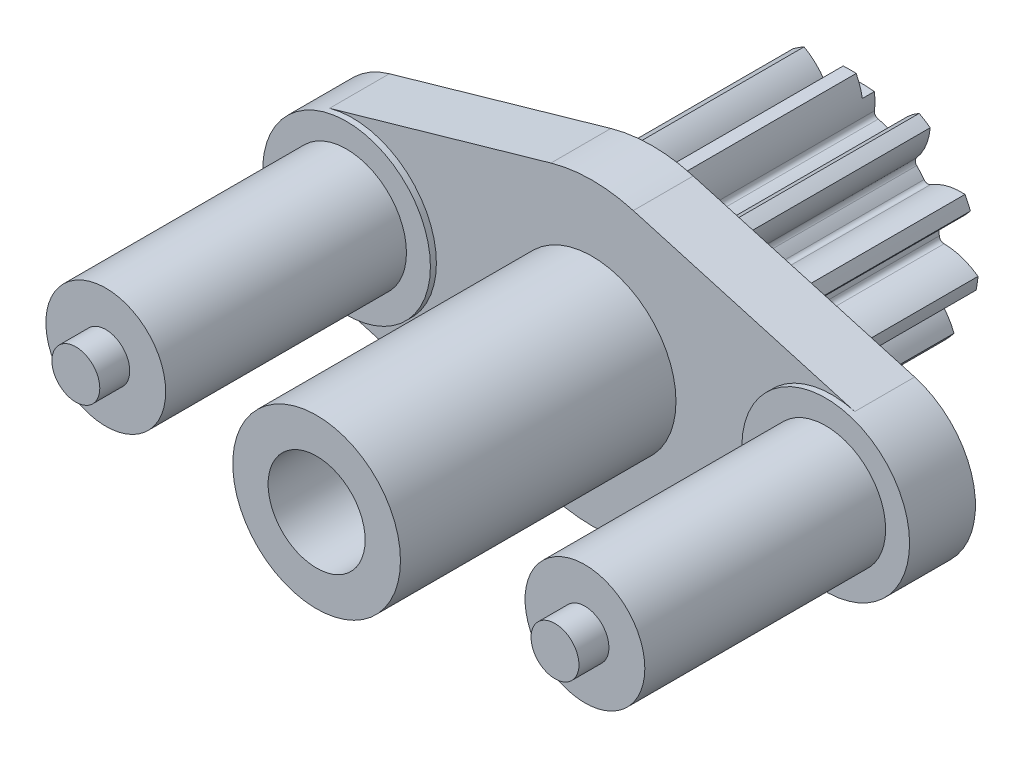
ISO-10303-21;
HEADER;
FILE_DESCRIPTION(('STEP AP214'),'2;1');
FILE_NAME('part.step','',(''),(''),'','','');
FILE_SCHEMA(('AUTOMOTIVE_DESIGN { 1 0 10303 214 1 1 1 1 }'));
ENDSEC;
DATA;
#1=APPLICATION_CONTEXT('core data for automotive mechanical design processes');
#2=APPLICATION_PROTOCOL_DEFINITION('international standard','automotive_design',2000,#1);
#3=PRODUCT_CONTEXT('',#1,'mechanical');
#4=PRODUCT('Part','Part','',(#3));
#5=PRODUCT_RELATED_PRODUCT_CATEGORY('part','',(#4));
#6=PRODUCT_DEFINITION_FORMATION('','',#4);
#7=PRODUCT_DEFINITION_CONTEXT('part definition',#1,'design');
#8=PRODUCT_DEFINITION('design','',#6,#7);
#9=PRODUCT_DEFINITION_SHAPE('','',#8);
#10=(LENGTH_UNIT() NAMED_UNIT(*) SI_UNIT(.MILLI.,.METRE.));
#11=(NAMED_UNIT(*) PLANE_ANGLE_UNIT() SI_UNIT($,.RADIAN.));
#12=(NAMED_UNIT(*) SI_UNIT($,.STERADIAN.) SOLID_ANGLE_UNIT());
#13=UNCERTAINTY_MEASURE_WITH_UNIT(LENGTH_MEASURE(1.E-05),#10,'distance_accuracy_value','');
#14=(GEOMETRIC_REPRESENTATION_CONTEXT(3) GLOBAL_UNCERTAINTY_ASSIGNED_CONTEXT((#13)) GLOBAL_UNIT_ASSIGNED_CONTEXT((#10,
#11,#12)) REPRESENTATION_CONTEXT('',''));
#15=CARTESIAN_POINT('',(0.,0.,0.));
#16=DIRECTION('',(0.,0.,1.));
#17=DIRECTION('',(1.,0.,0.));
#18=AXIS2_PLACEMENT_3D('',#15,#16,#17);
#19=CARTESIAN_POINT('',(0.,0.,17.5));
#20=DIRECTION('',(0.,0.,-1.));
#21=DIRECTION('',(-1.,0.,0.));
#22=AXIS2_PLACEMENT_3D('',#19,#20,#21);
#23=CYLINDRICAL_SURFACE('',#22,9.75);
#24=CARTESIAN_POINT('',(0.,0.,1.));
#25=DIRECTION('',(0.,0.,-1.));
#26=DIRECTION('',(-1.,0.,0.));
#27=AXIS2_PLACEMENT_3D('',#24,#25,#26);
#28=CIRCLE('',#27,9.75);
#29=CARTESIAN_POINT('',(-0.540679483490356,9.73499695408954,1.));
#30=VERTEX_POINT('',#29);
#31=CARTESIAN_POINT('',(0.541915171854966,9.734928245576,1.));
#32=VERTEX_POINT('',#31);
#33=EDGE_CURVE('E49',#30,#32,#28,.T.);
#34=ORIENTED_EDGE('',*,*,#33,.F.);
#35=DIRECTION('',(0.,0.,-1.));
#36=VECTOR('',#35,1.);
#37=CARTESIAN_POINT('',(-0.540679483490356,9.73499695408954,17.5));
#38=LINE('',#37,#36);
#39=CARTESIAN_POINT('',(-0.540679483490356,9.73499695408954,17.5));
#40=VERTEX_POINT('',#39);
#41=EDGE_CURVE('E978',#40,#30,#38,.T.);
#42=ORIENTED_EDGE('',*,*,#41,.F.);
#43=CARTESIAN_POINT('',(0.,0.,17.5));
#44=DIRECTION('',(0.,0.,1.));
#45=DIRECTION('',(1.,0.,0.));
#46=AXIS2_PLACEMENT_3D('',#43,#44,#45);
#47=CIRCLE('',#46,9.75);
#48=CARTESIAN_POINT('',(0.541915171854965,9.734928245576,17.5));
#49=VERTEX_POINT('',#48);
#50=EDGE_CURVE('E985',#49,#40,#47,.T.);
#51=ORIENTED_EDGE('',*,*,#50,.F.);
#52=DIRECTION('',(0.,0.,-1.));
#53=VECTOR('',#52,1.);
#54=CARTESIAN_POINT('',(0.541915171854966,9.734928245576,17.5));
#55=LINE('',#54,#53);
#56=EDGE_CURVE('E529',#49,#32,#55,.T.);
#57=ORIENTED_EDGE('',*,*,#56,.T.);
#58=EDGE_LOOP('',(#34,#42,#51,#57));
#59=FACE_BOUND('',#58,.T.);
#60=ADVANCED_FACE('F34',(#59),#23,.T.);
#61=CARTESIAN_POINT('',(0.,0.,22.5));
#62=DIRECTION('',(0.,0.,1.));
#63=DIRECTION('',(1.,0.,0.));
#64=AXIS2_PLACEMENT_3D('',#61,#62,#63);
#65=PLANE('',#64);
#66=DIRECTION('',(-0.961444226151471,-0.275,0.));
#67=VECTOR('',#66,1.);
#68=CARTESIAN_POINT('',(-21.925,6.73010958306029,22.5));
#69=LINE('',#68,#67);
#70=CARTESIAN_POINT('',(-3.4375,12.0180528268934,22.5));
#71=VERTEX_POINT('',#70);
#72=CARTESIAN_POINT('',(-21.925,6.73010958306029,22.5));
#73=VERTEX_POINT('',#72);
#74=EDGE_CURVE('E1026',#71,#73,#69,.T.);
#75=ORIENTED_EDGE('',*,*,#74,.T.);
#76=CARTESIAN_POINT('',(-20.,0.,22.5));
#77=DIRECTION('',(0.,0.,1.));
#78=DIRECTION('',(1.,0.,0.));
#79=AXIS2_PLACEMENT_3D('',#76,#77,#78);
#80=CIRCLE('',#79,7.);
#81=CARTESIAN_POINT('',(-21.925,-6.73010958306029,22.5));
#82=VERTEX_POINT('',#81);
#83=EDGE_CURVE('E989',#73,#82,#80,.F.);
#84=ORIENTED_EDGE('',*,*,#83,.T.);
#85=DIRECTION('',(0.961444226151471,-0.275,0.));
#86=VECTOR('',#85,1.);
#87=CARTESIAN_POINT('',(-21.925,-6.73010958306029,22.5));
#88=LINE('',#87,#86);
#89=CARTESIAN_POINT('',(-3.4375,-12.0180528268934,22.5));
#90=VERTEX_POINT('',#89);
#91=EDGE_CURVE('E1029',#82,#90,#88,.T.);
#92=ORIENTED_EDGE('',*,*,#91,.T.);
#93=CARTESIAN_POINT('',(0.,0.,22.5));
#94=DIRECTION('',(0.,0.,1.));
#95=DIRECTION('',(1.,0.,0.));
#96=AXIS2_PLACEMENT_3D('',#93,#94,#95);
#97=CIRCLE('',#96,12.5);
#98=CARTESIAN_POINT('',(3.43750000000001,-12.0180528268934,22.5));
#99=VERTEX_POINT('',#98);
#100=EDGE_CURVE('E1020',#90,#99,#97,.T.);
#101=ORIENTED_EDGE('',*,*,#100,.T.);
#102=DIRECTION('',(0.961444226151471,0.275,0.));
#103=VECTOR('',#102,1.);
#104=CARTESIAN_POINT('',(3.43750000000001,-12.0180528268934,22.5));
#105=LINE('',#104,#103);
#106=CARTESIAN_POINT('',(21.9249999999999,-6.73010958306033,22.5));
#107=VERTEX_POINT('',#106);
#108=EDGE_CURVE('E1023',#99,#107,#105,.T.);
#109=ORIENTED_EDGE('',*,*,#108,.T.);
#110=CARTESIAN_POINT('',(20.,0.,22.5));
#111=DIRECTION('',(0.,0.,1.));
#112=DIRECTION('',(1.,0.,0.));
#113=AXIS2_PLACEMENT_3D('',#110,#111,#112);
#114=CIRCLE('',#113,7.);
#115=CARTESIAN_POINT('',(21.925,6.73010958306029,22.5));
#116=VERTEX_POINT('',#115);
#117=EDGE_CURVE('E996',#116,#107,#114,.T.);
#118=ORIENTED_EDGE('',*,*,#117,.F.);
#119=DIRECTION('',(-0.961444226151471,0.275,0.));
#120=VECTOR('',#119,1.);
#121=CARTESIAN_POINT('',(3.4375,12.0180528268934,22.5));
#122=LINE('',#121,#120);
#123=CARTESIAN_POINT('',(3.4375,12.0180528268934,22.5));
#124=VERTEX_POINT('',#123);
#125=EDGE_CURVE('E993',#116,#124,#122,.T.);
#126=ORIENTED_EDGE('',*,*,#125,.T.);
#127=CARTESIAN_POINT('',(0.,0.,22.5));
#128=DIRECTION('',(0.,0.,1.));
#129=DIRECTION('',(1.,0.,0.));
#130=AXIS2_PLACEMENT_3D('',#127,#128,#129);
#131=CIRCLE('',#130,12.5);
#132=EDGE_CURVE('E1024',#124,#71,#131,.T.);
#133=ORIENTED_EDGE('',*,*,#132,.T.);
#134=EDGE_LOOP('',(#75,#84,#92,#101,#109,#118,#126,#133));
#135=FACE_BOUND('',#134,.T.);
#136=CARTESIAN_POINT('',(0.,0.,22.5));
#137=DIRECTION('',(0.,0.,1.));
#138=DIRECTION('',(1.,0.,0.));
#139=AXIS2_PLACEMENT_3D('',#136,#137,#138);
#140=CIRCLE('',#139,7.);
#141=CARTESIAN_POINT('',(7.,0.,22.5));
#142=VERTEX_POINT('',#141);
#143=EDGE_CURVE('E1186',#142,#142,#140,.T.);
#144=ORIENTED_EDGE('',*,*,#143,.F.);
#145=EDGE_LOOP('',(#144));
#146=FACE_BOUND('',#145,.T.);
#147=ADVANCED_FACE('F1260',(#135,#146),#65,.T.);
#148=CARTESIAN_POINT('',(-20.,0.,43.1));
#149=DIRECTION('',(0.,0.,1.));
#150=DIRECTION('',(1.,0.,0.));
#151=AXIS2_PLACEMENT_3D('',#148,#149,#150);
#152=PLANE('',#151);
#153=CARTESIAN_POINT('',(-20.,0.,43.1));
#154=DIRECTION('',(0.,0.,1.));
#155=DIRECTION('',(1.,0.,0.));
#156=AXIS2_PLACEMENT_3D('',#153,#154,#155);
#157=CIRCLE('',#156,5.);
#158=CARTESIAN_POINT('',(-15.,0.,43.1));
#159=VERTEX_POINT('',#158);
#160=EDGE_CURVE('E1230',#159,#159,#157,.T.);
#161=ORIENTED_EDGE('',*,*,#160,.T.);
#162=EDGE_LOOP('',(#161));
#163=FACE_BOUND('',#162,.T.);
#164=CARTESIAN_POINT('',(-20.,0.,43.1));
#165=DIRECTION('',(0.,0.,1.));
#166=DIRECTION('',(1.,0.,0.));
#167=AXIS2_PLACEMENT_3D('',#164,#165,#166);
#168=CIRCLE('',#167,2.);
#169=CARTESIAN_POINT('',(-18.,0.,43.1));
#170=VERTEX_POINT('',#169);
#171=EDGE_CURVE('E1215',#170,#170,#168,.T.);
#172=ORIENTED_EDGE('',*,*,#171,.F.);
#173=EDGE_LOOP('',(#172));
#174=FACE_BOUND('',#173,.T.);
#175=ADVANCED_FACE('F1264',(#163,#174),#152,.T.);
#176=CARTESIAN_POINT('',(20.,0.,43.1));
#177=DIRECTION('',(0.,0.,1.));
#178=DIRECTION('',(1.,0.,0.));
#179=AXIS2_PLACEMENT_3D('',#176,#177,#178);
#180=PLANE('',#179);
#181=CARTESIAN_POINT('',(20.,0.,43.1));
#182=DIRECTION('',(0.,0.,1.));
#183=DIRECTION('',(1.,0.,0.));
#184=AXIS2_PLACEMENT_3D('',#181,#182,#183);
#185=CIRCLE('',#184,5.);
#186=CARTESIAN_POINT('',(25.,0.,43.1));
#187=VERTEX_POINT('',#186);
#188=EDGE_CURVE('E1236',#187,#187,#185,.T.);
#189=ORIENTED_EDGE('',*,*,#188,.T.);
#190=EDGE_LOOP('',(#189));
#191=FACE_BOUND('',#190,.T.);
#192=CARTESIAN_POINT('',(20.,0.,43.1));
#193=DIRECTION('',(0.,0.,1.));
#194=DIRECTION('',(1.,0.,0.));
#195=AXIS2_PLACEMENT_3D('',#192,#193,#194);
#196=CIRCLE('',#195,2.);
#197=CARTESIAN_POINT('',(22.,0.,43.1));
#198=VERTEX_POINT('',#197);
#199=EDGE_CURVE('E1221',#198,#198,#196,.T.);
#200=ORIENTED_EDGE('',*,*,#199,.F.);
#201=EDGE_LOOP('',(#200));
#202=FACE_BOUND('',#201,.T.);
#203=ADVANCED_FACE('F1400',(#191,#202),#180,.T.);
#204=CARTESIAN_POINT('',(-20.,0.,23.));
#205=DIRECTION('',(0.,0.,1.));
#206=DIRECTION('',(1.,0.,0.));
#207=AXIS2_PLACEMENT_3D('',#204,#205,#206);
#208=PLANE('',#207);
#209=CARTESIAN_POINT('',(-20.,0.,23.));
#210=DIRECTION('',(0.,0.,1.));
#211=DIRECTION('',(1.,0.,0.));
#212=AXIS2_PLACEMENT_3D('',#209,#210,#211);
#213=CIRCLE('',#212,7.);
#214=CARTESIAN_POINT('',(-13.,0.,23.));
#215=VERTEX_POINT('',#214);
#216=EDGE_CURVE('E1001',#215,#215,#213,.T.);
#217=ORIENTED_EDGE('',*,*,#216,.T.);
#218=EDGE_LOOP('',(#217));
#219=FACE_BOUND('',#218,.T.);
#220=CARTESIAN_POINT('',(-20.,0.,23.));
#221=DIRECTION('',(0.,0.,1.));
#222=DIRECTION('',(1.,0.,0.));
#223=AXIS2_PLACEMENT_3D('',#220,#221,#222);
#224=CIRCLE('',#223,5.);
#225=CARTESIAN_POINT('',(-15.,0.,23.));
#226=VERTEX_POINT('',#225);
#227=EDGE_CURVE('E1227',#226,#226,#224,.T.);
#228=ORIENTED_EDGE('',*,*,#227,.F.);
#229=EDGE_LOOP('',(#228));
#230=FACE_BOUND('',#229,.T.);
#231=ADVANCED_FACE('F1241',(#219,#230),#208,.T.);
#232=CARTESIAN_POINT('',(20.,0.,23.));
#233=DIRECTION('',(0.,0.,1.));
#234=DIRECTION('',(1.,0.,0.));
#235=AXIS2_PLACEMENT_3D('',#232,#233,#234);
#236=PLANE('',#235);
#237=CARTESIAN_POINT('',(20.,0.,23.));
#238=DIRECTION('',(0.,0.,1.));
#239=DIRECTION('',(1.,0.,0.));
#240=AXIS2_PLACEMENT_3D('',#237,#238,#239);
#241=CIRCLE('',#240,7.);
#242=CARTESIAN_POINT('',(27.,0.,23.));
#243=VERTEX_POINT('',#242);
#244=EDGE_CURVE('E1000',#243,#243,#241,.T.);
#245=ORIENTED_EDGE('',*,*,#244,.T.);
#246=EDGE_LOOP('',(#245));
#247=FACE_BOUND('',#246,.T.);
#248=CARTESIAN_POINT('',(20.,0.,23.));
#249=DIRECTION('',(0.,0.,1.));
#250=DIRECTION('',(1.,0.,0.));
#251=AXIS2_PLACEMENT_3D('',#248,#249,#250);
#252=CIRCLE('',#251,5.);
#253=CARTESIAN_POINT('',(25.,0.,23.));
#254=VERTEX_POINT('',#253);
#255=EDGE_CURVE('E1233',#254,#254,#252,.T.);
#256=ORIENTED_EDGE('',*,*,#255,.F.);
#257=EDGE_LOOP('',(#256));
#258=FACE_BOUND('',#257,.T.);
#259=ADVANCED_FACE('F1268',(#247,#258),#236,.T.);
#260=DIRECTION('',(0.,0.,-1.));
#261=VECTOR('',#260,1.);
#262=CARTESIAN_POINT('',(4.80828818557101,8.48191397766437,17.5));
#263=LINE('',#262,#261);
#264=CARTESIAN_POINT('',(4.80828818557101,8.48191397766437,17.5));
#265=VERTEX_POINT('',#264);
#266=CARTESIAN_POINT('',(4.80828818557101,8.48191397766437,0.));
#267=VERTEX_POINT('',#266);
#268=EDGE_CURVE('E530',#265,#267,#263,.T.);
#269=ORIENTED_EDGE('',*,*,#268,.F.);
#270=CARTESIAN_POINT('',(5.71898761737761,7.89656131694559,17.5));
#271=VERTEX_POINT('',#270);
#272=EDGE_CURVE('E1088',#271,#265,#47,.T.);
#273=ORIENTED_EDGE('',*,*,#272,.F.);
#274=DIRECTION('',(0.,0.,-1.));
#275=VECTOR('',#274,1.);
#276=CARTESIAN_POINT('',(5.71898761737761,7.89656131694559,17.5));
#277=LINE('',#276,#275);
#278=CARTESIAN_POINT('',(5.71898761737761,7.89656131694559,0.));
#279=VERTEX_POINT('',#278);
#280=EDGE_CURVE('E582',#271,#279,#277,.T.);
#281=ORIENTED_EDGE('',*,*,#280,.T.);
#282=CARTESIAN_POINT('',(0.,0.,0.));
#283=DIRECTION('',(0.,0.,1.));
#284=DIRECTION('',(1.,0.,0.));
#285=AXIS2_PLACEMENT_3D('',#282,#283,#284);
#286=CIRCLE('',#285,9.75);
#287=EDGE_CURVE('E981',#279,#267,#286,.T.);
#288=ORIENTED_EDGE('',*,*,#287,.T.);
#289=EDGE_LOOP('',(#269,#273,#281,#288));
#290=FACE_BOUND('',#289,.T.);
#291=ADVANCED_FACE('F1087',(#290),#23,.T.);
#292=CARTESIAN_POINT('',(0.,0.,0.));
#293=DIRECTION('',(0.,0.,1.));
#294=DIRECTION('',(1.,0.,0.));
#295=AXIS2_PLACEMENT_3D('',#292,#293,#294);
#296=PLANE('',#295);
#297=CARTESIAN_POINT('',(0.,0.,0.));
#298=DIRECTION('',(0.,0.,1.));
#299=DIRECTION('',(1.,0.,0.));
#300=AXIS2_PLACEMENT_3D('',#297,#298,#299);
#301=CIRCLE('',#300,4.05);
#302=CARTESIAN_POINT('',(4.05,0.,0.));
#303=VERTEX_POINT('',#302);
#304=EDGE_CURVE('E1192',#303,#303,#301,.T.);
#305=ORIENTED_EDGE('',*,*,#304,.T.);
#306=EDGE_LOOP('',(#305));
#307=FACE_BOUND('',#306,.T.);
#308=CARTESIAN_POINT('',(3.74888667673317,7.44985635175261,0.));
#309=DIRECTION('',(0.,0.,-1.));
#310=DIRECTION('',(1.,0.,0.));
#311=AXIS2_PLACEMENT_3D('',#308,#309,#310);
#312=CIRCLE('',#311,4.86027215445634);
#313=CARTESIAN_POINT('',(-1.06730098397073,6.79672402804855,0.));
#314=VERTEX_POINT('',#313);
#315=CARTESIAN_POINT('',(-1.05590177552,8.18214956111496,0.));
#316=VERTEX_POINT('',#315);
#317=EDGE_CURVE('E522',#314,#316,#312,.T.);
#318=ORIENTED_EDGE('',*,*,#317,.T.);
#319=CARTESIAN_POINT('',(0.,0.,0.));
#320=DIRECTION('',(0.,0.,1.));
#321=DIRECTION('',(-1.,0.,0.));
#322=AXIS2_PLACEMENT_3D('',#319,#320,#321);
#323=CIRCLE('',#322,8.25);
#324=CARTESIAN_POINT('',(1.0569403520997,8.18201546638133,0.));
#325=VERTEX_POINT('',#324);
#326=EDGE_CURVE('E509',#325,#316,#323,.T.);
#327=ORIENTED_EDGE('',*,*,#326,.F.);
#328=CARTESIAN_POINT('',(-3.74794101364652,7.45033214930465,0.));
#329=DIRECTION('',(0.,0.,-1.));
#330=DIRECTION('',(-0.841253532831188,0.540640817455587,0.));
#331=AXIS2_PLACEMENT_3D('',#328,#329,#330);
#332=CIRCLE('',#331,4.86027215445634);
#333=CARTESIAN_POINT('',(1.06816370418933,6.79658849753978,0.));
#334=VERTEX_POINT('',#333);
#335=EDGE_CURVE('E519',#325,#334,#332,.T.);
#336=ORIENTED_EDGE('',*,*,#335,.T.);
#337=CARTESIAN_POINT('',(1.4645287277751,6.74278544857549,0.));
#338=DIRECTION('',(0.,0.,1.));
#339=DIRECTION('',(0.841253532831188,-0.540640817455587,0.));
#340=AXIS2_PLACEMENT_3D('',#337,#338,#339);
#341=CIRCLE('',#340,0.400000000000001);
#342=CARTESIAN_POINT('',(1.3796285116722,6.35189933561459,0.));
#343=VERTEX_POINT('',#342);
#344=EDGE_CURVE('E533',#334,#343,#341,.T.);
#345=ORIENTED_EDGE('',*,*,#344,.T.);
#346=CARTESIAN_POINT('',(0.,0.,0.));
#347=DIRECTION('',(0.,0.,-1.));
#348=DIRECTION('',(0.841253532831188,-0.540640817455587,0.));
#349=AXIS2_PLACEMENT_3D('',#346,#347,#348);
#350=CIRCLE('',#349,6.5);
#351=CARTESIAN_POINT('',(2.27425162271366,6.0891526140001,0.));
#352=VERTEX_POINT('',#351);
#353=EDGE_CURVE('E1051',#343,#352,#350,.T.);
#354=ORIENTED_EDGE('',*,*,#353,.T.);
#355=CARTESIAN_POINT('',(2.41420556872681,6.46386969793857,0.));
#356=DIRECTION('',(0.,0.,1.));
#357=DIRECTION('',(-0.841253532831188,0.540640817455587,0.));
#358=AXIS2_PLACEMENT_3D('',#355,#356,#357);
#359=CIRCLE('',#358,0.400000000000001);
#360=CARTESIAN_POINT('',(2.77671571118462,6.29479457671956,0.));
#361=VERTEX_POINT('',#360);
#362=EDGE_CURVE('E1054',#352,#361,#359,.T.);
#363=ORIENTED_EDGE('',*,*,#362,.T.);
#364=CARTESIAN_POINT('',(7.18146058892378,4.24041681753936,0.));
#365=DIRECTION('',(0.,0.,-1.));
#366=DIRECTION('',(0.841253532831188,-0.540640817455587,0.));
#367=AXIS2_PLACEMENT_3D('',#364,#365,#366);
#368=CIRCLE('',#367,4.86027215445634);
#369=EDGE_CURVE('E57',#361,#267,#368,.T.);
#370=ORIENTED_EDGE('',*,*,#369,.T.);
#371=ORIENTED_EDGE('',*,*,#287,.F.);
#372=CARTESIAN_POINT('',(0.874985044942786,8.29390813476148,0.));
#373=DIRECTION('',(0.,0.,-1.));
#374=DIRECTION('',(-0.415415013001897,0.909631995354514,0.));
#375=AXIS2_PLACEMENT_3D('',#372,#373,#374);
#376=CIRCLE('',#375,4.86027215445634);
#377=CARTESIAN_POINT('',(4.57310965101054,5.14016118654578,0.));
#378=VERTEX_POINT('',#377);
#379=EDGE_CURVE('E545',#279,#378,#376,.T.);
#380=ORIENTED_EDGE('',*,*,#379,.T.);
#381=CARTESIAN_POINT('',(4.87746500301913,4.88060807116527,0.));
#382=DIRECTION('',(0.,0.,1.));
#383=DIRECTION('',(0.415415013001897,-0.909631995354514,0.));
#384=AXIS2_PLACEMENT_3D('',#381,#382,#383);
#385=CIRCLE('',#384,0.400000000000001);
#386=CARTESIAN_POINT('',(4.59471340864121,4.5976742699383,0.));
#387=VERTEX_POINT('',#386);
#388=EDGE_CURVE('E549',#378,#387,#385,.T.);
#389=ORIENTED_EDGE('',*,*,#388,.T.);
#390=CARTESIAN_POINT('',(0.,0.,0.));
#391=DIRECTION('',(0.,0.,-1.));
#392=DIRECTION('',(0.415415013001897,-0.909631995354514,0.));
#393=AXIS2_PLACEMENT_3D('',#390,#391,#392);
#394=CIRCLE('',#393,6.5);
#395=CARTESIAN_POINT('',(5.20526665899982,3.89296789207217,0.));
#396=VERTEX_POINT('',#395);
#397=EDGE_CURVE('E552',#387,#396,#394,.T.);
#398=ORIENTED_EDGE('',*,*,#397,.T.);
#399=CARTESIAN_POINT('',(5.52559076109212,4.13253514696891,0.));
#400=DIRECTION('',(0.,0.,1.));
#401=DIRECTION('',(-0.415415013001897,0.909631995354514,0.));
#402=AXIS2_PLACEMENT_3D('',#399,#400,#401);
#403=CIRCLE('',#402,0.400000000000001);
#404=CARTESIAN_POINT('',(5.73914478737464,3.79431232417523,0.));
#405=VERTEX_POINT('',#404);
#406=EDGE_CURVE('E555',#396,#405,#403,.T.);
#407=ORIENTED_EDGE('',*,*,#406,.T.);
#408=CARTESIAN_POINT('',(8.33397150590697,-0.315325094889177,0.));
#409=DIRECTION('',(0.,0.,-1.));
#410=DIRECTION('',(0.415415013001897,-0.909631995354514,0.));
#411=AXIS2_PLACEMENT_3D('',#408,#409,#410);
#412=CIRCLE('',#411,4.86027215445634);
#413=CARTESIAN_POINT('',(8.63065832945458,4.53588324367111,0.));
#414=VERTEX_POINT('',#413);
#415=EDGE_CURVE('E542',#405,#414,#412,.T.);
#416=ORIENTED_EDGE('',*,*,#415,.T.);
#417=CARTESIAN_POINT('',(9.08032190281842,3.55109196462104,0.));
#418=VERTEX_POINT('',#417);
#419=EDGE_CURVE('E1091',#418,#414,#286,.T.);
#420=ORIENTED_EDGE('',*,*,#419,.F.);
#421=CARTESIAN_POINT('',(5.22010953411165,6.50422688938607,0.));
#422=DIRECTION('',(0.,0.,-1.));
#423=DIRECTION('',(0.142314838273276,0.989821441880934,0.));
#424=AXIS2_PLACEMENT_3D('',#421,#422,#423);
#425=CIRCLE('',#424,4.86027215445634);
#426=CARTESIAN_POINT('',(6.62612559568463,1.85176901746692,0.));
#427=VERTEX_POINT('',#426);
#428=EDGE_CURVE('E590',#418,#427,#425,.T.);
#429=ORIENTED_EDGE('',*,*,#428,.T.);
#430=CARTESIAN_POINT('',(6.74184060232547,1.46887211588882,0.));
#431=DIRECTION('',(0.,0.,1.));
#432=DIRECTION('',(-0.142314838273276,-0.989821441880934,0.));
#433=AXIS2_PLACEMENT_3D('',#430,#431,#432);
#434=CIRCLE('',#433,0.400000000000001);
#435=CARTESIAN_POINT('',(6.35100926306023,1.38372010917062,0.));
#436=VERTEX_POINT('',#435);
#437=EDGE_CURVE('E593',#427,#436,#434,.T.);
#438=ORIENTED_EDGE('',*,*,#437,.T.);
#439=CARTESIAN_POINT('',(0.,0.,0.));
#440=DIRECTION('',(0.,0.,-1.));
#441=DIRECTION('',(-0.142314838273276,-0.989821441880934,0.));
#442=AXIS2_PLACEMENT_3D('',#439,#440,#441);
#443=CIRCLE('',#442,6.5);
#444=CARTESIAN_POINT('',(6.48364630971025,0.460793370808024,0.));
#445=VERTEX_POINT('',#444);
#446=EDGE_CURVE('E596',#436,#445,#443,.T.);
#447=ORIENTED_EDGE('',*,*,#446,.T.);
#448=CARTESIAN_POINT('',(6.88263992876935,0.48914988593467,0.));
#449=DIRECTION('',(0.,0.,1.));
#450=DIRECTION('',(0.142314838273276,0.989821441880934,0.));
#451=AXIS2_PLACEMENT_3D('',#448,#449,#450);
#452=CIRCLE('',#451,0.400000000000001);
#453=CARTESIAN_POINT('',(6.87943594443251,0.0891627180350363,0.));
#454=VERTEX_POINT('',#453);
#455=EDGE_CURVE('E599',#445,#454,#452,.T.);
#456=ORIENTED_EDGE('',*,*,#455,.T.);
#457=CARTESIAN_POINT('',(6.84050535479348,-4.77095351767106,0.));
#458=DIRECTION('',(0.,0.,-1.));
#459=DIRECTION('',(-0.142314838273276,-0.989821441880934,0.));
#460=AXIS2_PLACEMENT_3D('',#457,#458,#459);
#461=CIRCLE('',#460,4.86027215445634);
#462=CARTESIAN_POINT('',(9.71285543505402,-0.85025837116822,0.));
#463=VERTEX_POINT('',#462);
#464=EDGE_CURVE('E587',#454,#463,#461,.T.);
#465=ORIENTED_EDGE('',*,*,#464,.T.);
#466=CARTESIAN_POINT('',(9.55871814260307,-1.92182399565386,0.));
#467=VERTEX_POINT('',#466);
#468=EDGE_CURVE('E1093',#467,#463,#286,.T.);
#469=ORIENTED_EDGE('',*,*,#468,.F.);
#470=CARTESIAN_POINT('',(7.90788612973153,2.6494995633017,0.));
#471=DIRECTION('',(0.,0.,-1.));
#472=DIRECTION('',(0.654860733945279,0.755749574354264,0.));
#473=AXIS2_PLACEMENT_3D('',#470,#471,#472);
#474=CIRCLE('',#473,4.86027215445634);
#475=CARTESIAN_POINT('',(6.57539348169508,-2.02454673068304,0.));
#476=VERTEX_POINT('',#475);
#477=EDGE_CURVE('E634',#467,#476,#474,.T.);
#478=ORIENTED_EDGE('',*,*,#477,.T.);
#479=CARTESIAN_POINT('',(6.46572944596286,-2.40922035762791,0.));
#480=DIRECTION('',(0.,0.,1.));
#481=DIRECTION('',(-0.654860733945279,-0.755749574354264,0.));
#482=AXIS2_PLACEMENT_3D('',#479,#480,#481);
#483=CIRCLE('',#482,0.400000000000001);
#484=CARTESIAN_POINT('',(6.09090455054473,-2.26955540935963,0.));
#485=VERTEX_POINT('',#484);
#486=EDGE_CURVE('E639',#476,#485,#483,.T.);
#487=ORIENTED_EDGE('',*,*,#486,.T.);
#488=CARTESIAN_POINT('',(0.,0.,0.));
#489=DIRECTION('',(0.,0.,-1.));
#490=DIRECTION('',(-0.654860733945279,-0.755749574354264,0.));
#491=AXIS2_PLACEMENT_3D('',#488,#489,#490);
#492=CIRCLE('',#491,6.5);
#493=CARTESIAN_POINT('',(5.70351406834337,-3.11767978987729,0.));
#494=VERTEX_POINT('',#493);
#495=EDGE_CURVE('E642',#485,#494,#492,.T.);
#496=ORIENTED_EDGE('',*,*,#495,.T.);
#497=CARTESIAN_POINT('',(6.05449954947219,-3.30953700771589,0.));
#498=DIRECTION('',(0.,0.,1.));
#499=DIRECTION('',(0.654860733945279,0.755749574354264,0.));
#500=AXIS2_PLACEMENT_3D('',#497,#498,#499);
#501=CIRCLE('',#500,0.400000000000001);
#502=CARTESIAN_POINT('',(5.83555479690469,-3.64429542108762,0.));
#503=VERTEX_POINT('',#502);
#504=EDGE_CURVE('E645',#494,#503,#501,.T.);
#505=ORIENTED_EDGE('',*,*,#504,.T.);
#506=CARTESIAN_POINT('',(3.17522708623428,-7.71183790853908,0.));
#507=DIRECTION('',(0.,0.,-1.));
#508=DIRECTION('',(-0.654860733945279,-0.755749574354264,0.));
#509=AXIS2_PLACEMENT_3D('',#506,#507,#508);
#510=CIRCLE('',#509,4.86027215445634);
#511=CARTESIAN_POINT('',(7.71128956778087,-5.96644896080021,0.));
#512=VERTEX_POINT('',#511);
#513=EDGE_CURVE('E631',#503,#512,#510,.T.);
#514=ORIENTED_EDGE('',*,*,#513,.T.);
#515=CARTESIAN_POINT('',(7.00228891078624,-6.78457441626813,0.));
#516=VERTEX_POINT('',#515);
#517=EDGE_CURVE('E1098',#516,#512,#286,.T.);
#518=ORIENTED_EDGE('',*,*,#517,.F.);
#519=CARTESIAN_POINT('',(8.08496475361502,-2.04642515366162,0.));
#520=DIRECTION('',(0.,0.,-1.));
#521=DIRECTION('',(0.959492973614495,0.281732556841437,0.));
#522=AXIS2_PLACEMENT_3D('',#519,#520,#521);
#523=CIRCLE('',#522,4.86027215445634);
#524=CARTESIAN_POINT('',(4.43702039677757,-5.25808319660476,0.));
#525=VERTEX_POINT('',#524);
#526=EDGE_CURVE('E678',#516,#525,#523,.T.);
#527=ORIENTED_EDGE('',*,*,#526,.T.);
#528=CARTESIAN_POINT('',(4.13679487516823,-5.52240239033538,0.));
#529=DIRECTION('',(0.,0.,1.));
#530=DIRECTION('',(-0.959492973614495,-0.281732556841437,0.));
#531=AXIS2_PLACEMENT_3D('',#528,#529,#530);
#532=CIRCLE('',#531,0.400000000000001);
#533=CARTESIAN_POINT('',(3.8969806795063,-5.20226312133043,0.));
#534=VERTEX_POINT('',#533);
#535=EDGE_CURVE('E681',#525,#534,#532,.T.);
#536=ORIENTED_EDGE('',*,*,#535,.T.);
#537=CARTESIAN_POINT('',(0.,0.,0.));
#538=DIRECTION('',(0.,0.,-1.));
#539=DIRECTION('',(-0.959492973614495,-0.281732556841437,0.));
#540=AXIS2_PLACEMENT_3D('',#537,#538,#539);
#541=CIRCLE('',#540,6.5);
#542=CARTESIAN_POINT('',(3.11255640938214,-5.70631164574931,0.));
#543=VERTEX_POINT('',#542);
#544=EDGE_CURVE('E684',#534,#543,#541,.T.);
#545=ORIENTED_EDGE('',*,*,#544,.T.);
#546=CARTESIAN_POINT('',(3.30409834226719,-6.05746928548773,0.));
#547=DIRECTION('',(0.,0.,1.));
#548=DIRECTION('',(0.959492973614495,0.281732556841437,0.));
#549=AXIS2_PLACEMENT_3D('',#546,#547,#548);
#550=CIRCLE('',#549,0.400000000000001);
#551=CARTESIAN_POINT('',(2.9389262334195,-6.22071551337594,0.));
#552=VERTEX_POINT('',#551);
#553=EDGE_CURVE('E687',#543,#552,#550,.T.);
#554=ORIENTED_EDGE('',*,*,#553,.T.);
#555=CARTESIAN_POINT('',(-1.4981633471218,-8.20426825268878,0.));
#556=DIRECTION('',(0.,0.,-1.));
#557=DIRECTION('',(-0.959492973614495,-0.281732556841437,0.));
#558=AXIS2_PLACEMENT_3D('',#555,#556,#557);
#559=CIRCLE('',#558,4.86027215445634);
#560=CARTESIAN_POINT('',(3.26144374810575,-9.18833416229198,0.));
#561=VERTEX_POINT('',#560);
#562=EDGE_CURVE('E654',#552,#561,#559,.T.);
#563=ORIENTED_EDGE('',*,*,#562,.T.);
#564=CARTESIAN_POINT('',(2.22268242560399,-9.49327039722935,0.));
#565=VERTEX_POINT('',#564);
#566=EDGE_CURVE('E1103',#565,#561,#286,.T.);
#567=ORIENTED_EDGE('',*,*,#566,.F.);
#568=CARTESIAN_POINT('',(5.6951241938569,-6.09262434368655,0.));
#569=DIRECTION('',(0.,0.,-1.));
#570=DIRECTION('',(0.959492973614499,-0.281732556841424,0.));
#571=AXIS2_PLACEMENT_3D('',#568,#569,#570);
#572=CIRCLE('',#571,4.86027215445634);
#573=CARTESIAN_POINT('',(0.88992468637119,-6.82221539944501,0.));
#574=VERTEX_POINT('',#573);
#575=EDGE_CURVE('E722',#565,#574,#572,.T.);
#576=ORIENTED_EDGE('',*,*,#575,.T.);
#577=CARTESIAN_POINT('',(0.494457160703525,-6.88226068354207,0.));
#578=DIRECTION('',(0.,0.,1.));
#579=DIRECTION('',(-0.959492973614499,0.281732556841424,0.));
#580=AXIS2_PLACEMENT_3D('',#577,#578,#579);
#581=CIRCLE('',#580,0.400000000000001);
#582=CARTESIAN_POINT('',(0.465792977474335,-6.48328904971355,0.));
#583=VERTEX_POINT('',#582);
#584=EDGE_CURVE('E725',#574,#583,#581,.T.);
#585=ORIENTED_EDGE('',*,*,#584,.T.);
#586=CARTESIAN_POINT('',(0.,0.,0.));
#587=DIRECTION('',(0.,0.,-1.));
#588=DIRECTION('',(-0.959492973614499,0.281732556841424,0.));
#589=AXIS2_PLACEMENT_3D('',#586,#587,#588);
#590=CIRCLE('',#589,6.5);
#591=CARTESIAN_POINT('',(-0.466615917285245,-6.48322987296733,0.));
#592=VERTEX_POINT('',#591);
#593=EDGE_CURVE('E728',#583,#592,#590,.T.);
#594=ORIENTED_EDGE('',*,*,#593,.T.);
#595=CARTESIAN_POINT('',(-0.495330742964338,-6.88219786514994,0.));
#596=DIRECTION('',(0.,0.,1.));
#597=DIRECTION('',(0.959492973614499,-0.281732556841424,0.));
#598=AXIS2_PLACEMENT_3D('',#595,#596,#597);
#599=CIRCLE('',#598,0.400000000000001);
#600=CARTESIAN_POINT('',(-0.890790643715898,-6.82210238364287,0.));
#601=VERTEX_POINT('',#600);
#602=EDGE_CURVE('E731',#592,#601,#599,.T.);
#603=ORIENTED_EDGE('',*,*,#602,.T.);
#604=CARTESIAN_POINT('',(-5.69589750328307,-6.09190139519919,0.));
#605=DIRECTION('',(0.,0.,-1.));
#606=DIRECTION('',(-0.959492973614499,0.281732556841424,0.));
#607=AXIS2_PLACEMENT_3D('',#604,#605,#606);
#608=CIRCLE('',#607,4.86027215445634);
#609=CARTESIAN_POINT('',(-2.2238874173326,-9.4929881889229,0.));
#610=VERTEX_POINT('',#609);
#611=EDGE_CURVE('E719',#601,#610,#608,.T.);
#612=ORIENTED_EDGE('',*,*,#611,.T.);
#613=CARTESIAN_POINT('',(-3.26261002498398,-9.18792010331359,0.));
#614=VERTEX_POINT('',#613);
#615=EDGE_CURVE('E1108',#614,#610,#286,.T.);
#616=ORIENTED_EDGE('',*,*,#615,.F.);
#617=CARTESIAN_POINT('',(1.49712194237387,-8.20445835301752,0.));
#618=DIRECTION('',(0.,0.,-1.));
#619=DIRECTION('',(0.654860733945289,-0.755749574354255,0.));
#620=AXIS2_PLACEMENT_3D('',#617,#618,#619);
#621=CIRCLE('',#620,4.86027215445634);
#622=CARTESIAN_POINT('',(-2.93971582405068,-6.22034241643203,0.));
#623=VERTEX_POINT('',#622);
#624=EDGE_CURVE('E766',#614,#623,#621,.T.);
#625=ORIENTED_EDGE('',*,*,#624,.T.);
#626=CARTESIAN_POINT('',(-3.3048672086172,-6.05704983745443,0.));
#627=DIRECTION('',(0.,0.,1.));
#628=DIRECTION('',(-0.654860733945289,0.755749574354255,0.));
#629=AXIS2_PLACEMENT_3D('',#626,#627,#628);
#630=CIRCLE('',#629,0.400000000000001);
#631=CARTESIAN_POINT('',(-3.11328070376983,-5.70591651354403,0.));
#632=VERTEX_POINT('',#631);
#633=EDGE_CURVE('E771',#623,#632,#630,.T.);
#634=ORIENTED_EDGE('',*,*,#633,.T.);
#635=CARTESIAN_POINT('',(0.,0.,0.));
#636=DIRECTION('',(0.,0.,-1.));
#637=DIRECTION('',(-0.654860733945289,0.755749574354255,0.));
#638=AXIS2_PLACEMENT_3D('',#635,#636,#637);
#639=CIRCLE('',#638,6.5);
#640=CARTESIAN_POINT('',(-3.89764098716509,-5.20176842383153,0.));
#641=VERTEX_POINT('',#640);
#642=EDGE_CURVE('E774',#632,#641,#639,.T.);
#643=ORIENTED_EDGE('',*,*,#642,.T.);
#644=CARTESIAN_POINT('',(-4.13749581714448,-5.52187724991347,0.));
#645=DIRECTION('',(0.,0.,1.));
#646=DIRECTION('',(0.654860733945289,-0.755749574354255,0.));
#647=AXIS2_PLACEMENT_3D('',#644,#645,#646);
#648=CIRCLE('',#647,0.400000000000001);
#649=CARTESIAN_POINT('',(-4.43768778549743,-5.25751994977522,0.));
#650=VERTEX_POINT('',#649);
#651=EDGE_CURVE('E777',#641,#650,#648,.T.);
#652=ORIENTED_EDGE('',*,*,#651,.T.);
#653=CARTESIAN_POINT('',(-8.08522444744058,-2.04539888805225,0.));
#654=DIRECTION('',(0.,0.,-1.));
#655=DIRECTION('',(-0.654860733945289,0.755749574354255,0.));
#656=AXIS2_PLACEMENT_3D('',#653,#654,#655);
#657=CIRCLE('',#656,4.86027215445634);
#658=CARTESIAN_POINT('',(-7.00315004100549,-6.78368553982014,0.));
#659=VERTEX_POINT('',#658);
#660=EDGE_CURVE('E763',#650,#659,#657,.T.);
#661=ORIENTED_EDGE('',*,*,#660,.T.);
#662=CARTESIAN_POINT('',(-7.71204684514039,-5.96547009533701,0.));
#663=VERTEX_POINT('',#662);
#664=EDGE_CURVE('E1113',#663,#659,#286,.T.);
#665=ORIENTED_EDGE('',*,*,#664,.F.);
#666=CARTESIAN_POINT('',(-3.17620594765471,-7.71143480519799,0.));
#667=DIRECTION('',(0.,0.,-1.));
#668=DIRECTION('',(0.142314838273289,-0.989821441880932,0.));
#669=AXIS2_PLACEMENT_3D('',#666,#667,#668);
#670=CIRCLE('',#669,4.86027215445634);
#671=CARTESIAN_POINT('',(-5.83601733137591,-3.64355466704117,0.));
#672=VERTEX_POINT('',#671);
#673=EDGE_CURVE('E810',#663,#672,#670,.T.);
#674=ORIENTED_EDGE('',*,*,#673,.T.);
#675=CARTESIAN_POINT('',(-6.05491959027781,-3.30876846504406,0.));
#676=DIRECTION('',(0.,0.,1.));
#677=DIRECTION('',(-0.142314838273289,0.989821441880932,0.));
#678=AXIS2_PLACEMENT_3D('',#675,#676,#677);
#679=CIRCLE('',#678,0.400000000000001);
#680=CARTESIAN_POINT('',(-5.70390975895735,-3.11695580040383,0.));
#681=VERTEX_POINT('',#680);
#682=EDGE_CURVE('E813',#672,#681,#679,.T.);
#683=ORIENTED_EDGE('',*,*,#682,.T.);
#684=CARTESIAN_POINT('',(0.,0.,0.));
#685=DIRECTION('',(0.,0.,-1.));
#686=DIRECTION('',(-0.142314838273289,0.989821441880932,0.));
#687=AXIS2_PLACEMENT_3D('',#684,#685,#686);
#688=CIRCLE('',#687,6.5);
#689=CARTESIAN_POINT('',(-6.09119258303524,-2.26878225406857,0.));
#690=VERTEX_POINT('',#689);
#691=EDGE_CURVE('E816',#681,#690,#688,.T.);
#692=ORIENTED_EDGE('',*,*,#691,.T.);
#693=CARTESIAN_POINT('',(-6.46603520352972,-2.40839962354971,0.));
#694=DIRECTION('',(0.,0.,1.));
#695=DIRECTION('',(0.142314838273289,-0.989821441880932,0.));
#696=AXIS2_PLACEMENT_3D('',#693,#694,#695);
#697=CIRCLE('',#696,0.400000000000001);
#698=CARTESIAN_POINT('',(-6.57565041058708,-2.02371207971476,0.));
#699=VERTEX_POINT('',#698);
#700=EDGE_CURVE('E819',#690,#699,#697,.T.);
#701=ORIENTED_EDGE('',*,*,#700,.T.);
#702=CARTESIAN_POINT('',(-7.90754975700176,2.65050331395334,0.));
#703=DIRECTION('',(0.,0.,-1.));
#704=DIRECTION('',(-0.142314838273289,0.989821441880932,0.));
#705=AXIS2_PLACEMENT_3D('',#702,#703,#704);
#706=CIRCLE('',#705,4.86027215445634);
#707=CARTESIAN_POINT('',(-9.55896200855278,-1.92061066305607,0.));
#708=VERTEX_POINT('',#707);
#709=EDGE_CURVE('E786',#699,#708,#706,.T.);
#710=ORIENTED_EDGE('',*,*,#709,.T.);
#711=CARTESIAN_POINT('',(-9.71296328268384,-0.84902548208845,0.));
#712=VERTEX_POINT('',#711);
#713=EDGE_CURVE('E1118',#712,#708,#286,.T.);
#714=ORIENTED_EDGE('',*,*,#713,.F.);
#715=CARTESIAN_POINT('',(-6.84111089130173,-4.77008519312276,0.));
#716=DIRECTION('',(0.,0.,-1.));
#717=DIRECTION('',(-0.415415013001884,-0.909631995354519,0.));
#718=AXIS2_PLACEMENT_3D('',#715,#716,#717);
#719=CIRCLE('',#718,4.86027215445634);
#720=CARTESIAN_POINT('',(-6.87942457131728,0.0900359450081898,0.));
#721=VERTEX_POINT('',#720);
#722=EDGE_CURVE('E854',#712,#721,#719,.T.);
#723=ORIENTED_EDGE('',*,*,#722,.T.);
#724=CARTESIAN_POINT('',(-6.88257778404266,0.49002351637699,0.));
#725=DIRECTION('',(0.,0.,1.));
#726=DIRECTION('',(0.415415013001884,0.909631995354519,0.));
#727=AXIS2_PLACEMENT_3D('',#724,#725,#726);
#728=CIRCLE('',#727,0.400000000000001);
#729=CARTESIAN_POINT('',(-6.48358776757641,0.46161635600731,0.));
#730=VERTEX_POINT('',#729);
#731=EDGE_CURVE('E857',#721,#730,#728,.T.);
#732=ORIENTED_EDGE('',*,*,#731,.T.);
#733=CARTESIAN_POINT('',(0.,0.,0.));
#734=DIRECTION('',(0.,0.,-1.));
#735=DIRECTION('',(0.415415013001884,0.909631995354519,0.));
#736=AXIS2_PLACEMENT_3D('',#733,#734,#735);
#737=CIRCLE('',#736,6.5);
#738=CARTESIAN_POINT('',(-6.35083357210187,1.38452625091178,0.));
#739=VERTEX_POINT('',#738);
#740=EDGE_CURVE('E860',#730,#739,#737,.T.);
#741=ORIENTED_EDGE('',*,*,#740,.T.);
#742=CARTESIAN_POINT('',(-6.74165409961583,1.4697278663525,0.));
#743=DIRECTION('',(0.,0.,1.));
#744=DIRECTION('',(-0.415415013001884,-0.909631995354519,0.));
#745=AXIS2_PLACEMENT_3D('',#742,#743,#744);
#746=CIRCLE('',#745,0.400000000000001);
#747=CARTESIAN_POINT('',(-6.62589049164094,1.85261007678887,0.));
#748=VERTEX_POINT('',#747);
#749=EDGE_CURVE('E863',#739,#748,#746,.T.);
#750=ORIENTED_EDGE('',*,*,#749,.T.);
#751=CARTESIAN_POINT('',(-5.21928389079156,6.50488944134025,0.));
#752=DIRECTION('',(0.,0.,-1.));
#753=DIRECTION('',(0.415415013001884,0.909631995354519,0.));
#754=AXIS2_PLACEMENT_3D('',#751,#752,#753);
#755=CIRCLE('',#754,4.86027215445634);
#756=CARTESIAN_POINT('',(-9.07987107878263,3.55224452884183,0.));
#757=VERTEX_POINT('',#756);
#758=EDGE_CURVE('E851',#748,#757,#755,.T.);
#759=ORIENTED_EDGE('',*,*,#758,.T.);
#760=CARTESIAN_POINT('',(-8.63008250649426,4.5369787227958,0.));
#761=VERTEX_POINT('',#760);
#762=EDGE_CURVE('E986',#761,#757,#286,.T.);
#763=ORIENTED_EDGE('',*,*,#762,.F.);
#764=CARTESIAN_POINT('',(-8.33401146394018,-0.31426723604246,0.));
#765=DIRECTION('',(0.,0.,-1.));
#766=DIRECTION('',(-0.841253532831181,-0.540640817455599,0.));
#767=AXIS2_PLACEMENT_3D('',#764,#765,#766);
#768=CIRCLE('',#767,4.86027215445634);
#769=CARTESIAN_POINT('',(-5.73866311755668,3.79504078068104,0.));
#770=VERTEX_POINT('',#769);
#771=EDGE_CURVE('E898',#761,#770,#768,.T.);
#772=ORIENTED_EDGE('',*,*,#771,.T.);
#773=CARTESIAN_POINT('',(-5.52506616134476,4.13323649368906,0.));
#774=DIRECTION('',(0.,0.,1.));
#775=DIRECTION('',(0.841253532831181,0.540640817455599,0.));
#776=AXIS2_PLACEMENT_3D('',#773,#774,#775);
#777=CIRCLE('',#776,0.400000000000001);
#778=CARTESIAN_POINT('',(-5.20477247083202,3.89362858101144,0.));
#779=VERTEX_POINT('',#778);
#780=EDGE_CURVE('E901',#770,#779,#777,.T.);
#781=ORIENTED_EDGE('',*,*,#780,.T.);
#782=CARTESIAN_POINT('',(0.,0.,0.));
#783=DIRECTION('',(0.,0.,-1.));
#784=DIRECTION('',(0.841253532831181,0.540640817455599,0.));
#785=AXIS2_PLACEMENT_3D('',#782,#783,#784);
#786=CIRCLE('',#785,6.5);
#787=CARTESIAN_POINT('',(-4.59412977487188,4.59825745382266,0.));
#788=VERTEX_POINT('',#787);
#789=EDGE_CURVE('E904',#779,#788,#786,.T.);
#790=ORIENTED_EDGE('',*,*,#789,.T.);
#791=CARTESIAN_POINT('',(-4.87684545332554,4.88122714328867,0.));
#792=DIRECTION('',(0.,0.,1.));
#793=DIRECTION('',(-0.841253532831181,-0.540640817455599,0.));
#794=AXIS2_PLACEMENT_3D('',#791,#792,#793);
#795=CIRCLE('',#794,0.400000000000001);
#796=CARTESIAN_POINT('',(-4.57245715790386,5.14074162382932,0.));
#797=VERTEX_POINT('',#796);
#798=EDGE_CURVE('E907',#788,#797,#795,.T.);
#799=ORIENTED_EDGE('',*,*,#798,.T.);
#800=CARTESIAN_POINT('',(-0.873932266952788,8.29401913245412,0.));
#801=DIRECTION('',(0.,0.,-1.));
#802=DIRECTION('',(0.841253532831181,0.540640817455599,0.));
#803=AXIS2_PLACEMENT_3D('',#800,#801,#802);
#804=CIRCLE('',#803,4.86027215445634);
#805=CARTESIAN_POINT('',(-5.71798523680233,7.89728718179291,0.));
#806=VERTEX_POINT('',#805);
#807=EDGE_CURVE('E895',#797,#806,#804,.T.);
#808=ORIENTED_EDGE('',*,*,#807,.T.);
#809=CARTESIAN_POINT('',(-4.80721151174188,8.48252423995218,0.));
#810=VERTEX_POINT('',#809);
#811=EDGE_CURVE('E982',#810,#806,#286,.T.);
#812=ORIENTED_EDGE('',*,*,#811,.F.);
#813=CARTESIAN_POINT('',(-7.18092228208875,4.24132834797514,0.));
#814=DIRECTION('',(0.,0.,-1.));
#815=DIRECTION('',(-1.,0.,0.));
#816=AXIS2_PLACEMENT_3D('',#813,#814,#815);
#817=CIRCLE('',#816,4.86027215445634);
#818=CARTESIAN_POINT('',(-2.77591667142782,6.29514698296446,0.));
#819=VERTEX_POINT('',#818);
#820=EDGE_CURVE('E940',#810,#819,#817,.T.);
#821=ORIENTED_EDGE('',*,*,#820,.T.);
#822=CARTESIAN_POINT('',(-2.41338507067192,6.46417608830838,0.));
#823=DIRECTION('',(0.,0.,1.));
#824=DIRECTION('',(1.,0.,0.));
#825=AXIS2_PLACEMENT_3D('',#822,#823,#824);
#826=CIRCLE('',#825,0.400000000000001);
#827=CARTESIAN_POINT('',(-2.2734786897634,6.08944124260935,0.));
#828=VERTEX_POINT('',#827);
#829=EDGE_CURVE('E943',#819,#828,#826,.T.);
#830=ORIENTED_EDGE('',*,*,#829,.T.);
#831=CARTESIAN_POINT('',(0.,0.,0.));
#832=DIRECTION('',(0.,0.,-1.));
#833=DIRECTION('',(1.,0.,0.));
#834=AXIS2_PLACEMENT_3D('',#831,#832,#833);
#835=CIRCLE('',#834,6.5);
#836=CARTESIAN_POINT('',(-1.37882223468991,6.35207440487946,0.));
#837=VERTEX_POINT('',#836);
#838=EDGE_CURVE('E946',#828,#837,#835,.T.);
#839=ORIENTED_EDGE('',*,*,#838,.T.);
#840=CARTESIAN_POINT('',(-1.46367283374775,6.74297129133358,0.));
#841=DIRECTION('',(0.,0.,1.));
#842=DIRECTION('',(-1.,0.,0.));
#843=AXIS2_PLACEMENT_3D('',#840,#841,#842);
#844=CIRCLE('',#843,0.400000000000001);
#845=EDGE_CURVE('E949',#837,#314,#844,.T.);
#846=ORIENTED_EDGE('',*,*,#845,.T.);
#847=EDGE_LOOP('',(#318,#327,#336,#345,#354,#363,#370,#371,#380,#389,#398,#407,#416,#420,#429,
#438,#447,#456,#465,#469,#478,#487,#496,#505,#514,#518,#527,#536,#545,#554,#563,#567,#576,#585,
#594,#603,#612,#616,#625,#634,#643,#652,#661,#665,#674,#683,#692,#701,#710,#714,#723,#732,#741,
#750,#759,#763,#772,#781,#790,#799,#808,#812,#821,#830,#839,#846));
#848=FACE_BOUND('',#847,.T.);
#849=ADVANCED_FACE('F517',(#307,#848),#296,.F.);
#850=DIRECTION('',(0.,0.,-1.));
#851=VECTOR('',#850,1.);
#852=CARTESIAN_POINT('',(8.63065832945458,4.53588324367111,17.5));
#853=LINE('',#852,#851);
#854=CARTESIAN_POINT('',(8.63065832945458,4.53588324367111,17.5));
#855=VERTEX_POINT('',#854);
#856=EDGE_CURVE('E585',#855,#414,#853,.T.);
#857=ORIENTED_EDGE('',*,*,#856,.F.);
#858=CARTESIAN_POINT('',(9.08032190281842,3.55109196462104,17.5));
#859=VERTEX_POINT('',#858);
#860=EDGE_CURVE('E1165',#859,#855,#47,.T.);
#861=ORIENTED_EDGE('',*,*,#860,.F.);
#862=DIRECTION('',(0.,0.,-1.));
#863=VECTOR('',#862,1.);
#864=CARTESIAN_POINT('',(9.08032190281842,3.55109196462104,17.5));
#865=LINE('',#864,#863);
#866=EDGE_CURVE('E626',#859,#418,#865,.T.);
#867=ORIENTED_EDGE('',*,*,#866,.T.);
#868=ORIENTED_EDGE('',*,*,#419,.T.);
#869=EDGE_LOOP('',(#857,#861,#867,#868));
#870=FACE_BOUND('',#869,.T.);
#871=ADVANCED_FACE('F1269',(#870),#23,.T.);
#872=DIRECTION('',(0.,0.,-1.));
#873=VECTOR('',#872,1.);
#874=CARTESIAN_POINT('',(9.71285543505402,-0.85025837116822,17.5));
#875=LINE('',#874,#873);
#876=CARTESIAN_POINT('',(9.71285543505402,-0.85025837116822,17.5));
#877=VERTEX_POINT('',#876);
#878=EDGE_CURVE('E629',#877,#463,#875,.T.);
#879=ORIENTED_EDGE('',*,*,#878,.F.);
#880=CARTESIAN_POINT('',(9.55871814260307,-1.92182399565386,17.5));
#881=VERTEX_POINT('',#880);
#882=EDGE_CURVE('E1163',#881,#877,#47,.T.);
#883=ORIENTED_EDGE('',*,*,#882,.F.);
#884=DIRECTION('',(0.,0.,-1.));
#885=VECTOR('',#884,1.);
#886=CARTESIAN_POINT('',(9.55871814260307,-1.92182399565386,17.5));
#887=LINE('',#886,#885);
#888=EDGE_CURVE('E636',#881,#467,#887,.T.);
#889=ORIENTED_EDGE('',*,*,#888,.T.);
#890=ORIENTED_EDGE('',*,*,#468,.T.);
#891=EDGE_LOOP('',(#879,#883,#889,#890));
#892=FACE_BOUND('',#891,.T.);
#893=ADVANCED_FACE('F1327',(#892),#23,.T.);
#894=DIRECTION('',(0.,0.,-1.));
#895=VECTOR('',#894,1.);
#896=CARTESIAN_POINT('',(7.71128956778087,-5.96644896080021,17.5));
#897=LINE('',#896,#895);
#898=CARTESIAN_POINT('',(7.71128956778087,-5.96644896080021,17.5));
#899=VERTEX_POINT('',#898);
#900=EDGE_CURVE('E632',#899,#512,#897,.T.);
#901=ORIENTED_EDGE('',*,*,#900,.F.);
#902=CARTESIAN_POINT('',(7.00228891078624,-6.78457441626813,17.5));
#903=VERTEX_POINT('',#902);
#904=EDGE_CURVE('E1161',#903,#899,#47,.T.);
#905=ORIENTED_EDGE('',*,*,#904,.F.);
#906=DIRECTION('',(0.,0.,-1.));
#907=VECTOR('',#906,1.);
#908=CARTESIAN_POINT('',(7.00228891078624,-6.78457441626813,17.5));
#909=LINE('',#908,#907);
#910=EDGE_CURVE('E714',#903,#516,#909,.T.);
#911=ORIENTED_EDGE('',*,*,#910,.T.);
#912=ORIENTED_EDGE('',*,*,#517,.T.);
#913=EDGE_LOOP('',(#901,#905,#911,#912));
#914=FACE_BOUND('',#913,.T.);
#915=ADVANCED_FACE('F1517',(#914),#23,.T.);
#916=DIRECTION('',(0.,0.,-1.));
#917=VECTOR('',#916,1.);
#918=CARTESIAN_POINT('',(3.26144374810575,-9.18833416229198,17.5));
#919=LINE('',#918,#917);
#920=CARTESIAN_POINT('',(3.26144374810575,-9.18833416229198,17.5));
#921=VERTEX_POINT('',#920);
#922=EDGE_CURVE('E717',#921,#561,#919,.T.);
#923=ORIENTED_EDGE('',*,*,#922,.F.);
#924=CARTESIAN_POINT('',(2.22268242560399,-9.49327039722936,17.5));
#925=VERTEX_POINT('',#924);
#926=EDGE_CURVE('E1159',#925,#921,#47,.T.);
#927=ORIENTED_EDGE('',*,*,#926,.F.);
#928=DIRECTION('',(0.,0.,-1.));
#929=VECTOR('',#928,1.);
#930=CARTESIAN_POINT('',(2.22268242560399,-9.49327039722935,17.5));
#931=LINE('',#930,#929);
#932=EDGE_CURVE('E758',#925,#565,#931,.T.);
#933=ORIENTED_EDGE('',*,*,#932,.T.);
#934=ORIENTED_EDGE('',*,*,#566,.T.);
#935=EDGE_LOOP('',(#923,#927,#933,#934));
#936=FACE_BOUND('',#935,.T.);
#937=ADVANCED_FACE('F1525',(#936),#23,.T.);
#938=DIRECTION('',(0.,0.,-1.));
#939=VECTOR('',#938,1.);
#940=CARTESIAN_POINT('',(-2.2238874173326,-9.4929881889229,17.5));
#941=LINE('',#940,#939);
#942=CARTESIAN_POINT('',(-2.2238874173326,-9.4929881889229,17.5));
#943=VERTEX_POINT('',#942);
#944=EDGE_CURVE('E761',#943,#610,#941,.T.);
#945=ORIENTED_EDGE('',*,*,#944,.F.);
#946=CARTESIAN_POINT('',(-3.26261002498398,-9.18792010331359,17.5));
#947=VERTEX_POINT('',#946);
#948=EDGE_CURVE('E1157',#947,#943,#47,.T.);
#949=ORIENTED_EDGE('',*,*,#948,.F.);
#950=DIRECTION('',(0.,0.,-1.));
#951=VECTOR('',#950,1.);
#952=CARTESIAN_POINT('',(-3.26261002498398,-9.18792010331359,17.5));
#953=LINE('',#952,#951);
#954=EDGE_CURVE('E768',#947,#614,#953,.T.);
#955=ORIENTED_EDGE('',*,*,#954,.T.);
#956=ORIENTED_EDGE('',*,*,#615,.T.);
#957=EDGE_LOOP('',(#945,#949,#955,#956));
#958=FACE_BOUND('',#957,.T.);
#959=ADVANCED_FACE('F1533',(#958),#23,.T.);
#960=DIRECTION('',(0.,0.,-1.));
#961=VECTOR('',#960,1.);
#962=CARTESIAN_POINT('',(-7.00315004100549,-6.78368553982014,17.5));
#963=LINE('',#962,#961);
#964=CARTESIAN_POINT('',(-7.00315004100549,-6.78368553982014,17.5));
#965=VERTEX_POINT('',#964);
#966=EDGE_CURVE('E764',#965,#659,#963,.T.);
#967=ORIENTED_EDGE('',*,*,#966,.F.);
#968=CARTESIAN_POINT('',(-7.71204684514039,-5.96547009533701,17.5));
#969=VERTEX_POINT('',#968);
#970=EDGE_CURVE('E1156',#969,#965,#47,.T.);
#971=ORIENTED_EDGE('',*,*,#970,.F.);
#972=DIRECTION('',(0.,0.,-1.));
#973=VECTOR('',#972,1.);
#974=CARTESIAN_POINT('',(-7.71204684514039,-5.96547009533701,17.5));
#975=LINE('',#974,#973);
#976=EDGE_CURVE('E846',#969,#663,#975,.T.);
#977=ORIENTED_EDGE('',*,*,#976,.T.);
#978=ORIENTED_EDGE('',*,*,#664,.T.);
#979=EDGE_LOOP('',(#967,#971,#977,#978));
#980=FACE_BOUND('',#979,.T.);
#981=ADVANCED_FACE('F1541',(#980),#23,.T.);
#982=DIRECTION('',(0.,0.,-1.));
#983=VECTOR('',#982,1.);
#984=CARTESIAN_POINT('',(-9.55896200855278,-1.92061066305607,17.5));
#985=LINE('',#984,#983);
#986=CARTESIAN_POINT('',(-9.55896200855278,-1.92061066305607,17.5));
#987=VERTEX_POINT('',#986);
#988=EDGE_CURVE('E849',#987,#708,#985,.T.);
#989=ORIENTED_EDGE('',*,*,#988,.F.);
#990=CARTESIAN_POINT('',(-9.71296328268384,-0.84902548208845,17.5));
#991=VERTEX_POINT('',#990);
#992=EDGE_CURVE('E1154',#991,#987,#47,.T.);
#993=ORIENTED_EDGE('',*,*,#992,.F.);
#994=DIRECTION('',(0.,0.,-1.));
#995=VECTOR('',#994,1.);
#996=CARTESIAN_POINT('',(-9.71296328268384,-0.84902548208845,17.5));
#997=LINE('',#996,#995);
#998=EDGE_CURVE('E890',#991,#712,#997,.T.);
#999=ORIENTED_EDGE('',*,*,#998,.T.);
#1000=ORIENTED_EDGE('',*,*,#713,.T.);
#1001=EDGE_LOOP('',(#989,#993,#999,#1000));
#1002=FACE_BOUND('',#1001,.T.);
#1003=ADVANCED_FACE('F1155',(#1002),#23,.T.);
#1004=DIRECTION('',(0.,0.,-1.));
#1005=VECTOR('',#1004,1.);
#1006=CARTESIAN_POINT('',(-9.07987107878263,3.55224452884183,17.5));
#1007=LINE('',#1006,#1005);
#1008=CARTESIAN_POINT('',(-9.07987107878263,3.55224452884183,17.5));
#1009=VERTEX_POINT('',#1008);
#1010=EDGE_CURVE('E893',#1009,#757,#1007,.T.);
#1011=ORIENTED_EDGE('',*,*,#1010,.F.);
#1012=CARTESIAN_POINT('',(-8.63008250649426,4.5369787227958,17.5));
#1013=VERTEX_POINT('',#1012);
#1014=EDGE_CURVE('E990',#1013,#1009,#47,.T.);
#1015=ORIENTED_EDGE('',*,*,#1014,.F.);
#1016=DIRECTION('',(0.,0.,-1.));
#1017=VECTOR('',#1016,1.);
#1018=CARTESIAN_POINT('',(-8.63008250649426,4.5369787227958,17.5));
#1019=LINE('',#1018,#1017);
#1020=EDGE_CURVE('E934',#1013,#761,#1019,.T.);
#1021=ORIENTED_EDGE('',*,*,#1020,.T.);
#1022=ORIENTED_EDGE('',*,*,#762,.T.);
#1023=EDGE_LOOP('',(#1011,#1015,#1021,#1022));
#1024=FACE_BOUND('',#1023,.T.);
#1025=ADVANCED_FACE('F1130',(#1024),#23,.T.);
#1026=DIRECTION('',(0.,0.,-1.));
#1027=VECTOR('',#1026,1.);
#1028=CARTESIAN_POINT('',(-5.71798523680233,7.89728718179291,17.5));
#1029=LINE('',#1028,#1027);
#1030=CARTESIAN_POINT('',(-5.71798523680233,7.89728718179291,17.5));
#1031=VERTEX_POINT('',#1030);
#1032=EDGE_CURVE('E937',#1031,#806,#1029,.T.);
#1033=ORIENTED_EDGE('',*,*,#1032,.F.);
#1034=CARTESIAN_POINT('',(-4.80721151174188,8.48252423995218,17.5));
#1035=VERTEX_POINT('',#1034);
#1036=EDGE_CURVE('E987',#1035,#1031,#47,.T.);
#1037=ORIENTED_EDGE('',*,*,#1036,.F.);
#1038=DIRECTION('',(0.,0.,-1.));
#1039=VECTOR('',#1038,1.);
#1040=CARTESIAN_POINT('',(-4.80721151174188,8.48252423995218,17.5));
#1041=LINE('',#1040,#1039);
#1042=EDGE_CURVE('E975',#1035,#810,#1041,.T.);
#1043=ORIENTED_EDGE('',*,*,#1042,.T.);
#1044=ORIENTED_EDGE('',*,*,#811,.T.);
#1045=EDGE_LOOP('',(#1033,#1037,#1043,#1044));
#1046=FACE_BOUND('',#1045,.T.);
#1047=ADVANCED_FACE('F36',(#1046),#23,.T.);
#1048=CARTESIAN_POINT('',(3.74888667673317,7.44985635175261,17.5));
#1049=DIRECTION('',(0.,0.,-1.));
#1050=DIRECTION('',(-1.,0.,0.));
#1051=AXIS2_PLACEMENT_3D('',#1048,#1049,#1050);
#1052=CYLINDRICAL_SURFACE('',#1051,4.86027215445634);
#1053=DIRECTION('',(0.,0.,-1.));
#1054=VECTOR('',#1053,1.);
#1055=CARTESIAN_POINT('',(-1.05590177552,8.18214956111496,0.5));
#1056=LINE('',#1055,#1054);
#1057=CARTESIAN_POINT('',(-1.05590177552,8.18214956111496,1.));
#1058=VERTEX_POINT('',#1057);
#1059=EDGE_CURVE('E1178',#316,#1058,#1056,.F.);
#1060=ORIENTED_EDGE('',*,*,#1059,.F.);
#1061=ORIENTED_EDGE('',*,*,#317,.F.);
#1062=DIRECTION('',(0.,0.,-1.));
#1063=VECTOR('',#1062,1.);
#1064=CARTESIAN_POINT('',(-1.06730098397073,6.79672402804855,17.5));
#1065=LINE('',#1064,#1063);
#1066=CARTESIAN_POINT('',(-1.06730098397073,6.79672402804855,17.5));
#1067=VERTEX_POINT('',#1066);
#1068=EDGE_CURVE('E966',#1067,#314,#1065,.T.);
#1069=ORIENTED_EDGE('',*,*,#1068,.F.);
#1070=CARTESIAN_POINT('',(3.74888667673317,7.44985635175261,17.5));
#1071=DIRECTION('',(0.,0.,-1.));
#1072=DIRECTION('',(1.,0.,0.));
#1073=AXIS2_PLACEMENT_3D('',#1070,#1071,#1072);
#1074=CIRCLE('',#1073,4.86027215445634);
#1075=EDGE_CURVE('E951',#1067,#40,#1074,.T.);
#1076=ORIENTED_EDGE('',*,*,#1075,.T.);
#1077=ORIENTED_EDGE('',*,*,#41,.T.);
#1078=CARTESIAN_POINT('',(3.74888667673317,7.44985635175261,1.));
#1079=DIRECTION('',(0.,0.,-1.));
#1080=DIRECTION('',(-1.,0.,0.));
#1081=AXIS2_PLACEMENT_3D('',#1078,#1079,#1080);
#1082=CIRCLE('',#1081,4.86027215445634);
#1083=EDGE_CURVE('E1176',#30,#1058,#1082,.F.);
#1084=ORIENTED_EDGE('',*,*,#1083,.T.);
#1085=EDGE_LOOP('',(#1060,#1061,#1069,#1076,#1077,#1084));
#1086=FACE_BOUND('',#1085,.T.);
#1087=ADVANCED_FACE('F1174',(#1086),#1052,.T.);
#1088=CARTESIAN_POINT('',(-7.18092228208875,4.24132834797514,17.5));
#1089=DIRECTION('',(0.,0.,-1.));
#1090=DIRECTION('',(-1.,0.,0.));
#1091=AXIS2_PLACEMENT_3D('',#1088,#1089,#1090);
#1092=CYLINDRICAL_SURFACE('',#1091,4.86027215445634);
#1093=ORIENTED_EDGE('',*,*,#820,.F.);
#1094=ORIENTED_EDGE('',*,*,#1042,.F.);
#1095=CARTESIAN_POINT('',(-7.18092228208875,4.24132834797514,17.5));
#1096=DIRECTION('',(0.,0.,-1.));
#1097=DIRECTION('',(-1.,0.,0.));
#1098=AXIS2_PLACEMENT_3D('',#1095,#1096,#1097);
#1099=CIRCLE('',#1098,4.86027215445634);
#1100=CARTESIAN_POINT('',(-2.77591667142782,6.29514698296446,17.5));
#1101=VERTEX_POINT('',#1100);
#1102=EDGE_CURVE('E954',#1035,#1101,#1099,.T.);
#1103=ORIENTED_EDGE('',*,*,#1102,.T.);
#1104=DIRECTION('',(0.,0.,-1.));
#1105=VECTOR('',#1104,1.);
#1106=CARTESIAN_POINT('',(-2.77591667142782,6.29514698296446,17.5));
#1107=LINE('',#1106,#1105);
#1108=EDGE_CURVE('E973',#1101,#819,#1107,.T.);
#1109=ORIENTED_EDGE('',*,*,#1108,.T.);
#1110=EDGE_LOOP('',(#1093,#1094,#1103,#1109));
#1111=FACE_BOUND('',#1110,.T.);
#1112=ADVANCED_FACE('F1276',(#1111),#1092,.T.);
#1113=CARTESIAN_POINT('',(-2.41338507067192,6.46417608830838,17.5));
#1114=DIRECTION('',(0.,0.,-1.));
#1115=DIRECTION('',(-1.,0.,0.));
#1116=AXIS2_PLACEMENT_3D('',#1113,#1114,#1115);
#1117=CYLINDRICAL_SURFACE('',#1116,0.400000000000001);
#1118=ORIENTED_EDGE('',*,*,#829,.F.);
#1119=ORIENTED_EDGE('',*,*,#1108,.F.);
#1120=CARTESIAN_POINT('',(-2.41338507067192,6.46417608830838,17.5));
#1121=DIRECTION('',(0.,0.,1.));
#1122=DIRECTION('',(1.,0.,0.));
#1123=AXIS2_PLACEMENT_3D('',#1120,#1121,#1122);
#1124=CIRCLE('',#1123,0.400000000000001);
#1125=CARTESIAN_POINT('',(-2.2734786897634,6.08944124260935,17.5));
#1126=VERTEX_POINT('',#1125);
#1127=EDGE_CURVE('E957',#1101,#1126,#1124,.T.);
#1128=ORIENTED_EDGE('',*,*,#1127,.T.);
#1129=DIRECTION('',(0.,0.,-1.));
#1130=VECTOR('',#1129,1.);
#1131=CARTESIAN_POINT('',(-2.2734786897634,6.08944124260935,17.5));
#1132=LINE('',#1131,#1130);
#1133=EDGE_CURVE('E971',#1126,#828,#1132,.T.);
#1134=ORIENTED_EDGE('',*,*,#1133,.T.);
#1135=EDGE_LOOP('',(#1118,#1119,#1128,#1134));
#1136=FACE_BOUND('',#1135,.T.);
#1137=ADVANCED_FACE('F1315',(#1136),#1117,.F.);
#1138=CARTESIAN_POINT('',(0.,0.,17.5));
#1139=DIRECTION('',(0.,0.,-1.));
#1140=DIRECTION('',(-1.,0.,0.));
#1141=AXIS2_PLACEMENT_3D('',#1138,#1139,#1140);
#1142=CYLINDRICAL_SURFACE('',#1141,6.5);
#1143=ORIENTED_EDGE('',*,*,#838,.F.);
#1144=ORIENTED_EDGE('',*,*,#1133,.F.);
#1145=CARTESIAN_POINT('',(0.,0.,17.5));
#1146=DIRECTION('',(0.,0.,-1.));
#1147=DIRECTION('',(1.,0.,0.));
#1148=AXIS2_PLACEMENT_3D('',#1145,#1146,#1147);
#1149=CIRCLE('',#1148,6.5);
#1150=CARTESIAN_POINT('',(-1.37882223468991,6.35207440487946,17.5));
#1151=VERTEX_POINT('',#1150);
#1152=EDGE_CURVE('E960',#1126,#1151,#1149,.T.);
#1153=ORIENTED_EDGE('',*,*,#1152,.T.);
#1154=DIRECTION('',(0.,0.,-1.));
#1155=VECTOR('',#1154,1.);
#1156=CARTESIAN_POINT('',(-1.37882223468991,6.35207440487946,17.5));
#1157=LINE('',#1156,#1155);
#1158=EDGE_CURVE('E969',#1151,#837,#1157,.T.);
#1159=ORIENTED_EDGE('',*,*,#1158,.T.);
#1160=EDGE_LOOP('',(#1143,#1144,#1153,#1159));
#1161=FACE_BOUND('',#1160,.T.);
#1162=ADVANCED_FACE('F1311',(#1161),#1142,.T.);
#1163=CARTESIAN_POINT('',(-1.46367283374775,6.74297129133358,17.5));
#1164=DIRECTION('',(0.,0.,-1.));
#1165=DIRECTION('',(-1.,0.,0.));
#1166=AXIS2_PLACEMENT_3D('',#1163,#1164,#1165);
#1167=CYLINDRICAL_SURFACE('',#1166,0.400000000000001);
#1168=ORIENTED_EDGE('',*,*,#845,.F.);
#1169=ORIENTED_EDGE('',*,*,#1158,.F.);
#1170=CARTESIAN_POINT('',(-1.46367283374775,6.74297129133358,17.5));
#1171=DIRECTION('',(0.,0.,1.));
#1172=DIRECTION('',(-1.,0.,0.));
#1173=AXIS2_PLACEMENT_3D('',#1170,#1171,#1172);
#1174=CIRCLE('',#1173,0.400000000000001);
#1175=EDGE_CURVE('E963',#1151,#1067,#1174,.T.);
#1176=ORIENTED_EDGE('',*,*,#1175,.T.);
#1177=ORIENTED_EDGE('',*,*,#1068,.T.);
#1178=EDGE_LOOP('',(#1168,#1169,#1176,#1177));
#1179=FACE_BOUND('',#1178,.T.);
#1180=ADVANCED_FACE('F1305',(#1179),#1167,.F.);
#1181=CARTESIAN_POINT('',(-0.873932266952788,8.29401913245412,17.5));
#1182=DIRECTION('',(0.,0.,-1.));
#1183=DIRECTION('',(-1.,0.,0.));
#1184=AXIS2_PLACEMENT_3D('',#1181,#1182,#1183);
#1185=CYLINDRICAL_SURFACE('',#1184,4.86027215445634);
#1186=ORIENTED_EDGE('',*,*,#807,.F.);
#1187=DIRECTION('',(0.,0.,-1.));
#1188=VECTOR('',#1187,1.);
#1189=CARTESIAN_POINT('',(-4.57245715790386,5.14074162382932,17.5));
#1190=LINE('',#1189,#1188);
#1191=CARTESIAN_POINT('',(-4.57245715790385,5.14074162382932,17.5));
#1192=VERTEX_POINT('',#1191);
#1193=EDGE_CURVE('E925',#1192,#797,#1190,.T.);
#1194=ORIENTED_EDGE('',*,*,#1193,.F.);
#1195=CARTESIAN_POINT('',(-0.873932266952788,8.29401913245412,17.5));
#1196=DIRECTION('',(0.,0.,-1.));
#1197=DIRECTION('',(0.841253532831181,0.540640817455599,0.));
#1198=AXIS2_PLACEMENT_3D('',#1195,#1196,#1197);
#1199=CIRCLE('',#1198,4.86027215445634);
#1200=EDGE_CURVE('E910',#1192,#1031,#1199,.T.);
#1201=ORIENTED_EDGE('',*,*,#1200,.T.);
#1202=ORIENTED_EDGE('',*,*,#1032,.T.);
#1203=EDGE_LOOP('',(#1186,#1194,#1201,#1202));
#1204=FACE_BOUND('',#1203,.T.);
#1205=ADVANCED_FACE('F1282',(#1204),#1185,.T.);
#1206=CARTESIAN_POINT('',(-8.33401146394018,-0.31426723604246,17.5));
#1207=DIRECTION('',(0.,0.,-1.));
#1208=DIRECTION('',(-1.,0.,0.));
#1209=AXIS2_PLACEMENT_3D('',#1206,#1207,#1208);
#1210=CYLINDRICAL_SURFACE('',#1209,4.86027215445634);
#1211=ORIENTED_EDGE('',*,*,#771,.F.);
#1212=ORIENTED_EDGE('',*,*,#1020,.F.);
#1213=CARTESIAN_POINT('',(-8.33401146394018,-0.31426723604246,17.5));
#1214=DIRECTION('',(0.,0.,-1.));
#1215=DIRECTION('',(-0.841253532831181,-0.540640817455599,0.));
#1216=AXIS2_PLACEMENT_3D('',#1213,#1214,#1215);
#1217=CIRCLE('',#1216,4.86027215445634);
#1218=CARTESIAN_POINT('',(-5.73866311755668,3.79504078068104,17.5));
#1219=VERTEX_POINT('',#1218);
#1220=EDGE_CURVE('E913',#1013,#1219,#1217,.T.);
#1221=ORIENTED_EDGE('',*,*,#1220,.T.);
#1222=DIRECTION('',(0.,0.,-1.));
#1223=VECTOR('',#1222,1.);
#1224=CARTESIAN_POINT('',(-5.73866311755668,3.79504078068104,17.5));
#1225=LINE('',#1224,#1223);
#1226=EDGE_CURVE('E932',#1219,#770,#1225,.T.);
#1227=ORIENTED_EDGE('',*,*,#1226,.T.);
#1228=EDGE_LOOP('',(#1211,#1212,#1221,#1227));
#1229=FACE_BOUND('',#1228,.T.);
#1230=ADVANCED_FACE('F1297',(#1229),#1210,.T.);
#1231=CARTESIAN_POINT('',(-5.52506616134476,4.13323649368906,17.5));
#1232=DIRECTION('',(0.,0.,-1.));
#1233=DIRECTION('',(-1.,0.,0.));
#1234=AXIS2_PLACEMENT_3D('',#1231,#1232,#1233);
#1235=CYLINDRICAL_SURFACE('',#1234,0.400000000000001);
#1236=ORIENTED_EDGE('',*,*,#780,.F.);
#1237=ORIENTED_EDGE('',*,*,#1226,.F.);
#1238=CARTESIAN_POINT('',(-5.52506616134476,4.13323649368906,17.5));
#1239=DIRECTION('',(0.,0.,1.));
#1240=DIRECTION('',(0.841253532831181,0.540640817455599,0.));
#1241=AXIS2_PLACEMENT_3D('',#1238,#1239,#1240);
#1242=CIRCLE('',#1241,0.400000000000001);
#1243=CARTESIAN_POINT('',(-5.20477247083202,3.89362858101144,17.5));
#1244=VERTEX_POINT('',#1243);
#1245=EDGE_CURVE('E916',#1219,#1244,#1242,.T.);
#1246=ORIENTED_EDGE('',*,*,#1245,.T.);
#1247=DIRECTION('',(0.,0.,-1.));
#1248=VECTOR('',#1247,1.);
#1249=CARTESIAN_POINT('',(-5.20477247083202,3.89362858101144,17.5));
#1250=LINE('',#1249,#1248);
#1251=EDGE_CURVE('E930',#1244,#779,#1250,.T.);
#1252=ORIENTED_EDGE('',*,*,#1251,.T.);
#1253=EDGE_LOOP('',(#1236,#1237,#1246,#1252));
#1254=FACE_BOUND('',#1253,.T.);
#1255=ADVANCED_FACE('F1294',(#1254),#1235,.F.);
#1256=CARTESIAN_POINT('',(0.,0.,17.5));
#1257=DIRECTION('',(0.,0.,-1.));
#1258=DIRECTION('',(-1.,0.,0.));
#1259=AXIS2_PLACEMENT_3D('',#1256,#1257,#1258);
#1260=CYLINDRICAL_SURFACE('',#1259,6.5);
#1261=ORIENTED_EDGE('',*,*,#789,.F.);
#1262=ORIENTED_EDGE('',*,*,#1251,.F.);
#1263=CARTESIAN_POINT('',(0.,0.,17.5));
#1264=DIRECTION('',(0.,0.,-1.));
#1265=DIRECTION('',(0.841253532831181,0.540640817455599,0.));
#1266=AXIS2_PLACEMENT_3D('',#1263,#1264,#1265);
#1267=CIRCLE('',#1266,6.5);
#1268=CARTESIAN_POINT('',(-4.59412977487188,4.59825745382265,17.5));
#1269=VERTEX_POINT('',#1268);
#1270=EDGE_CURVE('E919',#1244,#1269,#1267,.T.);
#1271=ORIENTED_EDGE('',*,*,#1270,.T.);
#1272=DIRECTION('',(0.,0.,-1.));
#1273=VECTOR('',#1272,1.);
#1274=CARTESIAN_POINT('',(-4.59412977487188,4.59825745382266,17.5));
#1275=LINE('',#1274,#1273);
#1276=EDGE_CURVE('E928',#1269,#788,#1275,.T.);
#1277=ORIENTED_EDGE('',*,*,#1276,.T.);
#1278=EDGE_LOOP('',(#1261,#1262,#1271,#1277));
#1279=FACE_BOUND('',#1278,.T.);
#1280=ADVANCED_FACE('F1291',(#1279),#1260,.T.);
#1281=CARTESIAN_POINT('',(-4.87684545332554,4.88122714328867,17.5));
#1282=DIRECTION('',(0.,0.,-1.));
#1283=DIRECTION('',(-1.,0.,0.));
#1284=AXIS2_PLACEMENT_3D('',#1281,#1282,#1283);
#1285=CYLINDRICAL_SURFACE('',#1284,0.400000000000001);
#1286=ORIENTED_EDGE('',*,*,#798,.F.);
#1287=ORIENTED_EDGE('',*,*,#1276,.F.);
#1288=CARTESIAN_POINT('',(-4.87684545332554,4.88122714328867,17.5));
#1289=DIRECTION('',(0.,0.,1.));
#1290=DIRECTION('',(-0.841253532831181,-0.540640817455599,0.));
#1291=AXIS2_PLACEMENT_3D('',#1288,#1289,#1290);
#1292=CIRCLE('',#1291,0.400000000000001);
#1293=EDGE_CURVE('E922',#1269,#1192,#1292,.T.);
#1294=ORIENTED_EDGE('',*,*,#1293,.T.);
#1295=ORIENTED_EDGE('',*,*,#1193,.T.);
#1296=EDGE_LOOP('',(#1286,#1287,#1294,#1295));
#1297=FACE_BOUND('',#1296,.T.);
#1298=ADVANCED_FACE('F1288',(#1297),#1285,.F.);
#1299=CARTESIAN_POINT('',(-5.21928389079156,6.50488944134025,17.5));
#1300=DIRECTION('',(0.,0.,-1.));
#1301=DIRECTION('',(-1.,0.,0.));
#1302=AXIS2_PLACEMENT_3D('',#1299,#1300,#1301);
#1303=CYLINDRICAL_SURFACE('',#1302,4.86027215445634);
#1304=ORIENTED_EDGE('',*,*,#758,.F.);
#1305=DIRECTION('',(0.,0.,-1.));
#1306=VECTOR('',#1305,1.);
#1307=CARTESIAN_POINT('',(-6.62589049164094,1.85261007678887,17.5));
#1308=LINE('',#1307,#1306);
#1309=CARTESIAN_POINT('',(-6.62589049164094,1.85261007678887,17.5));
#1310=VERTEX_POINT('',#1309);
#1311=EDGE_CURVE('E881',#1310,#748,#1308,.T.);
#1312=ORIENTED_EDGE('',*,*,#1311,.F.);
#1313=CARTESIAN_POINT('',(-5.21928389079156,6.50488944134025,17.5));
#1314=DIRECTION('',(0.,0.,-1.));
#1315=DIRECTION('',(0.415415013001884,0.909631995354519,0.));
#1316=AXIS2_PLACEMENT_3D('',#1313,#1314,#1315);
#1317=CIRCLE('',#1316,4.86027215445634);
#1318=EDGE_CURVE('E866',#1310,#1009,#1317,.T.);
#1319=ORIENTED_EDGE('',*,*,#1318,.T.);
#1320=ORIENTED_EDGE('',*,*,#1010,.T.);
#1321=EDGE_LOOP('',(#1304,#1312,#1319,#1320));
#1322=FACE_BOUND('',#1321,.T.);
#1323=ADVANCED_FACE('F1136',(#1322),#1303,.T.);
#1324=CARTESIAN_POINT('',(-6.84111089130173,-4.77008519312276,17.5));
#1325=DIRECTION('',(0.,0.,-1.));
#1326=DIRECTION('',(-1.,0.,0.));
#1327=AXIS2_PLACEMENT_3D('',#1324,#1325,#1326);
#1328=CYLINDRICAL_SURFACE('',#1327,4.86027215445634);
#1329=ORIENTED_EDGE('',*,*,#722,.F.);
#1330=ORIENTED_EDGE('',*,*,#998,.F.);
#1331=CARTESIAN_POINT('',(-6.84111089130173,-4.77008519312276,17.5));
#1332=DIRECTION('',(0.,0.,-1.));
#1333=DIRECTION('',(-0.415415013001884,-0.909631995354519,0.));
#1334=AXIS2_PLACEMENT_3D('',#1331,#1332,#1333);
#1335=CIRCLE('',#1334,4.86027215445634);
#1336=CARTESIAN_POINT('',(-6.87942457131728,0.0900359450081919,17.5));
#1337=VERTEX_POINT('',#1336);
#1338=EDGE_CURVE('E869',#991,#1337,#1335,.T.);
#1339=ORIENTED_EDGE('',*,*,#1338,.T.);
#1340=DIRECTION('',(0.,0.,-1.));
#1341=VECTOR('',#1340,1.);
#1342=CARTESIAN_POINT('',(-6.87942457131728,0.0900359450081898,17.5));
#1343=LINE('',#1342,#1341);
#1344=EDGE_CURVE('E888',#1337,#721,#1343,.T.);
#1345=ORIENTED_EDGE('',*,*,#1344,.T.);
#1346=EDGE_LOOP('',(#1329,#1330,#1339,#1345));
#1347=FACE_BOUND('',#1346,.T.);
#1348=ADVANCED_FACE('F1152',(#1347),#1328,.T.);
#1349=CARTESIAN_POINT('',(-6.88257778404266,0.49002351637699,17.5));
#1350=DIRECTION('',(0.,0.,-1.));
#1351=DIRECTION('',(-1.,0.,0.));
#1352=AXIS2_PLACEMENT_3D('',#1349,#1350,#1351);
#1353=CYLINDRICAL_SURFACE('',#1352,0.400000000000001);
#1354=ORIENTED_EDGE('',*,*,#731,.F.);
#1355=ORIENTED_EDGE('',*,*,#1344,.F.);
#1356=CARTESIAN_POINT('',(-6.88257778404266,0.49002351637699,17.5));
#1357=DIRECTION('',(0.,0.,1.));
#1358=DIRECTION('',(0.415415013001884,0.909631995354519,0.));
#1359=AXIS2_PLACEMENT_3D('',#1356,#1357,#1358);
#1360=CIRCLE('',#1359,0.400000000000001);
#1361=CARTESIAN_POINT('',(-6.48358776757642,0.46161635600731,17.5));
#1362=VERTEX_POINT('',#1361);
#1363=EDGE_CURVE('E872',#1337,#1362,#1360,.T.);
#1364=ORIENTED_EDGE('',*,*,#1363,.T.);
#1365=DIRECTION('',(0.,0.,-1.));
#1366=VECTOR('',#1365,1.);
#1367=CARTESIAN_POINT('',(-6.48358776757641,0.46161635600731,17.5));
#1368=LINE('',#1367,#1366);
#1369=EDGE_CURVE('E886',#1362,#730,#1368,.T.);
#1370=ORIENTED_EDGE('',*,*,#1369,.T.);
#1371=EDGE_LOOP('',(#1354,#1355,#1364,#1370));
#1372=FACE_BOUND('',#1371,.T.);
#1373=ADVANCED_FACE('F1148',(#1372),#1353,.F.);
#1374=CARTESIAN_POINT('',(0.,0.,17.5));
#1375=DIRECTION('',(0.,0.,-1.));
#1376=DIRECTION('',(-1.,0.,0.));
#1377=AXIS2_PLACEMENT_3D('',#1374,#1375,#1376);
#1378=CYLINDRICAL_SURFACE('',#1377,6.5);
#1379=ORIENTED_EDGE('',*,*,#740,.F.);
#1380=ORIENTED_EDGE('',*,*,#1369,.F.);
#1381=CARTESIAN_POINT('',(0.,0.,17.5));
#1382=DIRECTION('',(0.,0.,-1.));
#1383=DIRECTION('',(0.415415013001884,0.909631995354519,0.));
#1384=AXIS2_PLACEMENT_3D('',#1381,#1382,#1383);
#1385=CIRCLE('',#1384,6.5);
#1386=CARTESIAN_POINT('',(-6.35083357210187,1.38452625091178,17.5));
#1387=VERTEX_POINT('',#1386);
#1388=EDGE_CURVE('E875',#1362,#1387,#1385,.T.);
#1389=ORIENTED_EDGE('',*,*,#1388,.T.);
#1390=DIRECTION('',(0.,0.,-1.));
#1391=VECTOR('',#1390,1.);
#1392=CARTESIAN_POINT('',(-6.35083357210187,1.38452625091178,17.5));
#1393=LINE('',#1392,#1391);
#1394=EDGE_CURVE('E884',#1387,#739,#1393,.T.);
#1395=ORIENTED_EDGE('',*,*,#1394,.T.);
#1396=EDGE_LOOP('',(#1379,#1380,#1389,#1395));
#1397=FACE_BOUND('',#1396,.T.);
#1398=ADVANCED_FACE('F1145',(#1397),#1378,.T.);
#1399=CARTESIAN_POINT('',(-6.74165409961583,1.4697278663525,17.5));
#1400=DIRECTION('',(0.,0.,-1.));
#1401=DIRECTION('',(-1.,0.,0.));
#1402=AXIS2_PLACEMENT_3D('',#1399,#1400,#1401);
#1403=CYLINDRICAL_SURFACE('',#1402,0.400000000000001);
#1404=ORIENTED_EDGE('',*,*,#749,.F.);
#1405=ORIENTED_EDGE('',*,*,#1394,.F.);
#1406=CARTESIAN_POINT('',(-6.74165409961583,1.4697278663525,17.5));
#1407=DIRECTION('',(0.,0.,1.));
#1408=DIRECTION('',(-0.415415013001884,-0.909631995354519,0.));
#1409=AXIS2_PLACEMENT_3D('',#1406,#1407,#1408);
#1410=CIRCLE('',#1409,0.400000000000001);
#1411=EDGE_CURVE('E878',#1387,#1310,#1410,.T.);
#1412=ORIENTED_EDGE('',*,*,#1411,.T.);
#1413=ORIENTED_EDGE('',*,*,#1311,.T.);
#1414=EDGE_LOOP('',(#1404,#1405,#1412,#1413));
#1415=FACE_BOUND('',#1414,.T.);
#1416=ADVANCED_FACE('F1138',(#1415),#1403,.F.);
#1417=CARTESIAN_POINT('',(-7.90754975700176,2.65050331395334,17.5));
#1418=DIRECTION('',(0.,0.,-1.));
#1419=DIRECTION('',(-1.,0.,0.));
#1420=AXIS2_PLACEMENT_3D('',#1417,#1418,#1419);
#1421=CYLINDRICAL_SURFACE('',#1420,4.86027215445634);
#1422=ORIENTED_EDGE('',*,*,#709,.F.);
#1423=DIRECTION('',(0.,0.,-1.));
#1424=VECTOR('',#1423,1.);
#1425=CARTESIAN_POINT('',(-6.57565041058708,-2.02371207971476,17.5));
#1426=LINE('',#1425,#1424);
#1427=CARTESIAN_POINT('',(-6.57565041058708,-2.02371207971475,17.5));
#1428=VERTEX_POINT('',#1427);
#1429=EDGE_CURVE('E837',#1428,#699,#1426,.T.);
#1430=ORIENTED_EDGE('',*,*,#1429,.F.);
#1431=CARTESIAN_POINT('',(-7.90754975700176,2.65050331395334,17.5));
#1432=DIRECTION('',(0.,0.,-1.));
#1433=DIRECTION('',(-0.142314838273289,0.989821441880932,0.));
#1434=AXIS2_PLACEMENT_3D('',#1431,#1432,#1433);
#1435=CIRCLE('',#1434,4.86027215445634);
#1436=EDGE_CURVE('E822',#1428,#987,#1435,.T.);
#1437=ORIENTED_EDGE('',*,*,#1436,.T.);
#1438=ORIENTED_EDGE('',*,*,#988,.T.);
#1439=EDGE_LOOP('',(#1422,#1430,#1437,#1438));
#1440=FACE_BOUND('',#1439,.T.);
#1441=ADVANCED_FACE('F1666',(#1440),#1421,.T.);
#1442=CARTESIAN_POINT('',(-3.17620594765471,-7.71143480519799,17.5));
#1443=DIRECTION('',(0.,0.,-1.));
#1444=DIRECTION('',(-1.,0.,0.));
#1445=AXIS2_PLACEMENT_3D('',#1442,#1443,#1444);
#1446=CYLINDRICAL_SURFACE('',#1445,4.86027215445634);
#1447=ORIENTED_EDGE('',*,*,#673,.F.);
#1448=ORIENTED_EDGE('',*,*,#976,.F.);
#1449=CARTESIAN_POINT('',(-3.17620594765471,-7.71143480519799,17.5));
#1450=DIRECTION('',(0.,0.,-1.));
#1451=DIRECTION('',(0.142314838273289,-0.989821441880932,0.));
#1452=AXIS2_PLACEMENT_3D('',#1449,#1450,#1451);
#1453=CIRCLE('',#1452,4.86027215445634);
#1454=CARTESIAN_POINT('',(-5.83601733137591,-3.64355466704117,17.5));
#1455=VERTEX_POINT('',#1454);
#1456=EDGE_CURVE('E825',#969,#1455,#1453,.T.);
#1457=ORIENTED_EDGE('',*,*,#1456,.T.);
#1458=DIRECTION('',(0.,0.,-1.));
#1459=VECTOR('',#1458,1.);
#1460=CARTESIAN_POINT('',(-5.83601733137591,-3.64355466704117,17.5));
#1461=LINE('',#1460,#1459);
#1462=EDGE_CURVE('E844',#1455,#672,#1461,.T.);
#1463=ORIENTED_EDGE('',*,*,#1462,.T.);
#1464=EDGE_LOOP('',(#1447,#1448,#1457,#1463));
#1465=FACE_BOUND('',#1464,.T.);
#1466=ADVANCED_FACE('F1675',(#1465),#1446,.T.);
#1467=CARTESIAN_POINT('',(-6.05491959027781,-3.30876846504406,17.5));
#1468=DIRECTION('',(0.,0.,-1.));
#1469=DIRECTION('',(-1.,0.,0.));
#1470=AXIS2_PLACEMENT_3D('',#1467,#1468,#1469);
#1471=CYLINDRICAL_SURFACE('',#1470,0.400000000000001);
#1472=ORIENTED_EDGE('',*,*,#682,.F.);
#1473=ORIENTED_EDGE('',*,*,#1462,.F.);
#1474=CARTESIAN_POINT('',(-6.05491959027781,-3.30876846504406,17.5));
#1475=DIRECTION('',(0.,0.,1.));
#1476=DIRECTION('',(-0.142314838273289,0.989821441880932,0.));
#1477=AXIS2_PLACEMENT_3D('',#1474,#1475,#1476);
#1478=CIRCLE('',#1477,0.400000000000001);
#1479=CARTESIAN_POINT('',(-5.70390975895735,-3.11695580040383,17.5));
#1480=VERTEX_POINT('',#1479);
#1481=EDGE_CURVE('E828',#1455,#1480,#1478,.T.);
#1482=ORIENTED_EDGE('',*,*,#1481,.T.);
#1483=DIRECTION('',(0.,0.,-1.));
#1484=VECTOR('',#1483,1.);
#1485=CARTESIAN_POINT('',(-5.70390975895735,-3.11695580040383,17.5));
#1486=LINE('',#1485,#1484);
#1487=EDGE_CURVE('E842',#1480,#681,#1486,.T.);
#1488=ORIENTED_EDGE('',*,*,#1487,.T.);
#1489=EDGE_LOOP('',(#1472,#1473,#1482,#1488));
#1490=FACE_BOUND('',#1489,.T.);
#1491=ADVANCED_FACE('F1685',(#1490),#1471,.F.);
#1492=CARTESIAN_POINT('',(0.,0.,17.5));
#1493=DIRECTION('',(0.,0.,-1.));
#1494=DIRECTION('',(-1.,0.,0.));
#1495=AXIS2_PLACEMENT_3D('',#1492,#1493,#1494);
#1496=CYLINDRICAL_SURFACE('',#1495,6.5);
#1497=ORIENTED_EDGE('',*,*,#691,.F.);
#1498=ORIENTED_EDGE('',*,*,#1487,.F.);
#1499=CARTESIAN_POINT('',(0.,0.,17.5));
#1500=DIRECTION('',(0.,0.,-1.));
#1501=DIRECTION('',(-0.142314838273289,0.989821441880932,0.));
#1502=AXIS2_PLACEMENT_3D('',#1499,#1500,#1501);
#1503=CIRCLE('',#1502,6.5);
#1504=CARTESIAN_POINT('',(-6.09119258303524,-2.26878225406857,17.5));
#1505=VERTEX_POINT('',#1504);
#1506=EDGE_CURVE('E831',#1480,#1505,#1503,.T.);
#1507=ORIENTED_EDGE('',*,*,#1506,.T.);
#1508=DIRECTION('',(0.,0.,-1.));
#1509=VECTOR('',#1508,1.);
#1510=CARTESIAN_POINT('',(-6.09119258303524,-2.26878225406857,17.5));
#1511=LINE('',#1510,#1509);
#1512=EDGE_CURVE('E840',#1505,#690,#1511,.T.);
#1513=ORIENTED_EDGE('',*,*,#1512,.T.);
#1514=EDGE_LOOP('',(#1497,#1498,#1507,#1513));
#1515=FACE_BOUND('',#1514,.T.);
#1516=ADVANCED_FACE('F1695',(#1515),#1496,.T.);
#1517=CARTESIAN_POINT('',(-6.46603520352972,-2.40839962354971,17.5));
#1518=DIRECTION('',(0.,0.,-1.));
#1519=DIRECTION('',(-1.,0.,0.));
#1520=AXIS2_PLACEMENT_3D('',#1517,#1518,#1519);
#1521=CYLINDRICAL_SURFACE('',#1520,0.400000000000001);
#1522=ORIENTED_EDGE('',*,*,#700,.F.);
#1523=ORIENTED_EDGE('',*,*,#1512,.F.);
#1524=CARTESIAN_POINT('',(-6.46603520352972,-2.40839962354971,17.5));
#1525=DIRECTION('',(0.,0.,1.));
#1526=DIRECTION('',(0.142314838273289,-0.989821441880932,0.));
#1527=AXIS2_PLACEMENT_3D('',#1524,#1525,#1526);
#1528=CIRCLE('',#1527,0.400000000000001);
#1529=EDGE_CURVE('E834',#1505,#1428,#1528,.T.);
#1530=ORIENTED_EDGE('',*,*,#1529,.T.);
#1531=ORIENTED_EDGE('',*,*,#1429,.T.);
#1532=EDGE_LOOP('',(#1522,#1523,#1530,#1531));
#1533=FACE_BOUND('',#1532,.T.);
#1534=ADVANCED_FACE('F1705',(#1533),#1521,.F.);
#1535=CARTESIAN_POINT('',(-8.08522444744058,-2.04539888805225,17.5));
#1536=DIRECTION('',(0.,0.,-1.));
#1537=DIRECTION('',(-1.,0.,0.));
#1538=AXIS2_PLACEMENT_3D('',#1535,#1536,#1537);
#1539=CYLINDRICAL_SURFACE('',#1538,4.86027215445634);
#1540=ORIENTED_EDGE('',*,*,#660,.F.);
#1541=DIRECTION('',(0.,0.,-1.));
#1542=VECTOR('',#1541,1.);
#1543=CARTESIAN_POINT('',(-4.43768778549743,-5.25751994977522,17.5));
#1544=LINE('',#1543,#1542);
#1545=CARTESIAN_POINT('',(-4.43768778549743,-5.25751994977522,17.5));
#1546=VERTEX_POINT('',#1545);
#1547=EDGE_CURVE('E767',#1546,#650,#1544,.T.);
#1548=ORIENTED_EDGE('',*,*,#1547,.F.);
#1549=CARTESIAN_POINT('',(-8.08522444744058,-2.04539888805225,17.5));
#1550=DIRECTION('',(0.,0.,-1.));
#1551=DIRECTION('',(-0.654860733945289,0.755749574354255,0.));
#1552=AXIS2_PLACEMENT_3D('',#1549,#1550,#1551);
#1553=CIRCLE('',#1552,4.86027215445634);
#1554=EDGE_CURVE('E780',#1546,#965,#1553,.T.);
#1555=ORIENTED_EDGE('',*,*,#1554,.T.);
#1556=ORIENTED_EDGE('',*,*,#966,.T.);
#1557=EDGE_LOOP('',(#1540,#1548,#1555,#1556));
#1558=FACE_BOUND('',#1557,.T.);
#1559=ADVANCED_FACE('F1715',(#1558),#1539,.T.);
#1560=CARTESIAN_POINT('',(1.49712194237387,-8.20445835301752,17.5));
#1561=DIRECTION('',(0.,0.,-1.));
#1562=DIRECTION('',(-1.,0.,0.));
#1563=AXIS2_PLACEMENT_3D('',#1560,#1561,#1562);
#1564=CYLINDRICAL_SURFACE('',#1563,4.86027215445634);
#1565=ORIENTED_EDGE('',*,*,#624,.F.);
#1566=ORIENTED_EDGE('',*,*,#954,.F.);
#1567=CARTESIAN_POINT('',(1.49712194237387,-8.20445835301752,17.5));
#1568=DIRECTION('',(0.,0.,-1.));
#1569=DIRECTION('',(0.654860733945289,-0.755749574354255,0.));
#1570=AXIS2_PLACEMENT_3D('',#1567,#1568,#1569);
#1571=CIRCLE('',#1570,4.86027215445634);
#1572=CARTESIAN_POINT('',(-2.93971582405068,-6.22034241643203,17.5));
#1573=VERTEX_POINT('',#1572);
#1574=EDGE_CURVE('E793',#947,#1573,#1571,.T.);
#1575=ORIENTED_EDGE('',*,*,#1574,.T.);
#1576=DIRECTION('',(0.,0.,-1.));
#1577=VECTOR('',#1576,1.);
#1578=CARTESIAN_POINT('',(-2.93971582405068,-6.22034241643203,17.5));
#1579=LINE('',#1578,#1577);
#1580=EDGE_CURVE('E772',#1573,#623,#1579,.T.);
#1581=ORIENTED_EDGE('',*,*,#1580,.T.);
#1582=EDGE_LOOP('',(#1565,#1566,#1575,#1581));
#1583=FACE_BOUND('',#1582,.T.);
#1584=ADVANCED_FACE('F1725',(#1583),#1564,.T.);
#1585=CARTESIAN_POINT('',(-3.3048672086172,-6.05704983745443,17.5));
#1586=DIRECTION('',(0.,0.,-1.));
#1587=DIRECTION('',(-1.,0.,0.));
#1588=AXIS2_PLACEMENT_3D('',#1585,#1586,#1587);
#1589=CYLINDRICAL_SURFACE('',#1588,0.400000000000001);
#1590=ORIENTED_EDGE('',*,*,#633,.F.);
#1591=ORIENTED_EDGE('',*,*,#1580,.F.);
#1592=CARTESIAN_POINT('',(-3.3048672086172,-6.05704983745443,17.5));
#1593=DIRECTION('',(0.,0.,1.));
#1594=DIRECTION('',(-0.654860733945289,0.755749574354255,0.));
#1595=AXIS2_PLACEMENT_3D('',#1592,#1593,#1594);
#1596=CIRCLE('',#1595,0.400000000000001);
#1597=CARTESIAN_POINT('',(-3.11328070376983,-5.70591651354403,17.5));
#1598=VERTEX_POINT('',#1597);
#1599=EDGE_CURVE('E790',#1573,#1598,#1596,.T.);
#1600=ORIENTED_EDGE('',*,*,#1599,.T.);
#1601=DIRECTION('',(0.,0.,-1.));
#1602=VECTOR('',#1601,1.);
#1603=CARTESIAN_POINT('',(-3.11328070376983,-5.70591651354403,17.5));
#1604=LINE('',#1603,#1602);
#1605=EDGE_CURVE('E775',#1598,#632,#1604,.T.);
#1606=ORIENTED_EDGE('',*,*,#1605,.T.);
#1607=EDGE_LOOP('',(#1590,#1591,#1600,#1606));
#1608=FACE_BOUND('',#1607,.T.);
#1609=ADVANCED_FACE('F1735',(#1608),#1589,.F.);
#1610=CARTESIAN_POINT('',(0.,0.,17.5));
#1611=DIRECTION('',(0.,0.,-1.));
#1612=DIRECTION('',(-1.,0.,0.));
#1613=AXIS2_PLACEMENT_3D('',#1610,#1611,#1612);
#1614=CYLINDRICAL_SURFACE('',#1613,6.5);
#1615=ORIENTED_EDGE('',*,*,#642,.F.);
#1616=ORIENTED_EDGE('',*,*,#1605,.F.);
#1617=CARTESIAN_POINT('',(0.,0.,17.5));
#1618=DIRECTION('',(0.,0.,-1.));
#1619=DIRECTION('',(-0.654860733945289,0.755749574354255,0.));
#1620=AXIS2_PLACEMENT_3D('',#1617,#1618,#1619);
#1621=CIRCLE('',#1620,6.5);
#1622=CARTESIAN_POINT('',(-3.89764098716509,-5.20176842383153,17.5));
#1623=VERTEX_POINT('',#1622);
#1624=EDGE_CURVE('E787',#1598,#1623,#1621,.T.);
#1625=ORIENTED_EDGE('',*,*,#1624,.T.);
#1626=DIRECTION('',(0.,0.,-1.));
#1627=VECTOR('',#1626,1.);
#1628=CARTESIAN_POINT('',(-3.89764098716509,-5.20176842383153,17.5));
#1629=LINE('',#1628,#1627);
#1630=EDGE_CURVE('E778',#1623,#641,#1629,.T.);
#1631=ORIENTED_EDGE('',*,*,#1630,.T.);
#1632=EDGE_LOOP('',(#1615,#1616,#1625,#1631));
#1633=FACE_BOUND('',#1632,.T.);
#1634=ADVANCED_FACE('F1745',(#1633),#1614,.T.);
#1635=CARTESIAN_POINT('',(-4.13749581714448,-5.52187724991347,17.5));
#1636=DIRECTION('',(0.,0.,-1.));
#1637=DIRECTION('',(-1.,0.,0.));
#1638=AXIS2_PLACEMENT_3D('',#1635,#1636,#1637);
#1639=CYLINDRICAL_SURFACE('',#1638,0.400000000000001);
#1640=ORIENTED_EDGE('',*,*,#651,.F.);
#1641=ORIENTED_EDGE('',*,*,#1630,.F.);
#1642=CARTESIAN_POINT('',(-4.13749581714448,-5.52187724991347,17.5));
#1643=DIRECTION('',(0.,0.,1.));
#1644=DIRECTION('',(0.654860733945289,-0.755749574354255,0.));
#1645=AXIS2_PLACEMENT_3D('',#1642,#1643,#1644);
#1646=CIRCLE('',#1645,0.400000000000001);
#1647=EDGE_CURVE('E783',#1623,#1546,#1646,.T.);
#1648=ORIENTED_EDGE('',*,*,#1647,.T.);
#1649=ORIENTED_EDGE('',*,*,#1547,.T.);
#1650=EDGE_LOOP('',(#1640,#1641,#1648,#1649));
#1651=FACE_BOUND('',#1650,.T.);
#1652=ADVANCED_FACE('F1755',(#1651),#1639,.F.);
#1653=CARTESIAN_POINT('',(-5.69589750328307,-6.09190139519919,17.5));
#1654=DIRECTION('',(0.,0.,-1.));
#1655=DIRECTION('',(-1.,0.,0.));
#1656=AXIS2_PLACEMENT_3D('',#1653,#1654,#1655);
#1657=CYLINDRICAL_SURFACE('',#1656,4.86027215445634);
#1658=ORIENTED_EDGE('',*,*,#611,.F.);
#1659=DIRECTION('',(0.,0.,-1.));
#1660=VECTOR('',#1659,1.);
#1661=CARTESIAN_POINT('',(-0.890790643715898,-6.82210238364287,17.5));
#1662=LINE('',#1661,#1660);
#1663=CARTESIAN_POINT('',(-0.890790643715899,-6.82210238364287,17.5));
#1664=VERTEX_POINT('',#1663);
#1665=EDGE_CURVE('E749',#1664,#601,#1662,.T.);
#1666=ORIENTED_EDGE('',*,*,#1665,.F.);
#1667=CARTESIAN_POINT('',(-5.69589750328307,-6.09190139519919,17.5));
#1668=DIRECTION('',(0.,0.,-1.));
#1669=DIRECTION('',(-0.959492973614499,0.281732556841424,0.));
#1670=AXIS2_PLACEMENT_3D('',#1667,#1668,#1669);
#1671=CIRCLE('',#1670,4.86027215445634);
#1672=EDGE_CURVE('E734',#1664,#943,#1671,.T.);
#1673=ORIENTED_EDGE('',*,*,#1672,.T.);
#1674=ORIENTED_EDGE('',*,*,#944,.T.);
#1675=EDGE_LOOP('',(#1658,#1666,#1673,#1674));
#1676=FACE_BOUND('',#1675,.T.);
#1677=ADVANCED_FACE('F1765',(#1676),#1657,.T.);
#1678=CARTESIAN_POINT('',(5.6951241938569,-6.09262434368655,17.5));
#1679=DIRECTION('',(0.,0.,-1.));
#1680=DIRECTION('',(-1.,0.,0.));
#1681=AXIS2_PLACEMENT_3D('',#1678,#1679,#1680);
#1682=CYLINDRICAL_SURFACE('',#1681,4.86027215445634);
#1683=ORIENTED_EDGE('',*,*,#575,.F.);
#1684=ORIENTED_EDGE('',*,*,#932,.F.);
#1685=CARTESIAN_POINT('',(5.6951241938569,-6.09262434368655,17.5));
#1686=DIRECTION('',(0.,0.,-1.));
#1687=DIRECTION('',(0.959492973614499,-0.281732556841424,0.));
#1688=AXIS2_PLACEMENT_3D('',#1685,#1686,#1687);
#1689=CIRCLE('',#1688,4.86027215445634);
#1690=CARTESIAN_POINT('',(0.889924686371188,-6.82221539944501,17.5));
#1691=VERTEX_POINT('',#1690);
#1692=EDGE_CURVE('E737',#925,#1691,#1689,.T.);
#1693=ORIENTED_EDGE('',*,*,#1692,.T.);
#1694=DIRECTION('',(0.,0.,-1.));
#1695=VECTOR('',#1694,1.);
#1696=CARTESIAN_POINT('',(0.88992468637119,-6.82221539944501,17.5));
#1697=LINE('',#1696,#1695);
#1698=EDGE_CURVE('E756',#1691,#574,#1697,.T.);
#1699=ORIENTED_EDGE('',*,*,#1698,.T.);
#1700=EDGE_LOOP('',(#1683,#1684,#1693,#1699));
#1701=FACE_BOUND('',#1700,.T.);
#1702=ADVANCED_FACE('F1775',(#1701),#1682,.T.);
#1703=CARTESIAN_POINT('',(0.494457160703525,-6.88226068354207,17.5));
#1704=DIRECTION('',(0.,0.,-1.));
#1705=DIRECTION('',(-1.,0.,0.));
#1706=AXIS2_PLACEMENT_3D('',#1703,#1704,#1705);
#1707=CYLINDRICAL_SURFACE('',#1706,0.400000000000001);
#1708=ORIENTED_EDGE('',*,*,#584,.F.);
#1709=ORIENTED_EDGE('',*,*,#1698,.F.);
#1710=CARTESIAN_POINT('',(0.494457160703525,-6.88226068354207,17.5));
#1711=DIRECTION('',(0.,0.,1.));
#1712=DIRECTION('',(-0.959492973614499,0.281732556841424,0.));
#1713=AXIS2_PLACEMENT_3D('',#1710,#1711,#1712);
#1714=CIRCLE('',#1713,0.400000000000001);
#1715=CARTESIAN_POINT('',(0.465792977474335,-6.48328904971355,17.5));
#1716=VERTEX_POINT('',#1715);
#1717=EDGE_CURVE('E740',#1691,#1716,#1714,.T.);
#1718=ORIENTED_EDGE('',*,*,#1717,.T.);
#1719=DIRECTION('',(0.,0.,-1.));
#1720=VECTOR('',#1719,1.);
#1721=CARTESIAN_POINT('',(0.465792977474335,-6.48328904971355,17.5));
#1722=LINE('',#1721,#1720);
#1723=EDGE_CURVE('E754',#1716,#583,#1722,.T.);
#1724=ORIENTED_EDGE('',*,*,#1723,.T.);
#1725=EDGE_LOOP('',(#1708,#1709,#1718,#1724));
#1726=FACE_BOUND('',#1725,.T.);
#1727=ADVANCED_FACE('F1785',(#1726),#1707,.F.);
#1728=CARTESIAN_POINT('',(0.,0.,17.5));
#1729=DIRECTION('',(0.,0.,-1.));
#1730=DIRECTION('',(-1.,0.,0.));
#1731=AXIS2_PLACEMENT_3D('',#1728,#1729,#1730);
#1732=CYLINDRICAL_SURFACE('',#1731,6.5);
#1733=ORIENTED_EDGE('',*,*,#593,.F.);
#1734=ORIENTED_EDGE('',*,*,#1723,.F.);
#1735=CARTESIAN_POINT('',(0.,0.,17.5));
#1736=DIRECTION('',(0.,0.,-1.));
#1737=DIRECTION('',(-0.959492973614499,0.281732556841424,0.));
#1738=AXIS2_PLACEMENT_3D('',#1735,#1736,#1737);
#1739=CIRCLE('',#1738,6.5);
#1740=CARTESIAN_POINT('',(-0.466615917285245,-6.48322987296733,17.5));
#1741=VERTEX_POINT('',#1740);
#1742=EDGE_CURVE('E743',#1716,#1741,#1739,.T.);
#1743=ORIENTED_EDGE('',*,*,#1742,.T.);
#1744=DIRECTION('',(0.,0.,-1.));
#1745=VECTOR('',#1744,1.);
#1746=CARTESIAN_POINT('',(-0.466615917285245,-6.48322987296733,17.5));
#1747=LINE('',#1746,#1745);
#1748=EDGE_CURVE('E752',#1741,#592,#1747,.T.);
#1749=ORIENTED_EDGE('',*,*,#1748,.T.);
#1750=EDGE_LOOP('',(#1733,#1734,#1743,#1749));
#1751=FACE_BOUND('',#1750,.T.);
#1752=ADVANCED_FACE('F1795',(#1751),#1732,.T.);
#1753=CARTESIAN_POINT('',(-0.495330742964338,-6.88219786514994,17.5));
#1754=DIRECTION('',(0.,0.,-1.));
#1755=DIRECTION('',(-1.,0.,0.));
#1756=AXIS2_PLACEMENT_3D('',#1753,#1754,#1755);
#1757=CYLINDRICAL_SURFACE('',#1756,0.400000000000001);
#1758=ORIENTED_EDGE('',*,*,#602,.F.);
#1759=ORIENTED_EDGE('',*,*,#1748,.F.);
#1760=CARTESIAN_POINT('',(-0.495330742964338,-6.88219786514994,17.5));
#1761=DIRECTION('',(0.,0.,1.));
#1762=DIRECTION('',(0.959492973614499,-0.281732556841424,0.));
#1763=AXIS2_PLACEMENT_3D('',#1760,#1761,#1762);
#1764=CIRCLE('',#1763,0.400000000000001);
#1765=EDGE_CURVE('E746',#1741,#1664,#1764,.T.);
#1766=ORIENTED_EDGE('',*,*,#1765,.T.);
#1767=ORIENTED_EDGE('',*,*,#1665,.T.);
#1768=EDGE_LOOP('',(#1758,#1759,#1766,#1767));
#1769=FACE_BOUND('',#1768,.T.);
#1770=ADVANCED_FACE('F1805',(#1769),#1757,.F.);
#1771=CARTESIAN_POINT('',(-1.4981633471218,-8.20426825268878,17.5));
#1772=DIRECTION('',(0.,0.,-1.));
#1773=DIRECTION('',(-1.,0.,0.));
#1774=AXIS2_PLACEMENT_3D('',#1771,#1772,#1773);
#1775=CYLINDRICAL_SURFACE('',#1774,4.86027215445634);
#1776=ORIENTED_EDGE('',*,*,#562,.F.);
#1777=DIRECTION('',(0.,0.,-1.));
#1778=VECTOR('',#1777,1.);
#1779=CARTESIAN_POINT('',(2.9389262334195,-6.22071551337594,17.5));
#1780=LINE('',#1779,#1778);
#1781=CARTESIAN_POINT('',(2.9389262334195,-6.22071551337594,17.5));
#1782=VERTEX_POINT('',#1781);
#1783=EDGE_CURVE('E705',#1782,#552,#1780,.T.);
#1784=ORIENTED_EDGE('',*,*,#1783,.F.);
#1785=CARTESIAN_POINT('',(-1.4981633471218,-8.20426825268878,17.5));
#1786=DIRECTION('',(0.,0.,-1.));
#1787=DIRECTION('',(-0.959492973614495,-0.281732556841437,0.));
#1788=AXIS2_PLACEMENT_3D('',#1785,#1786,#1787);
#1789=CIRCLE('',#1788,4.86027215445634);
#1790=EDGE_CURVE('E690',#1782,#921,#1789,.T.);
#1791=ORIENTED_EDGE('',*,*,#1790,.T.);
#1792=ORIENTED_EDGE('',*,*,#922,.T.);
#1793=EDGE_LOOP('',(#1776,#1784,#1791,#1792));
#1794=FACE_BOUND('',#1793,.T.);
#1795=ADVANCED_FACE('F1815',(#1794),#1775,.T.);
#1796=CARTESIAN_POINT('',(8.08496475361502,-2.04642515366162,17.5));
#1797=DIRECTION('',(0.,0.,-1.));
#1798=DIRECTION('',(-1.,0.,0.));
#1799=AXIS2_PLACEMENT_3D('',#1796,#1797,#1798);
#1800=CYLINDRICAL_SURFACE('',#1799,4.86027215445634);
#1801=ORIENTED_EDGE('',*,*,#526,.F.);
#1802=ORIENTED_EDGE('',*,*,#910,.F.);
#1803=CARTESIAN_POINT('',(8.08496475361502,-2.04642515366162,17.5));
#1804=DIRECTION('',(0.,0.,-1.));
#1805=DIRECTION('',(0.959492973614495,0.281732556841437,0.));
#1806=AXIS2_PLACEMENT_3D('',#1803,#1804,#1805);
#1807=CIRCLE('',#1806,4.86027215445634);
#1808=CARTESIAN_POINT('',(4.43702039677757,-5.25808319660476,17.5));
#1809=VERTEX_POINT('',#1808);
#1810=EDGE_CURVE('E693',#903,#1809,#1807,.T.);
#1811=ORIENTED_EDGE('',*,*,#1810,.T.);
#1812=DIRECTION('',(0.,0.,-1.));
#1813=VECTOR('',#1812,1.);
#1814=CARTESIAN_POINT('',(4.43702039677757,-5.25808319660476,17.5));
#1815=LINE('',#1814,#1813);
#1816=EDGE_CURVE('E712',#1809,#525,#1815,.T.);
#1817=ORIENTED_EDGE('',*,*,#1816,.T.);
#1818=EDGE_LOOP('',(#1801,#1802,#1811,#1817));
#1819=FACE_BOUND('',#1818,.T.);
#1820=ADVANCED_FACE('F1825',(#1819),#1800,.T.);
#1821=CARTESIAN_POINT('',(4.13679487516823,-5.52240239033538,17.5));
#1822=DIRECTION('',(0.,0.,-1.));
#1823=DIRECTION('',(-1.,0.,0.));
#1824=AXIS2_PLACEMENT_3D('',#1821,#1822,#1823);
#1825=CYLINDRICAL_SURFACE('',#1824,0.400000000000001);
#1826=ORIENTED_EDGE('',*,*,#535,.F.);
#1827=ORIENTED_EDGE('',*,*,#1816,.F.);
#1828=CARTESIAN_POINT('',(4.13679487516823,-5.52240239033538,17.5));
#1829=DIRECTION('',(0.,0.,1.));
#1830=DIRECTION('',(-0.959492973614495,-0.281732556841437,0.));
#1831=AXIS2_PLACEMENT_3D('',#1828,#1829,#1830);
#1832=CIRCLE('',#1831,0.400000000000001);
#1833=CARTESIAN_POINT('',(3.8969806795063,-5.20226312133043,17.5));
#1834=VERTEX_POINT('',#1833);
#1835=EDGE_CURVE('E696',#1809,#1834,#1832,.T.);
#1836=ORIENTED_EDGE('',*,*,#1835,.T.);
#1837=DIRECTION('',(0.,0.,-1.));
#1838=VECTOR('',#1837,1.);
#1839=CARTESIAN_POINT('',(3.8969806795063,-5.20226312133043,17.5));
#1840=LINE('',#1839,#1838);
#1841=EDGE_CURVE('E710',#1834,#534,#1840,.T.);
#1842=ORIENTED_EDGE('',*,*,#1841,.T.);
#1843=EDGE_LOOP('',(#1826,#1827,#1836,#1842));
#1844=FACE_BOUND('',#1843,.T.);
#1845=ADVANCED_FACE('F1835',(#1844),#1825,.F.);
#1846=CARTESIAN_POINT('',(0.,0.,17.5));
#1847=DIRECTION('',(0.,0.,-1.));
#1848=DIRECTION('',(-1.,0.,0.));
#1849=AXIS2_PLACEMENT_3D('',#1846,#1847,#1848);
#1850=CYLINDRICAL_SURFACE('',#1849,6.5);
#1851=ORIENTED_EDGE('',*,*,#544,.F.);
#1852=ORIENTED_EDGE('',*,*,#1841,.F.);
#1853=CARTESIAN_POINT('',(0.,0.,17.5));
#1854=DIRECTION('',(0.,0.,-1.));
#1855=DIRECTION('',(-0.959492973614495,-0.281732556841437,0.));
#1856=AXIS2_PLACEMENT_3D('',#1853,#1854,#1855);
#1857=CIRCLE('',#1856,6.5);
#1858=CARTESIAN_POINT('',(3.11255640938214,-5.70631164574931,17.5));
#1859=VERTEX_POINT('',#1858);
#1860=EDGE_CURVE('E699',#1834,#1859,#1857,.T.);
#1861=ORIENTED_EDGE('',*,*,#1860,.T.);
#1862=DIRECTION('',(0.,0.,-1.));
#1863=VECTOR('',#1862,1.);
#1864=CARTESIAN_POINT('',(3.11255640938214,-5.70631164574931,17.5));
#1865=LINE('',#1864,#1863);
#1866=EDGE_CURVE('E708',#1859,#543,#1865,.T.);
#1867=ORIENTED_EDGE('',*,*,#1866,.T.);
#1868=EDGE_LOOP('',(#1851,#1852,#1861,#1867));
#1869=FACE_BOUND('',#1868,.T.);
#1870=ADVANCED_FACE('F1845',(#1869),#1850,.T.);
#1871=CARTESIAN_POINT('',(3.30409834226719,-6.05746928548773,17.5));
#1872=DIRECTION('',(0.,0.,-1.));
#1873=DIRECTION('',(-1.,0.,0.));
#1874=AXIS2_PLACEMENT_3D('',#1871,#1872,#1873);
#1875=CYLINDRICAL_SURFACE('',#1874,0.400000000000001);
#1876=ORIENTED_EDGE('',*,*,#553,.F.);
#1877=ORIENTED_EDGE('',*,*,#1866,.F.);
#1878=CARTESIAN_POINT('',(3.30409834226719,-6.05746928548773,17.5));
#1879=DIRECTION('',(0.,0.,1.));
#1880=DIRECTION('',(0.959492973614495,0.281732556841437,0.));
#1881=AXIS2_PLACEMENT_3D('',#1878,#1879,#1880);
#1882=CIRCLE('',#1881,0.400000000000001);
#1883=EDGE_CURVE('E702',#1859,#1782,#1882,.T.);
#1884=ORIENTED_EDGE('',*,*,#1883,.T.);
#1885=ORIENTED_EDGE('',*,*,#1783,.T.);
#1886=EDGE_LOOP('',(#1876,#1877,#1884,#1885));
#1887=FACE_BOUND('',#1886,.T.);
#1888=ADVANCED_FACE('F1855',(#1887),#1875,.F.);
#1889=CARTESIAN_POINT('',(3.17522708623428,-7.71183790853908,17.5));
#1890=DIRECTION('',(0.,0.,-1.));
#1891=DIRECTION('',(-1.,0.,0.));
#1892=AXIS2_PLACEMENT_3D('',#1889,#1890,#1891);
#1893=CYLINDRICAL_SURFACE('',#1892,4.86027215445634);
#1894=ORIENTED_EDGE('',*,*,#513,.F.);
#1895=DIRECTION('',(0.,0.,-1.));
#1896=VECTOR('',#1895,1.);
#1897=CARTESIAN_POINT('',(5.83555479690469,-3.64429542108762,17.5));
#1898=LINE('',#1897,#1896);
#1899=CARTESIAN_POINT('',(5.83555479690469,-3.64429542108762,17.5));
#1900=VERTEX_POINT('',#1899);
#1901=EDGE_CURVE('E635',#1900,#503,#1898,.T.);
#1902=ORIENTED_EDGE('',*,*,#1901,.F.);
#1903=CARTESIAN_POINT('',(3.17522708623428,-7.71183790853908,17.5));
#1904=DIRECTION('',(0.,0.,-1.));
#1905=DIRECTION('',(-0.654860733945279,-0.755749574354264,0.));
#1906=AXIS2_PLACEMENT_3D('',#1903,#1904,#1905);
#1907=CIRCLE('',#1906,4.86027215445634);
#1908=EDGE_CURVE('E648',#1900,#899,#1907,.T.);
#1909=ORIENTED_EDGE('',*,*,#1908,.T.);
#1910=ORIENTED_EDGE('',*,*,#900,.T.);
#1911=EDGE_LOOP('',(#1894,#1902,#1909,#1910));
#1912=FACE_BOUND('',#1911,.T.);
#1913=ADVANCED_FACE('F1865',(#1912),#1893,.T.);
#1914=CARTESIAN_POINT('',(7.90788612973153,2.6494995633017,17.5));
#1915=DIRECTION('',(0.,0.,-1.));
#1916=DIRECTION('',(-1.,0.,0.));
#1917=AXIS2_PLACEMENT_3D('',#1914,#1915,#1916);
#1918=CYLINDRICAL_SURFACE('',#1917,4.86027215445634);
#1919=ORIENTED_EDGE('',*,*,#477,.F.);
#1920=ORIENTED_EDGE('',*,*,#888,.F.);
#1921=CARTESIAN_POINT('',(7.90788612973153,2.6494995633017,17.5));
#1922=DIRECTION('',(0.,0.,-1.));
#1923=DIRECTION('',(0.654860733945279,0.755749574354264,0.));
#1924=AXIS2_PLACEMENT_3D('',#1921,#1922,#1923);
#1925=CIRCLE('',#1924,4.86027215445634);
#1926=CARTESIAN_POINT('',(6.57539348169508,-2.02454673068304,17.5));
#1927=VERTEX_POINT('',#1926);
#1928=EDGE_CURVE('E661',#881,#1927,#1925,.T.);
#1929=ORIENTED_EDGE('',*,*,#1928,.T.);
#1930=DIRECTION('',(0.,0.,-1.));
#1931=VECTOR('',#1930,1.);
#1932=CARTESIAN_POINT('',(6.57539348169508,-2.02454673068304,17.5));
#1933=LINE('',#1932,#1931);
#1934=EDGE_CURVE('E640',#1927,#476,#1933,.T.);
#1935=ORIENTED_EDGE('',*,*,#1934,.T.);
#1936=EDGE_LOOP('',(#1919,#1920,#1929,#1935));
#1937=FACE_BOUND('',#1936,.T.);
#1938=ADVANCED_FACE('F1875',(#1937),#1918,.T.);
#1939=CARTESIAN_POINT('',(6.46572944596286,-2.40922035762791,17.5));
#1940=DIRECTION('',(0.,0.,-1.));
#1941=DIRECTION('',(-1.,0.,0.));
#1942=AXIS2_PLACEMENT_3D('',#1939,#1940,#1941);
#1943=CYLINDRICAL_SURFACE('',#1942,0.400000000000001);
#1944=ORIENTED_EDGE('',*,*,#486,.F.);
#1945=ORIENTED_EDGE('',*,*,#1934,.F.);
#1946=CARTESIAN_POINT('',(6.46572944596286,-2.40922035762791,17.5));
#1947=DIRECTION('',(0.,0.,1.));
#1948=DIRECTION('',(-0.654860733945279,-0.755749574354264,0.));
#1949=AXIS2_PLACEMENT_3D('',#1946,#1947,#1948);
#1950=CIRCLE('',#1949,0.400000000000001);
#1951=CARTESIAN_POINT('',(6.09090455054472,-2.26955540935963,17.5));
#1952=VERTEX_POINT('',#1951);
#1953=EDGE_CURVE('E658',#1927,#1952,#1950,.T.);
#1954=ORIENTED_EDGE('',*,*,#1953,.T.);
#1955=DIRECTION('',(0.,0.,-1.));
#1956=VECTOR('',#1955,1.);
#1957=CARTESIAN_POINT('',(6.09090455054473,-2.26955540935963,17.5));
#1958=LINE('',#1957,#1956);
#1959=EDGE_CURVE('E643',#1952,#485,#1958,.T.);
#1960=ORIENTED_EDGE('',*,*,#1959,.T.);
#1961=EDGE_LOOP('',(#1944,#1945,#1954,#1960));
#1962=FACE_BOUND('',#1961,.T.);
#1963=ADVANCED_FACE('F1885',(#1962),#1943,.F.);
#1964=CARTESIAN_POINT('',(0.,0.,17.5));
#1965=DIRECTION('',(0.,0.,-1.));
#1966=DIRECTION('',(-1.,0.,0.));
#1967=AXIS2_PLACEMENT_3D('',#1964,#1965,#1966);
#1968=CYLINDRICAL_SURFACE('',#1967,6.5);
#1969=ORIENTED_EDGE('',*,*,#495,.F.);
#1970=ORIENTED_EDGE('',*,*,#1959,.F.);
#1971=CARTESIAN_POINT('',(0.,0.,17.5));
#1972=DIRECTION('',(0.,0.,-1.));
#1973=DIRECTION('',(-0.654860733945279,-0.755749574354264,0.));
#1974=AXIS2_PLACEMENT_3D('',#1971,#1972,#1973);
#1975=CIRCLE('',#1974,6.5);
#1976=CARTESIAN_POINT('',(5.70351406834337,-3.11767978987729,17.5));
#1977=VERTEX_POINT('',#1976);
#1978=EDGE_CURVE('E655',#1952,#1977,#1975,.T.);
#1979=ORIENTED_EDGE('',*,*,#1978,.T.);
#1980=DIRECTION('',(0.,0.,-1.));
#1981=VECTOR('',#1980,1.);
#1982=CARTESIAN_POINT('',(5.70351406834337,-3.11767978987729,17.5));
#1983=LINE('',#1982,#1981);
#1984=EDGE_CURVE('E646',#1977,#494,#1983,.T.);
#1985=ORIENTED_EDGE('',*,*,#1984,.T.);
#1986=EDGE_LOOP('',(#1969,#1970,#1979,#1985));
#1987=FACE_BOUND('',#1986,.T.);
#1988=ADVANCED_FACE('F1895',(#1987),#1968,.T.);
#1989=CARTESIAN_POINT('',(6.05449954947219,-3.30953700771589,17.5));
#1990=DIRECTION('',(0.,0.,-1.));
#1991=DIRECTION('',(-1.,0.,0.));
#1992=AXIS2_PLACEMENT_3D('',#1989,#1990,#1991);
#1993=CYLINDRICAL_SURFACE('',#1992,0.400000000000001);
#1994=ORIENTED_EDGE('',*,*,#504,.F.);
#1995=ORIENTED_EDGE('',*,*,#1984,.F.);
#1996=CARTESIAN_POINT('',(6.05449954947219,-3.30953700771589,17.5));
#1997=DIRECTION('',(0.,0.,1.));
#1998=DIRECTION('',(0.654860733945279,0.755749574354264,0.));
#1999=AXIS2_PLACEMENT_3D('',#1996,#1997,#1998);
#2000=CIRCLE('',#1999,0.400000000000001);
#2001=EDGE_CURVE('E651',#1977,#1900,#2000,.T.);
#2002=ORIENTED_EDGE('',*,*,#2001,.T.);
#2003=ORIENTED_EDGE('',*,*,#1901,.T.);
#2004=EDGE_LOOP('',(#1994,#1995,#2002,#2003));
#2005=FACE_BOUND('',#2004,.T.);
#2006=ADVANCED_FACE('F1905',(#2005),#1993,.F.);
#2007=CARTESIAN_POINT('',(6.84050535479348,-4.77095351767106,17.5));
#2008=DIRECTION('',(0.,0.,-1.));
#2009=DIRECTION('',(-1.,0.,0.));
#2010=AXIS2_PLACEMENT_3D('',#2007,#2008,#2009);
#2011=CYLINDRICAL_SURFACE('',#2010,4.86027215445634);
#2012=ORIENTED_EDGE('',*,*,#464,.F.);
#2013=DIRECTION('',(0.,0.,-1.));
#2014=VECTOR('',#2013,1.);
#2015=CARTESIAN_POINT('',(6.87943594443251,0.0891627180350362,17.5));
#2016=LINE('',#2015,#2014);
#2017=CARTESIAN_POINT('',(6.87943594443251,0.0891627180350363,17.5));
#2018=VERTEX_POINT('',#2017);
#2019=EDGE_CURVE('E617',#2018,#454,#2016,.T.);
#2020=ORIENTED_EDGE('',*,*,#2019,.F.);
#2021=CARTESIAN_POINT('',(6.84050535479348,-4.77095351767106,17.5));
#2022=DIRECTION('',(0.,0.,-1.));
#2023=DIRECTION('',(-0.142314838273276,-0.989821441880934,0.));
#2024=AXIS2_PLACEMENT_3D('',#2021,#2022,#2023);
#2025=CIRCLE('',#2024,4.86027215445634);
#2026=EDGE_CURVE('E602',#2018,#877,#2025,.T.);
#2027=ORIENTED_EDGE('',*,*,#2026,.T.);
#2028=ORIENTED_EDGE('',*,*,#878,.T.);
#2029=EDGE_LOOP('',(#2012,#2020,#2027,#2028));
#2030=FACE_BOUND('',#2029,.T.);
#2031=ADVANCED_FACE('F1915',(#2030),#2011,.T.);
#2032=CARTESIAN_POINT('',(5.22010953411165,6.50422688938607,17.5));
#2033=DIRECTION('',(0.,0.,-1.));
#2034=DIRECTION('',(-1.,0.,0.));
#2035=AXIS2_PLACEMENT_3D('',#2032,#2033,#2034);
#2036=CYLINDRICAL_SURFACE('',#2035,4.86027215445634);
#2037=ORIENTED_EDGE('',*,*,#428,.F.);
#2038=ORIENTED_EDGE('',*,*,#866,.F.);
#2039=CARTESIAN_POINT('',(5.22010953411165,6.50422688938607,17.5));
#2040=DIRECTION('',(0.,0.,-1.));
#2041=DIRECTION('',(0.142314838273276,0.989821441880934,0.));
#2042=AXIS2_PLACEMENT_3D('',#2039,#2040,#2041);
#2043=CIRCLE('',#2042,4.86027215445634);
#2044=CARTESIAN_POINT('',(6.62612559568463,1.85176901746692,17.5));
#2045=VERTEX_POINT('',#2044);
#2046=EDGE_CURVE('E605',#859,#2045,#2043,.T.);
#2047=ORIENTED_EDGE('',*,*,#2046,.T.);
#2048=DIRECTION('',(0.,0.,-1.));
#2049=VECTOR('',#2048,1.);
#2050=CARTESIAN_POINT('',(6.62612559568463,1.85176901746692,17.5));
#2051=LINE('',#2050,#2049);
#2052=EDGE_CURVE('E624',#2045,#427,#2051,.T.);
#2053=ORIENTED_EDGE('',*,*,#2052,.T.);
#2054=EDGE_LOOP('',(#2037,#2038,#2047,#2053));
#2055=FACE_BOUND('',#2054,.T.);
#2056=ADVANCED_FACE('F1925',(#2055),#2036,.T.);
#2057=CARTESIAN_POINT('',(6.74184060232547,1.46887211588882,17.5));
#2058=DIRECTION('',(0.,0.,-1.));
#2059=DIRECTION('',(-1.,0.,0.));
#2060=AXIS2_PLACEMENT_3D('',#2057,#2058,#2059);
#2061=CYLINDRICAL_SURFACE('',#2060,0.400000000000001);
#2062=ORIENTED_EDGE('',*,*,#437,.F.);
#2063=ORIENTED_EDGE('',*,*,#2052,.F.);
#2064=CARTESIAN_POINT('',(6.74184060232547,1.46887211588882,17.5));
#2065=DIRECTION('',(0.,0.,1.));
#2066=DIRECTION('',(-0.142314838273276,-0.989821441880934,0.));
#2067=AXIS2_PLACEMENT_3D('',#2064,#2065,#2066);
#2068=CIRCLE('',#2067,0.400000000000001);
#2069=CARTESIAN_POINT('',(6.35100926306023,1.38372010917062,17.5));
#2070=VERTEX_POINT('',#2069);
#2071=EDGE_CURVE('E608',#2045,#2070,#2068,.T.);
#2072=ORIENTED_EDGE('',*,*,#2071,.T.);
#2073=DIRECTION('',(0.,0.,-1.));
#2074=VECTOR('',#2073,1.);
#2075=CARTESIAN_POINT('',(6.35100926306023,1.38372010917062,17.5));
#2076=LINE('',#2075,#2074);
#2077=EDGE_CURVE('E622',#2070,#436,#2076,.T.);
#2078=ORIENTED_EDGE('',*,*,#2077,.T.);
#2079=EDGE_LOOP('',(#2062,#2063,#2072,#2078));
#2080=FACE_BOUND('',#2079,.T.);
#2081=ADVANCED_FACE('F1935',(#2080),#2061,.F.);
#2082=CARTESIAN_POINT('',(0.,0.,17.5));
#2083=DIRECTION('',(0.,0.,-1.));
#2084=DIRECTION('',(-1.,0.,0.));
#2085=AXIS2_PLACEMENT_3D('',#2082,#2083,#2084);
#2086=CYLINDRICAL_SURFACE('',#2085,6.5);
#2087=ORIENTED_EDGE('',*,*,#446,.F.);
#2088=ORIENTED_EDGE('',*,*,#2077,.F.);
#2089=CARTESIAN_POINT('',(0.,0.,17.5));
#2090=DIRECTION('',(0.,0.,-1.));
#2091=DIRECTION('',(-0.142314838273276,-0.989821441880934,0.));
#2092=AXIS2_PLACEMENT_3D('',#2089,#2090,#2091);
#2093=CIRCLE('',#2092,6.5);
#2094=CARTESIAN_POINT('',(6.48364630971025,0.460793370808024,17.5));
#2095=VERTEX_POINT('',#2094);
#2096=EDGE_CURVE('E611',#2070,#2095,#2093,.T.);
#2097=ORIENTED_EDGE('',*,*,#2096,.T.);
#2098=DIRECTION('',(0.,0.,-1.));
#2099=VECTOR('',#2098,1.);
#2100=CARTESIAN_POINT('',(6.48364630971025,0.460793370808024,17.5));
#2101=LINE('',#2100,#2099);
#2102=EDGE_CURVE('E620',#2095,#445,#2101,.T.);
#2103=ORIENTED_EDGE('',*,*,#2102,.T.);
#2104=EDGE_LOOP('',(#2087,#2088,#2097,#2103));
#2105=FACE_BOUND('',#2104,.T.);
#2106=ADVANCED_FACE('F1945',(#2105),#2086,.T.);
#2107=CARTESIAN_POINT('',(6.88263992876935,0.48914988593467,17.5));
#2108=DIRECTION('',(0.,0.,-1.));
#2109=DIRECTION('',(-1.,0.,0.));
#2110=AXIS2_PLACEMENT_3D('',#2107,#2108,#2109);
#2111=CYLINDRICAL_SURFACE('',#2110,0.400000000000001);
#2112=ORIENTED_EDGE('',*,*,#455,.F.);
#2113=ORIENTED_EDGE('',*,*,#2102,.F.);
#2114=CARTESIAN_POINT('',(6.88263992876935,0.48914988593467,17.5));
#2115=DIRECTION('',(0.,0.,1.));
#2116=DIRECTION('',(0.142314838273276,0.989821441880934,0.));
#2117=AXIS2_PLACEMENT_3D('',#2114,#2115,#2116);
#2118=CIRCLE('',#2117,0.400000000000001);
#2119=EDGE_CURVE('E614',#2095,#2018,#2118,.T.);
#2120=ORIENTED_EDGE('',*,*,#2119,.T.);
#2121=ORIENTED_EDGE('',*,*,#2019,.T.);
#2122=EDGE_LOOP('',(#2112,#2113,#2120,#2121));
#2123=FACE_BOUND('',#2122,.T.);
#2124=ADVANCED_FACE('F1955',(#2123),#2111,.F.);
#2125=CARTESIAN_POINT('',(8.33397150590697,-0.315325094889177,17.5));
#2126=DIRECTION('',(0.,0.,-1.));
#2127=DIRECTION('',(-1.,0.,0.));
#2128=AXIS2_PLACEMENT_3D('',#2125,#2126,#2127);
#2129=CYLINDRICAL_SURFACE('',#2128,4.86027215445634);
#2130=ORIENTED_EDGE('',*,*,#415,.F.);
#2131=DIRECTION('',(0.,0.,-1.));
#2132=VECTOR('',#2131,1.);
#2133=CARTESIAN_POINT('',(5.73914478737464,3.79431232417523,17.5));
#2134=LINE('',#2133,#2132);
#2135=CARTESIAN_POINT('',(5.73914478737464,3.79431232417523,17.5));
#2136=VERTEX_POINT('',#2135);
#2137=EDGE_CURVE('E573',#2136,#405,#2134,.T.);
#2138=ORIENTED_EDGE('',*,*,#2137,.F.);
#2139=CARTESIAN_POINT('',(8.33397150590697,-0.315325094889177,17.5));
#2140=DIRECTION('',(0.,0.,-1.));
#2141=DIRECTION('',(0.415415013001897,-0.909631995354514,0.));
#2142=AXIS2_PLACEMENT_3D('',#2139,#2140,#2141);
#2143=CIRCLE('',#2142,4.86027215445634);
#2144=EDGE_CURVE('E558',#2136,#855,#2143,.T.);
#2145=ORIENTED_EDGE('',*,*,#2144,.T.);
#2146=ORIENTED_EDGE('',*,*,#856,.T.);
#2147=EDGE_LOOP('',(#2130,#2138,#2145,#2146));
#2148=FACE_BOUND('',#2147,.T.);
#2149=ADVANCED_FACE('F1965',(#2148),#2129,.T.);
#2150=CARTESIAN_POINT('',(0.874985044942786,8.29390813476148,17.5));
#2151=DIRECTION('',(0.,0.,-1.));
#2152=DIRECTION('',(-1.,0.,0.));
#2153=AXIS2_PLACEMENT_3D('',#2150,#2151,#2152);
#2154=CYLINDRICAL_SURFACE('',#2153,4.86027215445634);
#2155=ORIENTED_EDGE('',*,*,#379,.F.);
#2156=ORIENTED_EDGE('',*,*,#280,.F.);
#2157=CARTESIAN_POINT('',(0.874985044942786,8.29390813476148,17.5));
#2158=DIRECTION('',(0.,0.,-1.));
#2159=DIRECTION('',(-0.415415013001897,0.909631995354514,0.));
#2160=AXIS2_PLACEMENT_3D('',#2157,#2158,#2159);
#2161=CIRCLE('',#2160,4.86027215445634);
#2162=CARTESIAN_POINT('',(4.57310965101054,5.14016118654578,17.5));
#2163=VERTEX_POINT('',#2162);
#2164=EDGE_CURVE('E561',#271,#2163,#2161,.T.);
#2165=ORIENTED_EDGE('',*,*,#2164,.T.);
#2166=DIRECTION('',(0.,0.,-1.));
#2167=VECTOR('',#2166,1.);
#2168=CARTESIAN_POINT('',(4.57310965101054,5.14016118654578,17.5));
#2169=LINE('',#2168,#2167);
#2170=EDGE_CURVE('E580',#2163,#378,#2169,.T.);
#2171=ORIENTED_EDGE('',*,*,#2170,.T.);
#2172=EDGE_LOOP('',(#2155,#2156,#2165,#2171));
#2173=FACE_BOUND('',#2172,.T.);
#2174=ADVANCED_FACE('F1975',(#2173),#2154,.T.);
#2175=CARTESIAN_POINT('',(4.87746500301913,4.88060807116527,17.5));
#2176=DIRECTION('',(0.,0.,-1.));
#2177=DIRECTION('',(-1.,0.,0.));
#2178=AXIS2_PLACEMENT_3D('',#2175,#2176,#2177);
#2179=CYLINDRICAL_SURFACE('',#2178,0.400000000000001);
#2180=ORIENTED_EDGE('',*,*,#388,.F.);
#2181=ORIENTED_EDGE('',*,*,#2170,.F.);
#2182=CARTESIAN_POINT('',(4.87746500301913,4.88060807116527,17.5));
#2183=DIRECTION('',(0.,0.,1.));
#2184=DIRECTION('',(0.415415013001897,-0.909631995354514,0.));
#2185=AXIS2_PLACEMENT_3D('',#2182,#2183,#2184);
#2186=CIRCLE('',#2185,0.400000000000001);
#2187=CARTESIAN_POINT('',(4.59471340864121,4.5976742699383,17.5));
#2188=VERTEX_POINT('',#2187);
#2189=EDGE_CURVE('E564',#2163,#2188,#2186,.T.);
#2190=ORIENTED_EDGE('',*,*,#2189,.T.);
#2191=DIRECTION('',(0.,0.,-1.));
#2192=VECTOR('',#2191,1.);
#2193=CARTESIAN_POINT('',(4.59471340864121,4.5976742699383,17.5));
#2194=LINE('',#2193,#2192);
#2195=EDGE_CURVE('E578',#2188,#387,#2194,.T.);
#2196=ORIENTED_EDGE('',*,*,#2195,.T.);
#2197=EDGE_LOOP('',(#2180,#2181,#2190,#2196));
#2198=FACE_BOUND('',#2197,.T.);
#2199=ADVANCED_FACE('F1985',(#2198),#2179,.F.);
#2200=CARTESIAN_POINT('',(0.,0.,17.5));
#2201=DIRECTION('',(0.,0.,-1.));
#2202=DIRECTION('',(-1.,0.,0.));
#2203=AXIS2_PLACEMENT_3D('',#2200,#2201,#2202);
#2204=CYLINDRICAL_SURFACE('',#2203,6.5);
#2205=ORIENTED_EDGE('',*,*,#397,.F.);
#2206=ORIENTED_EDGE('',*,*,#2195,.F.);
#2207=CARTESIAN_POINT('',(0.,0.,17.5));
#2208=DIRECTION('',(0.,0.,-1.));
#2209=DIRECTION('',(0.415415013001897,-0.909631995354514,0.));
#2210=AXIS2_PLACEMENT_3D('',#2207,#2208,#2209);
#2211=CIRCLE('',#2210,6.5);
#2212=CARTESIAN_POINT('',(5.20526665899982,3.89296789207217,17.5));
#2213=VERTEX_POINT('',#2212);
#2214=EDGE_CURVE('E567',#2188,#2213,#2211,.T.);
#2215=ORIENTED_EDGE('',*,*,#2214,.T.);
#2216=DIRECTION('',(0.,0.,-1.));
#2217=VECTOR('',#2216,1.);
#2218=CARTESIAN_POINT('',(5.20526665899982,3.89296789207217,17.5));
#2219=LINE('',#2218,#2217);
#2220=EDGE_CURVE('E576',#2213,#396,#2219,.T.);
#2221=ORIENTED_EDGE('',*,*,#2220,.T.);
#2222=EDGE_LOOP('',(#2205,#2206,#2215,#2221));
#2223=FACE_BOUND('',#2222,.T.);
#2224=ADVANCED_FACE('F1995',(#2223),#2204,.T.);
#2225=CARTESIAN_POINT('',(5.52559076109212,4.13253514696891,17.5));
#2226=DIRECTION('',(0.,0.,-1.));
#2227=DIRECTION('',(-1.,0.,0.));
#2228=AXIS2_PLACEMENT_3D('',#2225,#2226,#2227);
#2229=CYLINDRICAL_SURFACE('',#2228,0.400000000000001);
#2230=ORIENTED_EDGE('',*,*,#406,.F.);
#2231=ORIENTED_EDGE('',*,*,#2220,.F.);
#2232=CARTESIAN_POINT('',(5.52559076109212,4.13253514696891,17.5));
#2233=DIRECTION('',(0.,0.,1.));
#2234=DIRECTION('',(-0.415415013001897,0.909631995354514,0.));
#2235=AXIS2_PLACEMENT_3D('',#2232,#2233,#2234);
#2236=CIRCLE('',#2235,0.400000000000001);
#2237=EDGE_CURVE('E570',#2213,#2136,#2236,.T.);
#2238=ORIENTED_EDGE('',*,*,#2237,.T.);
#2239=ORIENTED_EDGE('',*,*,#2137,.T.);
#2240=EDGE_LOOP('',(#2230,#2231,#2238,#2239));
#2241=FACE_BOUND('',#2240,.T.);
#2242=ADVANCED_FACE('F2005',(#2241),#2229,.F.);
#2243=CARTESIAN_POINT('',(7.18146058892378,4.24041681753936,17.5));
#2244=DIRECTION('',(0.,0.,-1.));
#2245=DIRECTION('',(-1.,0.,0.));
#2246=AXIS2_PLACEMENT_3D('',#2243,#2244,#2245);
#2247=CYLINDRICAL_SURFACE('',#2246,4.86027215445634);
#2248=ORIENTED_EDGE('',*,*,#369,.F.);
#2249=DIRECTION('',(0.,0.,-1.));
#2250=VECTOR('',#2249,1.);
#2251=CARTESIAN_POINT('',(2.77671571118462,6.29479457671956,17.5));
#2252=LINE('',#2251,#2250);
#2253=CARTESIAN_POINT('',(2.77671571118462,6.29479457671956,17.5));
#2254=VERTEX_POINT('',#2253);
#2255=EDGE_CURVE('E535',#2254,#361,#2252,.T.);
#2256=ORIENTED_EDGE('',*,*,#2255,.F.);
#2257=CARTESIAN_POINT('',(7.18146058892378,4.24041681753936,17.5));
#2258=DIRECTION('',(0.,0.,-1.));
#2259=DIRECTION('',(0.841253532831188,-0.540640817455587,0.));
#2260=AXIS2_PLACEMENT_3D('',#2257,#2258,#2259);
#2261=CIRCLE('',#2260,4.86027215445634);
#2262=EDGE_CURVE('E1057',#2254,#265,#2261,.T.);
#2263=ORIENTED_EDGE('',*,*,#2262,.T.);
#2264=ORIENTED_EDGE('',*,*,#268,.T.);
#2265=EDGE_LOOP('',(#2248,#2256,#2263,#2264));
#2266=FACE_BOUND('',#2265,.T.);
#2267=ADVANCED_FACE('F1081',(#2266),#2247,.T.);
#2268=CARTESIAN_POINT('',(-3.74794101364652,7.45033214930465,17.5));
#2269=DIRECTION('',(0.,0.,-1.));
#2270=DIRECTION('',(-1.,0.,0.));
#2271=AXIS2_PLACEMENT_3D('',#2268,#2269,#2270);
#2272=CYLINDRICAL_SURFACE('',#2271,4.86027215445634);
#2273=DIRECTION('',(0.,0.,-1.));
#2274=VECTOR('',#2273,1.);
#2275=CARTESIAN_POINT('',(1.0569403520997,8.18201546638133,0.5));
#2276=LINE('',#2275,#2274);
#2277=CARTESIAN_POINT('',(1.0569403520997,8.18201546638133,1.));
#2278=VERTEX_POINT('',#2277);
#2279=EDGE_CURVE('E11',#2278,#325,#2276,.T.);
#2280=ORIENTED_EDGE('',*,*,#2279,.F.);
#2281=CARTESIAN_POINT('',(-3.74794101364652,7.45033214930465,1.));
#2282=DIRECTION('',(0.,0.,-1.));
#2283=DIRECTION('',(-1.,0.,0.));
#2284=AXIS2_PLACEMENT_3D('',#2281,#2282,#2283);
#2285=CIRCLE('',#2284,4.86027215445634);
#2286=EDGE_CURVE('E42',#2278,#32,#2285,.F.);
#2287=ORIENTED_EDGE('',*,*,#2286,.T.);
#2288=ORIENTED_EDGE('',*,*,#56,.F.);
#2289=CARTESIAN_POINT('',(-3.74794101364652,7.45033214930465,17.5));
#2290=DIRECTION('',(0.,0.,-1.));
#2291=DIRECTION('',(-0.841253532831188,0.540640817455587,0.));
#2292=AXIS2_PLACEMENT_3D('',#2289,#2290,#2291);
#2293=CIRCLE('',#2292,4.86027215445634);
#2294=CARTESIAN_POINT('',(1.06816370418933,6.79658849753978,17.5));
#2295=VERTEX_POINT('',#2294);
#2296=EDGE_CURVE('E1067',#49,#2295,#2293,.T.);
#2297=ORIENTED_EDGE('',*,*,#2296,.T.);
#2298=DIRECTION('',(0.,0.,-1.));
#2299=VECTOR('',#2298,1.);
#2300=CARTESIAN_POINT('',(1.06816370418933,6.79658849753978,17.5));
#2301=LINE('',#2300,#2299);
#2302=EDGE_CURVE('E527',#2295,#334,#2301,.T.);
#2303=ORIENTED_EDGE('',*,*,#2302,.T.);
#2304=ORIENTED_EDGE('',*,*,#335,.F.);
#2305=EDGE_LOOP('',(#2280,#2287,#2288,#2297,#2303,#2304));
#2306=FACE_BOUND('',#2305,.T.);
#2307=ADVANCED_FACE('F524',(#2306),#2272,.T.);
#2308=CARTESIAN_POINT('',(1.4645287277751,6.74278544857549,17.5));
#2309=DIRECTION('',(0.,0.,-1.));
#2310=DIRECTION('',(-1.,0.,0.));
#2311=AXIS2_PLACEMENT_3D('',#2308,#2309,#2310);
#2312=CYLINDRICAL_SURFACE('',#2311,0.400000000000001);
#2313=ORIENTED_EDGE('',*,*,#344,.F.);
#2314=ORIENTED_EDGE('',*,*,#2302,.F.);
#2315=CARTESIAN_POINT('',(1.4645287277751,6.74278544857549,17.5));
#2316=DIRECTION('',(0.,0.,1.));
#2317=DIRECTION('',(0.841253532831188,-0.540640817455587,0.));
#2318=AXIS2_PLACEMENT_3D('',#2315,#2316,#2317);
#2319=CIRCLE('',#2318,0.400000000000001);
#2320=CARTESIAN_POINT('',(1.3796285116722,6.3518993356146,17.5));
#2321=VERTEX_POINT('',#2320);
#2322=EDGE_CURVE('E1064',#2295,#2321,#2319,.T.);
#2323=ORIENTED_EDGE('',*,*,#2322,.T.);
#2324=DIRECTION('',(0.,0.,-1.));
#2325=VECTOR('',#2324,1.);
#2326=CARTESIAN_POINT('',(1.3796285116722,6.35189933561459,17.5));
#2327=LINE('',#2326,#2325);
#2328=EDGE_CURVE('E1052',#2321,#343,#2327,.T.);
#2329=ORIENTED_EDGE('',*,*,#2328,.T.);
#2330=EDGE_LOOP('',(#2313,#2314,#2323,#2329));
#2331=FACE_BOUND('',#2330,.T.);
#2332=ADVANCED_FACE('F2032',(#2331),#2312,.F.);
#2333=CARTESIAN_POINT('',(0.,0.,17.5));
#2334=DIRECTION('',(0.,0.,-1.));
#2335=DIRECTION('',(-1.,0.,0.));
#2336=AXIS2_PLACEMENT_3D('',#2333,#2334,#2335);
#2337=CYLINDRICAL_SURFACE('',#2336,6.5);
#2338=ORIENTED_EDGE('',*,*,#353,.F.);
#2339=ORIENTED_EDGE('',*,*,#2328,.F.);
#2340=CARTESIAN_POINT('',(0.,0.,17.5));
#2341=DIRECTION('',(0.,0.,-1.));
#2342=DIRECTION('',(0.841253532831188,-0.540640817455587,0.));
#2343=AXIS2_PLACEMENT_3D('',#2340,#2341,#2342);
#2344=CIRCLE('',#2343,6.5);
#2345=CARTESIAN_POINT('',(2.27425162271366,6.0891526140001,17.5));
#2346=VERTEX_POINT('',#2345);
#2347=EDGE_CURVE('E1061',#2321,#2346,#2344,.T.);
#2348=ORIENTED_EDGE('',*,*,#2347,.T.);
#2349=DIRECTION('',(0.,0.,-1.));
#2350=VECTOR('',#2349,1.);
#2351=CARTESIAN_POINT('',(2.27425162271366,6.0891526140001,17.5));
#2352=LINE('',#2351,#2350);
#2353=EDGE_CURVE('E1055',#2346,#352,#2352,.T.);
#2354=ORIENTED_EDGE('',*,*,#2353,.T.);
#2355=EDGE_LOOP('',(#2338,#2339,#2348,#2354));
#2356=FACE_BOUND('',#2355,.T.);
#2357=ADVANCED_FACE('F1077',(#2356),#2337,.T.);
#2358=CARTESIAN_POINT('',(2.41420556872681,6.46386969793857,17.5));
#2359=DIRECTION('',(0.,0.,-1.));
#2360=DIRECTION('',(-1.,0.,0.));
#2361=AXIS2_PLACEMENT_3D('',#2358,#2359,#2360);
#2362=CYLINDRICAL_SURFACE('',#2361,0.400000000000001);
#2363=ORIENTED_EDGE('',*,*,#362,.F.);
#2364=ORIENTED_EDGE('',*,*,#2353,.F.);
#2365=CARTESIAN_POINT('',(2.41420556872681,6.46386969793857,17.5));
#2366=DIRECTION('',(0.,0.,1.));
#2367=DIRECTION('',(-0.841253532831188,0.540640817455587,0.));
#2368=AXIS2_PLACEMENT_3D('',#2365,#2366,#2367);
#2369=CIRCLE('',#2368,0.400000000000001);
#2370=EDGE_CURVE('E546',#2346,#2254,#2369,.T.);
#2371=ORIENTED_EDGE('',*,*,#2370,.T.);
#2372=ORIENTED_EDGE('',*,*,#2255,.T.);
#2373=EDGE_LOOP('',(#2363,#2364,#2371,#2372));
#2374=FACE_BOUND('',#2373,.T.);
#2375=ADVANCED_FACE('F1080',(#2374),#2362,.F.);
#2376=CARTESIAN_POINT('',(0.,0.,22.5));
#2377=DIRECTION('',(0.,0.,-1.));
#2378=DIRECTION('',(-1.,0.,0.));
#2379=AXIS2_PLACEMENT_3D('',#2376,#2377,#2378);
#2380=CYLINDRICAL_SURFACE('',#2379,12.5);
#2381=CARTESIAN_POINT('',(0.,0.,17.5));
#2382=DIRECTION('',(0.,0.,1.));
#2383=DIRECTION('',(1.,0.,0.));
#2384=AXIS2_PLACEMENT_3D('',#2381,#2382,#2383);
#2385=CIRCLE('',#2384,12.5);
#2386=CARTESIAN_POINT('',(-3.4375,-12.0180528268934,17.5));
#2387=VERTEX_POINT('',#2386);
#2388=CARTESIAN_POINT('',(3.43750000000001,-12.0180528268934,17.5));
#2389=VERTEX_POINT('',#2388);
#2390=EDGE_CURVE('E1003',#2387,#2389,#2385,.T.);
#2391=ORIENTED_EDGE('',*,*,#2390,.T.);
#2392=DIRECTION('',(0.,0.,-1.));
#2393=VECTOR('',#2392,1.);
#2394=CARTESIAN_POINT('',(3.43750000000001,-12.0180528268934,22.5));
#2395=LINE('',#2394,#2393);
#2396=EDGE_CURVE('E541',#99,#2389,#2395,.T.);
#2397=ORIENTED_EDGE('',*,*,#2396,.F.);
#2398=ORIENTED_EDGE('',*,*,#100,.F.);
#2399=DIRECTION('',(0.,0.,-1.));
#2400=VECTOR('',#2399,1.);
#2401=CARTESIAN_POINT('',(-3.4375,-12.0180528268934,22.5));
#2402=LINE('',#2401,#2400);
#2403=EDGE_CURVE('E1031',#90,#2387,#2402,.T.);
#2404=ORIENTED_EDGE('',*,*,#2403,.T.);
#2405=EDGE_LOOP('',(#2391,#2397,#2398,#2404));
#2406=FACE_BOUND('',#2405,.T.);
#2407=ADVANCED_FACE('F2058',(#2406),#2380,.T.);
#2408=CARTESIAN_POINT('',(3.43750000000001,-12.0180528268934,22.5));
#2409=DIRECTION('',(-0.275,0.961444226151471,0.));
#2410=DIRECTION('',(-0.961444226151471,-0.275,0.));
#2411=AXIS2_PLACEMENT_3D('',#2408,#2409,#2410);
#2412=PLANE('',#2411);
#2413=DIRECTION('',(0.961444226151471,0.275,0.));
#2414=VECTOR('',#2413,1.);
#2415=CARTESIAN_POINT('',(3.43750000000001,-12.0180528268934,17.5));
#2416=LINE('',#2415,#2414);
#2417=CARTESIAN_POINT('',(21.9249999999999,-6.73010958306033,17.5));
#2418=VERTEX_POINT('',#2417);
#2419=EDGE_CURVE('E1006',#2389,#2418,#2416,.T.);
#2420=ORIENTED_EDGE('',*,*,#2419,.T.);
#2421=DIRECTION('',(0.,0.,-1.));
#2422=VECTOR('',#2421,1.);
#2423=CARTESIAN_POINT('',(21.9249999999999,-6.73010958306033,22.5));
#2424=LINE('',#2423,#2422);
#2425=EDGE_CURVE('E1048',#107,#2418,#2424,.T.);
#2426=ORIENTED_EDGE('',*,*,#2425,.F.);
#2427=ORIENTED_EDGE('',*,*,#108,.F.);
#2428=ORIENTED_EDGE('',*,*,#2396,.T.);
#2429=EDGE_LOOP('',(#2420,#2426,#2427,#2428));
#2430=FACE_BOUND('',#2429,.T.);
#2431=ADVANCED_FACE('F2067',(#2430),#2412,.F.);
#2432=CARTESIAN_POINT('',(20.,0.,22.5));
#2433=DIRECTION('',(0.,0.,-1.));
#2434=DIRECTION('',(-1.,0.,0.));
#2435=AXIS2_PLACEMENT_3D('',#2432,#2433,#2434);
#2436=CYLINDRICAL_SURFACE('',#2435,7.);
#2437=CARTESIAN_POINT('',(20.,0.,17.5));
#2438=DIRECTION('',(0.,0.,1.));
#2439=DIRECTION('',(1.,0.,0.));
#2440=AXIS2_PLACEMENT_3D('',#2437,#2438,#2439);
#2441=CIRCLE('',#2440,7.);
#2442=CARTESIAN_POINT('',(21.925,6.73010958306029,17.5));
#2443=VERTEX_POINT('',#2442);
#2444=EDGE_CURVE('E1008',#2418,#2443,#2441,.T.);
#2445=ORIENTED_EDGE('',*,*,#2444,.T.);
#2446=DIRECTION('',(0.,0.,-1.));
#2447=VECTOR('',#2446,1.);
#2448=CARTESIAN_POINT('',(21.925,6.73010958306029,22.5));
#2449=LINE('',#2448,#2447);
#2450=EDGE_CURVE('E1046',#116,#2443,#2449,.T.);
#2451=ORIENTED_EDGE('',*,*,#2450,.F.);
#2452=ORIENTED_EDGE('',*,*,#117,.T.);
#2453=ORIENTED_EDGE('',*,*,#2425,.T.);
#2454=EDGE_LOOP('',(#2445,#2451,#2452,#2453));
#2455=FACE_BOUND('',#2454,.T.);
#2456=ORIENTED_EDGE('',*,*,#244,.F.);
#2457=EDGE_LOOP('',(#2456));
#2458=FACE_BOUND('',#2457,.T.);
#2459=ADVANCED_FACE('F2077',(#2455,#2458),#2436,.T.);
#2460=CARTESIAN_POINT('',(3.4375,12.0180528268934,22.5));
#2461=DIRECTION('',(-0.275,-0.961444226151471,0.));
#2462=DIRECTION('',(0.961444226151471,-0.275,0.));
#2463=AXIS2_PLACEMENT_3D('',#2460,#2461,#2462);
#2464=PLANE('',#2463);
#2465=DIRECTION('',(-0.961444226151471,0.275,0.));
#2466=VECTOR('',#2465,1.);
#2467=CARTESIAN_POINT('',(3.4375,12.0180528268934,17.5));
#2468=LINE('',#2467,#2466);
#2469=CARTESIAN_POINT('',(3.4375,12.0180528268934,17.5));
#2470=VERTEX_POINT('',#2469);
#2471=EDGE_CURVE('E1010',#2443,#2470,#2468,.T.);
#2472=ORIENTED_EDGE('',*,*,#2471,.T.);
#2473=DIRECTION('',(0.,0.,-1.));
#2474=VECTOR('',#2473,1.);
#2475=CARTESIAN_POINT('',(3.4375,12.0180528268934,22.5));
#2476=LINE('',#2475,#2474);
#2477=EDGE_CURVE('E1043',#124,#2470,#2476,.T.);
#2478=ORIENTED_EDGE('',*,*,#2477,.F.);
#2479=ORIENTED_EDGE('',*,*,#125,.F.);
#2480=ORIENTED_EDGE('',*,*,#2450,.T.);
#2481=EDGE_LOOP('',(#2472,#2478,#2479,#2480));
#2482=FACE_BOUND('',#2481,.T.);
#2483=ADVANCED_FACE('F2088',(#2482),#2464,.F.);
#2484=CARTESIAN_POINT('',(0.,0.,22.5));
#2485=DIRECTION('',(0.,0.,-1.));
#2486=DIRECTION('',(-1.,0.,0.));
#2487=AXIS2_PLACEMENT_3D('',#2484,#2485,#2486);
#2488=CYLINDRICAL_SURFACE('',#2487,12.5);
#2489=CARTESIAN_POINT('',(0.,0.,17.5));
#2490=DIRECTION('',(0.,0.,1.));
#2491=DIRECTION('',(1.,0.,0.));
#2492=AXIS2_PLACEMENT_3D('',#2489,#2490,#2491);
#2493=CIRCLE('',#2492,12.5);
#2494=CARTESIAN_POINT('',(-3.4375,12.0180528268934,17.5));
#2495=VERTEX_POINT('',#2494);
#2496=EDGE_CURVE('E1012',#2470,#2495,#2493,.T.);
#2497=ORIENTED_EDGE('',*,*,#2496,.T.);
#2498=DIRECTION('',(0.,0.,-1.));
#2499=VECTOR('',#2498,1.);
#2500=CARTESIAN_POINT('',(-3.4375,12.0180528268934,22.5));
#2501=LINE('',#2500,#2499);
#2502=EDGE_CURVE('E1040',#71,#2495,#2501,.T.);
#2503=ORIENTED_EDGE('',*,*,#2502,.F.);
#2504=ORIENTED_EDGE('',*,*,#132,.F.);
#2505=ORIENTED_EDGE('',*,*,#2477,.T.);
#2506=EDGE_LOOP('',(#2497,#2503,#2504,#2505));
#2507=FACE_BOUND('',#2506,.T.);
#2508=ADVANCED_FACE('F1256',(#2507),#2488,.T.);
#2509=CARTESIAN_POINT('',(-21.925,6.73010958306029,22.5));
#2510=DIRECTION('',(0.275,-0.961444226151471,0.));
#2511=DIRECTION('',(0.961444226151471,0.275,0.));
#2512=AXIS2_PLACEMENT_3D('',#2509,#2510,#2511);
#2513=PLANE('',#2512);
#2514=DIRECTION('',(-0.961444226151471,-0.275,0.));
#2515=VECTOR('',#2514,1.);
#2516=CARTESIAN_POINT('',(-21.925,6.73010958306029,17.5));
#2517=LINE('',#2516,#2515);
#2518=CARTESIAN_POINT('',(-21.925,6.73010958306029,17.5));
#2519=VERTEX_POINT('',#2518);
#2520=EDGE_CURVE('E1014',#2495,#2519,#2517,.T.);
#2521=ORIENTED_EDGE('',*,*,#2520,.T.);
#2522=DIRECTION('',(0.,0.,-1.));
#2523=VECTOR('',#2522,1.);
#2524=CARTESIAN_POINT('',(-21.925,6.73010958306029,22.5));
#2525=LINE('',#2524,#2523);
#2526=EDGE_CURVE('E1037',#73,#2519,#2525,.T.);
#2527=ORIENTED_EDGE('',*,*,#2526,.F.);
#2528=ORIENTED_EDGE('',*,*,#74,.F.);
#2529=ORIENTED_EDGE('',*,*,#2502,.T.);
#2530=EDGE_LOOP('',(#2521,#2527,#2528,#2529));
#2531=FACE_BOUND('',#2530,.T.);
#2532=ADVANCED_FACE('F1247',(#2531),#2513,.F.);
#2533=CARTESIAN_POINT('',(-20.,0.,22.5));
#2534=DIRECTION('',(0.,0.,-1.));
#2535=DIRECTION('',(-1.,0.,0.));
#2536=AXIS2_PLACEMENT_3D('',#2533,#2534,#2535);
#2537=CYLINDRICAL_SURFACE('',#2536,7.);
#2538=CARTESIAN_POINT('',(-20.,0.,17.5));
#2539=DIRECTION('',(0.,0.,1.));
#2540=DIRECTION('',(1.,0.,0.));
#2541=AXIS2_PLACEMENT_3D('',#2538,#2539,#2540);
#2542=CIRCLE('',#2541,7.);
#2543=CARTESIAN_POINT('',(-21.925,-6.73010958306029,17.5));
#2544=VERTEX_POINT('',#2543);
#2545=EDGE_CURVE('E1016',#2519,#2544,#2542,.T.);
#2546=ORIENTED_EDGE('',*,*,#2545,.T.);
#2547=DIRECTION('',(0.,0.,-1.));
#2548=VECTOR('',#2547,1.);
#2549=CARTESIAN_POINT('',(-21.925,-6.73010958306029,22.5));
#2550=LINE('',#2549,#2548);
#2551=EDGE_CURVE('E1034',#82,#2544,#2550,.T.);
#2552=ORIENTED_EDGE('',*,*,#2551,.F.);
#2553=ORIENTED_EDGE('',*,*,#83,.F.);
#2554=ORIENTED_EDGE('',*,*,#2526,.T.);
#2555=EDGE_LOOP('',(#2546,#2552,#2553,#2554));
#2556=FACE_BOUND('',#2555,.T.);
#2557=ORIENTED_EDGE('',*,*,#216,.F.);
#2558=EDGE_LOOP('',(#2557));
#2559=FACE_BOUND('',#2558,.T.);
#2560=ADVANCED_FACE('F1244',(#2556,#2559),#2537,.T.);
#2561=CARTESIAN_POINT('',(-21.925,-6.73010958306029,22.5));
#2562=DIRECTION('',(0.275,0.961444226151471,0.));
#2563=DIRECTION('',(-0.961444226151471,0.275,0.));
#2564=AXIS2_PLACEMENT_3D('',#2561,#2562,#2563);
#2565=PLANE('',#2564);
#2566=DIRECTION('',(0.961444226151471,-0.275,0.));
#2567=VECTOR('',#2566,1.);
#2568=CARTESIAN_POINT('',(-21.925,-6.73010958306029,17.5));
#2569=LINE('',#2568,#2567);
#2570=EDGE_CURVE('E1018',#2544,#2387,#2569,.T.);
#2571=ORIENTED_EDGE('',*,*,#2570,.T.);
#2572=ORIENTED_EDGE('',*,*,#2403,.F.);
#2573=ORIENTED_EDGE('',*,*,#91,.F.);
#2574=ORIENTED_EDGE('',*,*,#2551,.T.);
#2575=EDGE_LOOP('',(#2571,#2572,#2573,#2574));
#2576=FACE_BOUND('',#2575,.T.);
#2577=ADVANCED_FACE('F1246',(#2576),#2565,.F.);
#2578=CARTESIAN_POINT('',(0.,0.,17.5));
#2579=DIRECTION('',(0.,0.,1.));
#2580=DIRECTION('',(1.,0.,0.));
#2581=AXIS2_PLACEMENT_3D('',#2578,#2579,#2580);
#2582=PLANE('',#2581);
#2583=CARTESIAN_POINT('',(20.,0.,17.5));
#2584=DIRECTION('',(0.,0.,-1.));
#2585=DIRECTION('',(-1.,0.,0.));
#2586=AXIS2_PLACEMENT_3D('',#2583,#2584,#2585);
#2587=CIRCLE('',#2586,3.5);
#2588=CARTESIAN_POINT('',(16.5,0.,17.5));
#2589=VERTEX_POINT('',#2588);
#2590=EDGE_CURVE('E1195',#2589,#2589,#2587,.T.);
#2591=ORIENTED_EDGE('',*,*,#2590,.F.);
#2592=EDGE_LOOP('',(#2591));
#2593=FACE_BOUND('',#2592,.T.);
#2594=CARTESIAN_POINT('',(-20.,0.,17.5));
#2595=DIRECTION('',(0.,0.,-1.));
#2596=DIRECTION('',(-1.,0.,0.));
#2597=AXIS2_PLACEMENT_3D('',#2594,#2595,#2596);
#2598=CIRCLE('',#2597,3.5);
#2599=CARTESIAN_POINT('',(-23.5,0.,17.5));
#2600=VERTEX_POINT('',#2599);
#2601=EDGE_CURVE('E1202',#2600,#2600,#2598,.T.);
#2602=ORIENTED_EDGE('',*,*,#2601,.F.);
#2603=EDGE_LOOP('',(#2602));
#2604=FACE_BOUND('',#2603,.T.);
#2605=ORIENTED_EDGE('',*,*,#1835,.F.);
#2606=ORIENTED_EDGE('',*,*,#1810,.F.);
#2607=ORIENTED_EDGE('',*,*,#904,.T.);
#2608=ORIENTED_EDGE('',*,*,#1908,.F.);
#2609=ORIENTED_EDGE('',*,*,#2001,.F.);
#2610=ORIENTED_EDGE('',*,*,#1978,.F.);
#2611=ORIENTED_EDGE('',*,*,#1953,.F.);
#2612=ORIENTED_EDGE('',*,*,#1928,.F.);
#2613=ORIENTED_EDGE('',*,*,#882,.T.);
#2614=ORIENTED_EDGE('',*,*,#2026,.F.);
#2615=ORIENTED_EDGE('',*,*,#2119,.F.);
#2616=ORIENTED_EDGE('',*,*,#2096,.F.);
#2617=ORIENTED_EDGE('',*,*,#2071,.F.);
#2618=ORIENTED_EDGE('',*,*,#2046,.F.);
#2619=ORIENTED_EDGE('',*,*,#860,.T.);
#2620=ORIENTED_EDGE('',*,*,#2144,.F.);
#2621=ORIENTED_EDGE('',*,*,#2237,.F.);
#2622=ORIENTED_EDGE('',*,*,#2214,.F.);
#2623=ORIENTED_EDGE('',*,*,#2189,.F.);
#2624=ORIENTED_EDGE('',*,*,#2164,.F.);
#2625=ORIENTED_EDGE('',*,*,#272,.T.);
#2626=ORIENTED_EDGE('',*,*,#2262,.F.);
#2627=ORIENTED_EDGE('',*,*,#2370,.F.);
#2628=ORIENTED_EDGE('',*,*,#2347,.F.);
#2629=ORIENTED_EDGE('',*,*,#2322,.F.);
#2630=ORIENTED_EDGE('',*,*,#2296,.F.);
#2631=ORIENTED_EDGE('',*,*,#50,.T.);
#2632=ORIENTED_EDGE('',*,*,#1075,.F.);
#2633=ORIENTED_EDGE('',*,*,#1175,.F.);
#2634=ORIENTED_EDGE('',*,*,#1152,.F.);
#2635=ORIENTED_EDGE('',*,*,#1127,.F.);
#2636=ORIENTED_EDGE('',*,*,#1102,.F.);
#2637=ORIENTED_EDGE('',*,*,#1036,.T.);
#2638=ORIENTED_EDGE('',*,*,#1200,.F.);
#2639=ORIENTED_EDGE('',*,*,#1293,.F.);
#2640=ORIENTED_EDGE('',*,*,#1270,.F.);
#2641=ORIENTED_EDGE('',*,*,#1245,.F.);
#2642=ORIENTED_EDGE('',*,*,#1220,.F.);
#2643=ORIENTED_EDGE('',*,*,#1014,.T.);
#2644=ORIENTED_EDGE('',*,*,#1318,.F.);
#2645=ORIENTED_EDGE('',*,*,#1411,.F.);
#2646=ORIENTED_EDGE('',*,*,#1388,.F.);
#2647=ORIENTED_EDGE('',*,*,#1363,.F.);
#2648=ORIENTED_EDGE('',*,*,#1338,.F.);
#2649=ORIENTED_EDGE('',*,*,#992,.T.);
#2650=ORIENTED_EDGE('',*,*,#1436,.F.);
#2651=ORIENTED_EDGE('',*,*,#1529,.F.);
#2652=ORIENTED_EDGE('',*,*,#1506,.F.);
#2653=ORIENTED_EDGE('',*,*,#1481,.F.);
#2654=ORIENTED_EDGE('',*,*,#1456,.F.);
#2655=ORIENTED_EDGE('',*,*,#970,.T.);
#2656=ORIENTED_EDGE('',*,*,#1554,.F.);
#2657=ORIENTED_EDGE('',*,*,#1647,.F.);
#2658=ORIENTED_EDGE('',*,*,#1624,.F.);
#2659=ORIENTED_EDGE('',*,*,#1599,.F.);
#2660=ORIENTED_EDGE('',*,*,#1574,.F.);
#2661=ORIENTED_EDGE('',*,*,#948,.T.);
#2662=ORIENTED_EDGE('',*,*,#1672,.F.);
#2663=ORIENTED_EDGE('',*,*,#1765,.F.);
#2664=ORIENTED_EDGE('',*,*,#1742,.F.);
#2665=ORIENTED_EDGE('',*,*,#1717,.F.);
#2666=ORIENTED_EDGE('',*,*,#1692,.F.);
#2667=ORIENTED_EDGE('',*,*,#926,.T.);
#2668=ORIENTED_EDGE('',*,*,#1790,.F.);
#2669=ORIENTED_EDGE('',*,*,#1883,.F.);
#2670=ORIENTED_EDGE('',*,*,#1860,.F.);
#2671=EDGE_LOOP('',(#2605,#2606,#2607,#2608,#2609,#2610,#2611,#2612,#2613,#2614,#2615,#2616,
#2617,#2618,#2619,#2620,#2621,#2622,#2623,#2624,#2625,#2626,#2627,#2628,#2629,#2630,#2631,#2632,
#2633,#2634,#2635,#2636,#2637,#2638,#2639,#2640,#2641,#2642,#2643,#2644,#2645,#2646,#2647,#2648,
#2649,#2650,#2651,#2652,#2653,#2654,#2655,#2656,#2657,#2658,#2659,#2660,#2661,#2662,#2663,#2664,
#2665,#2666,#2667,#2668,#2669,#2670));
#2672=FACE_BOUND('',#2671,.T.);
#2673=ORIENTED_EDGE('',*,*,#2390,.F.);
#2674=ORIENTED_EDGE('',*,*,#2570,.F.);
#2675=ORIENTED_EDGE('',*,*,#2545,.F.);
#2676=ORIENTED_EDGE('',*,*,#2520,.F.);
#2677=ORIENTED_EDGE('',*,*,#2496,.F.);
#2678=ORIENTED_EDGE('',*,*,#2471,.F.);
#2679=ORIENTED_EDGE('',*,*,#2444,.F.);
#2680=ORIENTED_EDGE('',*,*,#2419,.F.);
#2681=EDGE_LOOP('',(#2673,#2674,#2675,#2676,#2677,#2678,#2679,#2680));
#2682=FACE_BOUND('',#2681,.T.);
#2683=ADVANCED_FACE('F1140',(#2593,#2604,#2672,#2682),#2582,.F.);
#2684=CARTESIAN_POINT('',(20.,0.,43.1));
#2685=DIRECTION('',(0.,0.,-1.));
#2686=DIRECTION('',(-1.,0.,0.));
#2687=AXIS2_PLACEMENT_3D('',#2684,#2685,#2686);
#2688=CYLINDRICAL_SURFACE('',#2687,5.);
#2689=ORIENTED_EDGE('',*,*,#188,.F.);
#2690=EDGE_LOOP('',(#2689));
#2691=FACE_BOUND('',#2690,.T.);
#2692=ORIENTED_EDGE('',*,*,#255,.T.);
#2693=EDGE_LOOP('',(#2692));
#2694=FACE_BOUND('',#2693,.T.);
#2695=ADVANCED_FACE('F1404',(#2691,#2694),#2688,.T.);
#2696=CARTESIAN_POINT('',(-20.,0.,43.1));
#2697=DIRECTION('',(0.,0.,-1.));
#2698=DIRECTION('',(-1.,0.,0.));
#2699=AXIS2_PLACEMENT_3D('',#2696,#2697,#2698);
#2700=CYLINDRICAL_SURFACE('',#2699,5.);
#2701=ORIENTED_EDGE('',*,*,#160,.F.);
#2702=EDGE_LOOP('',(#2701));
#2703=FACE_BOUND('',#2702,.T.);
#2704=ORIENTED_EDGE('',*,*,#227,.T.);
#2705=EDGE_LOOP('',(#2704));
#2706=FACE_BOUND('',#2705,.T.);
#2707=ADVANCED_FACE('F1396',(#2703,#2706),#2700,.T.);
#2708=CARTESIAN_POINT('',(20.,0.,45.6));
#2709=DIRECTION('',(0.,0.,-1.));
#2710=DIRECTION('',(-1.,0.,0.));
#2711=AXIS2_PLACEMENT_3D('',#2708,#2709,#2710);
#2712=CYLINDRICAL_SURFACE('',#2711,2.);
#2713=CARTESIAN_POINT('',(20.,0.,45.6));
#2714=DIRECTION('',(0.,0.,1.));
#2715=DIRECTION('',(1.,0.,0.));
#2716=AXIS2_PLACEMENT_3D('',#2713,#2714,#2715);
#2717=CIRCLE('',#2716,2.);
#2718=CARTESIAN_POINT('',(22.,0.,45.6));
#2719=VERTEX_POINT('',#2718);
#2720=EDGE_CURVE('E1224',#2719,#2719,#2717,.T.);
#2721=ORIENTED_EDGE('',*,*,#2720,.F.);
#2722=EDGE_LOOP('',(#2721));
#2723=FACE_BOUND('',#2722,.T.);
#2724=ORIENTED_EDGE('',*,*,#199,.T.);
#2725=EDGE_LOOP('',(#2724));
#2726=FACE_BOUND('',#2725,.T.);
#2727=ADVANCED_FACE('F1392',(#2723,#2726),#2712,.T.);
#2728=CARTESIAN_POINT('',(20.,0.,45.6));
#2729=DIRECTION('',(0.,0.,1.));
#2730=DIRECTION('',(1.,0.,0.));
#2731=AXIS2_PLACEMENT_3D('',#2728,#2729,#2730);
#2732=PLANE('',#2731);
#2733=ORIENTED_EDGE('',*,*,#2720,.T.);
#2734=EDGE_LOOP('',(#2733));
#2735=FACE_BOUND('',#2734,.T.);
#2736=ADVANCED_FACE('F1388',(#2735),#2732,.T.);
#2737=CARTESIAN_POINT('',(-20.,0.,45.6));
#2738=DIRECTION('',(0.,0.,-1.));
#2739=DIRECTION('',(-1.,0.,0.));
#2740=AXIS2_PLACEMENT_3D('',#2737,#2738,#2739);
#2741=CYLINDRICAL_SURFACE('',#2740,2.);
#2742=CARTESIAN_POINT('',(-20.,0.,45.6));
#2743=DIRECTION('',(0.,0.,1.));
#2744=DIRECTION('',(1.,0.,0.));
#2745=AXIS2_PLACEMENT_3D('',#2742,#2743,#2744);
#2746=CIRCLE('',#2745,2.);
#2747=CARTESIAN_POINT('',(-18.,0.,45.6));
#2748=VERTEX_POINT('',#2747);
#2749=EDGE_CURVE('E1218',#2748,#2748,#2746,.T.);
#2750=ORIENTED_EDGE('',*,*,#2749,.F.);
#2751=EDGE_LOOP('',(#2750));
#2752=FACE_BOUND('',#2751,.T.);
#2753=ORIENTED_EDGE('',*,*,#171,.T.);
#2754=EDGE_LOOP('',(#2753));
#2755=FACE_BOUND('',#2754,.T.);
#2756=ADVANCED_FACE('F1384',(#2752,#2755),#2741,.T.);
#2757=CARTESIAN_POINT('',(-20.,0.,45.6));
#2758=DIRECTION('',(0.,0.,1.));
#2759=DIRECTION('',(1.,0.,0.));
#2760=AXIS2_PLACEMENT_3D('',#2757,#2758,#2759);
#2761=PLANE('',#2760);
#2762=ORIENTED_EDGE('',*,*,#2749,.T.);
#2763=EDGE_LOOP('',(#2762));
#2764=FACE_BOUND('',#2763,.T.);
#2765=ADVANCED_FACE('F1364',(#2764),#2761,.T.);
#2766=CARTESIAN_POINT('',(-20.,0.,19.5));
#2767=DIRECTION('',(0.,0.,-1.));
#2768=DIRECTION('',(-1.,0.,0.));
#2769=AXIS2_PLACEMENT_3D('',#2766,#2767,#2768);
#2770=PLANE('',#2769);
#2771=CARTESIAN_POINT('',(-20.,0.,19.5));
#2772=DIRECTION('',(0.,0.,-1.));
#2773=DIRECTION('',(-1.,0.,0.));
#2774=AXIS2_PLACEMENT_3D('',#2771,#2772,#2773);
#2775=CIRCLE('',#2774,3.5);
#2776=CARTESIAN_POINT('',(-23.5,0.,19.5));
#2777=VERTEX_POINT('',#2776);
#2778=EDGE_CURVE('E1205',#2777,#2777,#2775,.T.);
#2779=ORIENTED_EDGE('',*,*,#2778,.T.);
#2780=EDGE_LOOP('',(#2779));
#2781=FACE_BOUND('',#2780,.T.);
#2782=CARTESIAN_POINT('',(-20.,0.,19.5));
#2783=DIRECTION('',(0.,0.,-1.));
#2784=DIRECTION('',(-1.,0.,0.));
#2785=AXIS2_PLACEMENT_3D('',#2782,#2783,#2784);
#2786=CIRCLE('',#2785,2.5);
#2787=CARTESIAN_POINT('',(-22.5,0.,19.5));
#2788=VERTEX_POINT('',#2787);
#2789=EDGE_CURVE('E1208',#2788,#2788,#2786,.F.);
#2790=ORIENTED_EDGE('',*,*,#2789,.T.);
#2791=EDGE_LOOP('',(#2790));
#2792=FACE_BOUND('',#2791,.T.);
#2793=ADVANCED_FACE('F1360',(#2781,#2792),#2770,.T.);
#2794=CARTESIAN_POINT('',(-20.,0.,19.5));
#2795=DIRECTION('',(0.,0.,-1.));
#2796=DIRECTION('',(-1.,0.,0.));
#2797=AXIS2_PLACEMENT_3D('',#2794,#2795,#2796);
#2798=CYLINDRICAL_SURFACE('',#2797,3.5);
#2799=ORIENTED_EDGE('',*,*,#2778,.F.);
#2800=EDGE_LOOP('',(#2799));
#2801=FACE_BOUND('',#2800,.T.);
#2802=ORIENTED_EDGE('',*,*,#2601,.T.);
#2803=EDGE_LOOP('',(#2802));
#2804=FACE_BOUND('',#2803,.T.);
#2805=ADVANCED_FACE('F1363',(#2801,#2804),#2798,.F.);
#2806=CARTESIAN_POINT('',(-20.,0.,30.5));
#2807=DIRECTION('',(0.,0.,-1.));
#2808=DIRECTION('',(-1.,0.,0.));
#2809=AXIS2_PLACEMENT_3D('',#2806,#2807,#2808);
#2810=PLANE('',#2809);
#2811=CARTESIAN_POINT('',(-20.,0.,30.5));
#2812=DIRECTION('',(0.,0.,-1.));
#2813=DIRECTION('',(-1.,0.,0.));
#2814=AXIS2_PLACEMENT_3D('',#2811,#2812,#2813);
#2815=CIRCLE('',#2814,2.5);
#2816=CARTESIAN_POINT('',(-22.5,0.,30.5));
#2817=VERTEX_POINT('',#2816);
#2818=EDGE_CURVE('E1209',#2817,#2817,#2815,.T.);
#2819=ORIENTED_EDGE('',*,*,#2818,.T.);
#2820=EDGE_LOOP('',(#2819));
#2821=FACE_BOUND('',#2820,.T.);
#2822=ADVANCED_FACE('F1368',(#2821),#2810,.T.);
#2823=CARTESIAN_POINT('',(-20.,0.,30.5));
#2824=DIRECTION('',(0.,0.,-1.));
#2825=DIRECTION('',(-1.,0.,0.));
#2826=AXIS2_PLACEMENT_3D('',#2823,#2824,#2825);
#2827=CYLINDRICAL_SURFACE('',#2826,2.5);
#2828=CARTESIAN_POINT('',(-22.5,0.,30.5));
#2829=CARTESIAN_POINT('',(-22.5,0.,30.3854166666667));
#2830=CARTESIAN_POINT('',(-22.5,0.,30.2708333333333));
#2831=CARTESIAN_POINT('',(-22.5,0.,30.0416666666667));
#2832=CARTESIAN_POINT('',(-22.5,0.,29.9270833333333));
#2833=CARTESIAN_POINT('',(-22.5,0.,29.6979166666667));
#2834=CARTESIAN_POINT('',(-22.5,0.,29.5833333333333));
#2835=CARTESIAN_POINT('',(-22.5,0.,29.3541666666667));
#2836=CARTESIAN_POINT('',(-22.5,0.,29.2395833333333));
#2837=CARTESIAN_POINT('',(-22.5,0.,29.0104166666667));
#2838=CARTESIAN_POINT('',(-22.5,0.,28.8958333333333));
#2839=CARTESIAN_POINT('',(-22.5,0.,28.6666666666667));
#2840=CARTESIAN_POINT('',(-22.5,0.,28.5520833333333));
#2841=CARTESIAN_POINT('',(-22.5,0.,28.3229166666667));
#2842=CARTESIAN_POINT('',(-22.5,0.,28.2083333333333));
#2843=CARTESIAN_POINT('',(-22.5,0.,27.9791666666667));
#2844=CARTESIAN_POINT('',(-22.5,0.,27.8645833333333));
#2845=CARTESIAN_POINT('',(-22.5,0.,27.6354166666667));
#2846=CARTESIAN_POINT('',(-22.5,0.,27.5208333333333));
#2847=CARTESIAN_POINT('',(-22.5,0.,27.2916666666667));
#2848=CARTESIAN_POINT('',(-22.5,0.,27.1770833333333));
#2849=CARTESIAN_POINT('',(-22.5,0.,26.9479166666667));
#2850=CARTESIAN_POINT('',(-22.5,0.,26.8333333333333));
#2851=CARTESIAN_POINT('',(-22.5,0.,26.6041666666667));
#2852=CARTESIAN_POINT('',(-22.5,0.,26.4895833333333));
#2853=CARTESIAN_POINT('',(-22.5,0.,26.2604166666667));
#2854=CARTESIAN_POINT('',(-22.5,0.,26.1458333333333));
#2855=CARTESIAN_POINT('',(-22.5,0.,25.9166666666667));
#2856=CARTESIAN_POINT('',(-22.5,0.,25.8020833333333));
#2857=CARTESIAN_POINT('',(-22.5,0.,25.5729166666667));
#2858=CARTESIAN_POINT('',(-22.5,0.,25.4583333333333));
#2859=CARTESIAN_POINT('',(-22.5,0.,25.2291666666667));
#2860=CARTESIAN_POINT('',(-22.5,0.,25.1145833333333));
#2861=CARTESIAN_POINT('',(-22.5,0.,24.8854166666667));
#2862=CARTESIAN_POINT('',(-22.5,0.,24.7708333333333));
#2863=CARTESIAN_POINT('',(-22.5,0.,24.5416666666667));
#2864=CARTESIAN_POINT('',(-22.5,0.,24.4270833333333));
#2865=CARTESIAN_POINT('',(-22.5,0.,24.1979166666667));
#2866=CARTESIAN_POINT('',(-22.5,0.,24.0833333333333));
#2867=CARTESIAN_POINT('',(-22.5,0.,23.8541666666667));
#2868=CARTESIAN_POINT('',(-22.5,0.,23.7395833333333));
#2869=CARTESIAN_POINT('',(-22.5,0.,23.5104166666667));
#2870=CARTESIAN_POINT('',(-22.5,0.,23.3958333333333));
#2871=CARTESIAN_POINT('',(-22.5,0.,23.1666666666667));
#2872=CARTESIAN_POINT('',(-22.5,0.,23.0520833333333));
#2873=CARTESIAN_POINT('',(-22.5,0.,22.8229166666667));
#2874=CARTESIAN_POINT('',(-22.5,0.,22.7083333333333));
#2875=CARTESIAN_POINT('',(-22.5,0.,22.4791666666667));
#2876=CARTESIAN_POINT('',(-22.5,0.,22.3645833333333));
#2877=CARTESIAN_POINT('',(-22.5,0.,22.1354166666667));
#2878=CARTESIAN_POINT('',(-22.5,0.,22.0208333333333));
#2879=CARTESIAN_POINT('',(-22.5,0.,21.7916666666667));
#2880=CARTESIAN_POINT('',(-22.5,0.,21.6770833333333));
#2881=CARTESIAN_POINT('',(-22.5,0.,21.4479166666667));
#2882=CARTESIAN_POINT('',(-22.5,0.,21.3333333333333));
#2883=CARTESIAN_POINT('',(-22.5,0.,21.1041666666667));
#2884=CARTESIAN_POINT('',(-22.5,0.,20.9895833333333));
#2885=CARTESIAN_POINT('',(-22.5,0.,20.7604166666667));
#2886=CARTESIAN_POINT('',(-22.5,0.,20.6458333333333));
#2887=CARTESIAN_POINT('',(-22.5,0.,20.4166666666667));
#2888=CARTESIAN_POINT('',(-22.5,0.,20.3020833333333));
#2889=CARTESIAN_POINT('',(-22.5,0.,20.0729166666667));
#2890=CARTESIAN_POINT('',(-22.5,0.,19.9583333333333));
#2891=CARTESIAN_POINT('',(-22.5,0.,19.7291666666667));
#2892=CARTESIAN_POINT('',(-22.5,0.,19.6145833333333));
#2893=CARTESIAN_POINT('',(-22.5,0.,19.5));
#2894=B_SPLINE_CURVE_WITH_KNOTS('',3,(#2828,#2829,#2830,#2831,#2832,#2833,#2834,#2835,#2836,
#2837,#2838,#2839,#2840,#2841,#2842,#2843,#2844,#2845,#2846,#2847,#2848,#2849,#2850,#2851,#2852,
#2853,#2854,#2855,#2856,#2857,#2858,#2859,#2860,#2861,#2862,#2863,#2864,#2865,#2866,#2867,#2868,
#2869,#2870,#2871,#2872,#2873,#2874,#2875,#2876,#2877,#2878,#2879,#2880,#2881,#2882,#2883,#2884,
#2885,#2886,#2887,#2888,#2889,#2890,#2891,#2892,#2893),.UNSPECIFIED.,.F.,.F.,(4,2,2,2,2,2,2,2,2,
2,2,2,2,2,2,2,2,2,2,2,2,2,2,2,2,2,2,2,2,2,2,2,4),(0.,0.343749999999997,0.687499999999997,
1.03125,1.375,1.71875,2.0625,2.40625,2.75,3.09375,3.4375,3.78125,4.125,4.46875,4.8125,
5.15624999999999,5.5,5.84374999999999,6.18749999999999,6.53125,6.875,7.21875,7.5625,7.90625,
8.24999999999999,8.59375,8.93749999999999,9.28124999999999,9.62499999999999,9.96874999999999,
10.3125,10.65625,11.),.UNSPECIFIED.);
#2895=EDGE_CURVE('BSEAM1354',#2817,#2788,#2894,.T.);
#2896=ORIENTED_EDGE('',*,*,#2818,.F.);
#2897=ORIENTED_EDGE('',*,*,#2789,.F.);
#2898=ORIENTED_EDGE('',*,*,#2895,.T.);
#2899=ORIENTED_EDGE('',*,*,#2895,.F.);
#2900=EDGE_LOOP('',(#2896,#2898,#2897,#2899));
#2901=FACE_BOUND('',#2900,.T.);
#2902=ADVANCED_FACE('F1354',(#2901),#2827,.F.);
#2903=CARTESIAN_POINT('',(20.,0.,19.5));
#2904=DIRECTION('',(0.,0.,-1.));
#2905=DIRECTION('',(-1.,0.,0.));
#2906=AXIS2_PLACEMENT_3D('',#2903,#2904,#2905);
#2907=PLANE('',#2906);
#2908=CARTESIAN_POINT('',(20.,0.,19.5));
#2909=DIRECTION('',(0.,0.,-1.));
#2910=DIRECTION('',(-1.,0.,0.));
#2911=AXIS2_PLACEMENT_3D('',#2908,#2909,#2910);
#2912=CIRCLE('',#2911,3.5);
#2913=CARTESIAN_POINT('',(16.5,0.,19.5));
#2914=VERTEX_POINT('',#2913);
#2915=EDGE_CURVE('E1198',#2914,#2914,#2912,.T.);
#2916=ORIENTED_EDGE('',*,*,#2915,.T.);
#2917=EDGE_LOOP('',(#2916));
#2918=FACE_BOUND('',#2917,.T.);
#2919=CARTESIAN_POINT('',(20.,0.,19.5));
#2920=DIRECTION('',(0.,0.,-1.));
#2921=DIRECTION('',(-1.,0.,0.));
#2922=AXIS2_PLACEMENT_3D('',#2919,#2920,#2921);
#2923=CIRCLE('',#2922,2.5);
#2924=CARTESIAN_POINT('',(17.5,0.,19.5));
#2925=VERTEX_POINT('',#2924);
#2926=EDGE_CURVE('E1201',#2925,#2925,#2923,.F.);
#2927=ORIENTED_EDGE('',*,*,#2926,.T.);
#2928=EDGE_LOOP('',(#2927));
#2929=FACE_BOUND('',#2928,.T.);
#2930=ADVANCED_FACE('F1350',(#2918,#2929),#2907,.T.);
#2931=CARTESIAN_POINT('',(20.,0.,19.5));
#2932=DIRECTION('',(0.,0.,-1.));
#2933=DIRECTION('',(-1.,0.,0.));
#2934=AXIS2_PLACEMENT_3D('',#2931,#2932,#2933);
#2935=CYLINDRICAL_SURFACE('',#2934,3.5);
#2936=ORIENTED_EDGE('',*,*,#2915,.F.);
#2937=EDGE_LOOP('',(#2936));
#2938=FACE_BOUND('',#2937,.T.);
#2939=ORIENTED_EDGE('',*,*,#2590,.T.);
#2940=EDGE_LOOP('',(#2939));
#2941=FACE_BOUND('',#2940,.T.);
#2942=ADVANCED_FACE('F1353',(#2938,#2941),#2935,.F.);
#2943=CARTESIAN_POINT('',(20.,0.,30.5));
#2944=DIRECTION('',(0.,0.,-1.));
#2945=DIRECTION('',(-1.,0.,0.));
#2946=AXIS2_PLACEMENT_3D('',#2943,#2944,#2945);
#2947=PLANE('',#2946);
#2948=CARTESIAN_POINT('',(20.,0.,30.5));
#2949=DIRECTION('',(0.,0.,-1.));
#2950=DIRECTION('',(-1.,0.,0.));
#2951=AXIS2_PLACEMENT_3D('',#2948,#2949,#2950);
#2952=CIRCLE('',#2951,2.5);
#2953=CARTESIAN_POINT('',(17.5,0.,30.5));
#2954=VERTEX_POINT('',#2953);
#2955=EDGE_CURVE('E1212',#2954,#2954,#2952,.T.);
#2956=ORIENTED_EDGE('',*,*,#2955,.T.);
#2957=EDGE_LOOP('',(#2956));
#2958=FACE_BOUND('',#2957,.T.);
#2959=ADVANCED_FACE('F1358',(#2958),#2947,.T.);
#2960=CARTESIAN_POINT('',(20.,0.,30.5));
#2961=DIRECTION('',(0.,0.,-1.));
#2962=DIRECTION('',(-1.,0.,0.));
#2963=AXIS2_PLACEMENT_3D('',#2960,#2961,#2962);
#2964=CYLINDRICAL_SURFACE('',#2963,2.5);
#2965=CARTESIAN_POINT('',(17.5,0.,30.5));
#2966=CARTESIAN_POINT('',(17.5,0.,30.3854166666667));
#2967=CARTESIAN_POINT('',(17.5,0.,30.2708333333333));
#2968=CARTESIAN_POINT('',(17.5,0.,30.0416666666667));
#2969=CARTESIAN_POINT('',(17.5,0.,29.9270833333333));
#2970=CARTESIAN_POINT('',(17.5,0.,29.6979166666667));
#2971=CARTESIAN_POINT('',(17.5,0.,29.5833333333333));
#2972=CARTESIAN_POINT('',(17.5,0.,29.3541666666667));
#2973=CARTESIAN_POINT('',(17.5,0.,29.2395833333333));
#2974=CARTESIAN_POINT('',(17.5,0.,29.0104166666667));
#2975=CARTESIAN_POINT('',(17.5,0.,28.8958333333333));
#2976=CARTESIAN_POINT('',(17.5,0.,28.6666666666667));
#2977=CARTESIAN_POINT('',(17.5,0.,28.5520833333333));
#2978=CARTESIAN_POINT('',(17.5,0.,28.3229166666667));
#2979=CARTESIAN_POINT('',(17.5,0.,28.2083333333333));
#2980=CARTESIAN_POINT('',(17.5,0.,27.9791666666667));
#2981=CARTESIAN_POINT('',(17.5,0.,27.8645833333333));
#2982=CARTESIAN_POINT('',(17.5,0.,27.6354166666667));
#2983=CARTESIAN_POINT('',(17.5,0.,27.5208333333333));
#2984=CARTESIAN_POINT('',(17.5,0.,27.2916666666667));
#2985=CARTESIAN_POINT('',(17.5,0.,27.1770833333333));
#2986=CARTESIAN_POINT('',(17.5,0.,26.9479166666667));
#2987=CARTESIAN_POINT('',(17.5,0.,26.8333333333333));
#2988=CARTESIAN_POINT('',(17.5,0.,26.6041666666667));
#2989=CARTESIAN_POINT('',(17.5,0.,26.4895833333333));
#2990=CARTESIAN_POINT('',(17.5,0.,26.2604166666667));
#2991=CARTESIAN_POINT('',(17.5,0.,26.1458333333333));
#2992=CARTESIAN_POINT('',(17.5,0.,25.9166666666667));
#2993=CARTESIAN_POINT('',(17.5,0.,25.8020833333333));
#2994=CARTESIAN_POINT('',(17.5,0.,25.5729166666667));
#2995=CARTESIAN_POINT('',(17.5,0.,25.4583333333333));
#2996=CARTESIAN_POINT('',(17.5,0.,25.2291666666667));
#2997=CARTESIAN_POINT('',(17.5,0.,25.1145833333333));
#2998=CARTESIAN_POINT('',(17.5,0.,24.8854166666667));
#2999=CARTESIAN_POINT('',(17.5,0.,24.7708333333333));
#3000=CARTESIAN_POINT('',(17.5,0.,24.5416666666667));
#3001=CARTESIAN_POINT('',(17.5,0.,24.4270833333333));
#3002=CARTESIAN_POINT('',(17.5,0.,24.1979166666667));
#3003=CARTESIAN_POINT('',(17.5,0.,24.0833333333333));
#3004=CARTESIAN_POINT('',(17.5,0.,23.8541666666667));
#3005=CARTESIAN_POINT('',(17.5,0.,23.7395833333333));
#3006=CARTESIAN_POINT('',(17.5,0.,23.5104166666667));
#3007=CARTESIAN_POINT('',(17.5,0.,23.3958333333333));
#3008=CARTESIAN_POINT('',(17.5,0.,23.1666666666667));
#3009=CARTESIAN_POINT('',(17.5,0.,23.0520833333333));
#3010=CARTESIAN_POINT('',(17.5,0.,22.8229166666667));
#3011=CARTESIAN_POINT('',(17.5,0.,22.7083333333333));
#3012=CARTESIAN_POINT('',(17.5,0.,22.4791666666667));
#3013=CARTESIAN_POINT('',(17.5,0.,22.3645833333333));
#3014=CARTESIAN_POINT('',(17.5,0.,22.1354166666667));
#3015=CARTESIAN_POINT('',(17.5,0.,22.0208333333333));
#3016=CARTESIAN_POINT('',(17.5,0.,21.7916666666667));
#3017=CARTESIAN_POINT('',(17.5,0.,21.6770833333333));
#3018=CARTESIAN_POINT('',(17.5,0.,21.4479166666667));
#3019=CARTESIAN_POINT('',(17.5,0.,21.3333333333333));
#3020=CARTESIAN_POINT('',(17.5,0.,21.1041666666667));
#3021=CARTESIAN_POINT('',(17.5,0.,20.9895833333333));
#3022=CARTESIAN_POINT('',(17.5,0.,20.7604166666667));
#3023=CARTESIAN_POINT('',(17.5,0.,20.6458333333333));
#3024=CARTESIAN_POINT('',(17.5,0.,20.4166666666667));
#3025=CARTESIAN_POINT('',(17.5,0.,20.3020833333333));
#3026=CARTESIAN_POINT('',(17.5,0.,20.0729166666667));
#3027=CARTESIAN_POINT('',(17.5,0.,19.9583333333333));
#3028=CARTESIAN_POINT('',(17.5,0.,19.7291666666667));
#3029=CARTESIAN_POINT('',(17.5,0.,19.6145833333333));
#3030=CARTESIAN_POINT('',(17.5,0.,19.5));
#3031=B_SPLINE_CURVE_WITH_KNOTS('',3,(#2965,#2966,#2967,#2968,#2969,#2970,#2971,#2972,#2973,
#2974,#2975,#2976,#2977,#2978,#2979,#2980,#2981,#2982,#2983,#2984,#2985,#2986,#2987,#2988,#2989,
#2990,#2991,#2992,#2993,#2994,#2995,#2996,#2997,#2998,#2999,#3000,#3001,#3002,#3003,#3004,#3005,
#3006,#3007,#3008,#3009,#3010,#3011,#3012,#3013,#3014,#3015,#3016,#3017,#3018,#3019,#3020,#3021,
#3022,#3023,#3024,#3025,#3026,#3027,#3028,#3029,#3030),.UNSPECIFIED.,.F.,.F.,(4,2,2,2,2,2,2,2,2,
2,2,2,2,2,2,2,2,2,2,2,2,2,2,2,2,2,2,2,2,2,2,2,4),(0.,0.343749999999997,0.687499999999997,
1.03125,1.375,1.71875,2.0625,2.40625,2.75,3.09375,3.4375,3.78125,4.125,4.46875,4.8125,
5.15624999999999,5.5,5.84374999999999,6.18749999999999,6.53125,6.875,7.21875,7.5625,7.90625,
8.24999999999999,8.59375,8.93749999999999,9.28124999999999,9.62499999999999,9.96874999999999,
10.3125,10.65625,11.),.UNSPECIFIED.);
#3032=EDGE_CURVE('BSEAM1334',#2954,#2925,#3031,.T.);
#3033=ORIENTED_EDGE('',*,*,#2955,.F.);
#3034=ORIENTED_EDGE('',*,*,#2926,.F.);
#3035=ORIENTED_EDGE('',*,*,#3032,.T.);
#3036=ORIENTED_EDGE('',*,*,#3032,.F.);
#3037=EDGE_LOOP('',(#3033,#3035,#3034,#3036));
#3038=FACE_BOUND('',#3037,.T.);
#3039=ADVANCED_FACE('F1334',(#3038),#2964,.F.);
#3040=CARTESIAN_POINT('',(0.,0.,0.));
#3041=DIRECTION('',(0.,0.,1.));
#3042=DIRECTION('',(1.,0.,0.));
#3043=AXIS2_PLACEMENT_3D('',#3040,#3041,#3042);
#3044=CYLINDRICAL_SURFACE('',#3043,4.05);
#3045=CARTESIAN_POINT('',(0.,0.,45.5));
#3046=DIRECTION('',(0.,0.,1.));
#3047=DIRECTION('',(1.,0.,0.));
#3048=AXIS2_PLACEMENT_3D('',#3045,#3046,#3047);
#3049=CIRCLE('',#3048,4.05);
#3050=CARTESIAN_POINT('',(4.05,0.,45.5));
#3051=VERTEX_POINT('',#3050);
#3052=EDGE_CURVE('E1183',#3051,#3051,#3049,.T.);
#3053=CARTESIAN_POINT('',(4.05,0.,0.));
#3054=CARTESIAN_POINT('',(4.05,0.,0.473958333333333));
#3055=CARTESIAN_POINT('',(4.05,0.,0.947916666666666));
#3056=CARTESIAN_POINT('',(4.05,0.,1.89583333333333));
#3057=CARTESIAN_POINT('',(4.05,0.,2.36979166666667));
#3058=CARTESIAN_POINT('',(4.05,0.,3.31770833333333));
#3059=CARTESIAN_POINT('',(4.05,0.,3.79166666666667));
#3060=CARTESIAN_POINT('',(4.05,0.,4.73958333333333));
#3061=CARTESIAN_POINT('',(4.05,0.,5.21354166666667));
#3062=CARTESIAN_POINT('',(4.05,0.,6.16145833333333));
#3063=CARTESIAN_POINT('',(4.05,0.,6.63541666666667));
#3064=CARTESIAN_POINT('',(4.05,0.,7.58333333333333));
#3065=CARTESIAN_POINT('',(4.05,0.,8.05729166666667));
#3066=CARTESIAN_POINT('',(4.05,0.,9.00520833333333));
#3067=CARTESIAN_POINT('',(4.05,0.,9.47916666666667));
#3068=CARTESIAN_POINT('',(4.05,0.,10.4270833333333));
#3069=CARTESIAN_POINT('',(4.05,0.,10.9010416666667));
#3070=CARTESIAN_POINT('',(4.05,0.,11.8489583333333));
#3071=CARTESIAN_POINT('',(4.05,0.,12.3229166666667));
#3072=CARTESIAN_POINT('',(4.05,0.,13.2708333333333));
#3073=CARTESIAN_POINT('',(4.05,0.,13.7447916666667));
#3074=CARTESIAN_POINT('',(4.05,0.,14.6927083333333));
#3075=CARTESIAN_POINT('',(4.05,0.,15.1666666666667));
#3076=CARTESIAN_POINT('',(4.05,0.,16.1145833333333));
#3077=CARTESIAN_POINT('',(4.05,0.,16.5885416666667));
#3078=CARTESIAN_POINT('',(4.05,0.,17.5364583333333));
#3079=CARTESIAN_POINT('',(4.05,0.,18.0104166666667));
#3080=CARTESIAN_POINT('',(4.05,0.,18.9583333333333));
#3081=CARTESIAN_POINT('',(4.05,0.,19.4322916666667));
#3082=CARTESIAN_POINT('',(4.05,0.,20.3802083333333));
#3083=CARTESIAN_POINT('',(4.05,0.,20.8541666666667));
#3084=CARTESIAN_POINT('',(4.05,0.,21.8020833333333));
#3085=CARTESIAN_POINT('',(4.05,0.,22.2760416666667));
#3086=CARTESIAN_POINT('',(4.05,0.,23.2239583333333));
#3087=CARTESIAN_POINT('',(4.05,0.,23.6979166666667));
#3088=CARTESIAN_POINT('',(4.05,0.,24.6458333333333));
#3089=CARTESIAN_POINT('',(4.05,0.,25.1197916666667));
#3090=CARTESIAN_POINT('',(4.05,0.,26.0677083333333));
#3091=CARTESIAN_POINT('',(4.05,0.,26.5416666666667));
#3092=CARTESIAN_POINT('',(4.05,0.,27.4895833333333));
#3093=CARTESIAN_POINT('',(4.05,0.,27.9635416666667));
#3094=CARTESIAN_POINT('',(4.05,0.,28.9114583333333));
#3095=CARTESIAN_POINT('',(4.05,0.,29.3854166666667));
#3096=CARTESIAN_POINT('',(4.05,0.,30.3333333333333));
#3097=CARTESIAN_POINT('',(4.05,0.,30.8072916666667));
#3098=CARTESIAN_POINT('',(4.05,0.,31.7552083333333));
#3099=CARTESIAN_POINT('',(4.05,0.,32.2291666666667));
#3100=CARTESIAN_POINT('',(4.05,0.,33.1770833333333));
#3101=CARTESIAN_POINT('',(4.05,0.,33.6510416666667));
#3102=CARTESIAN_POINT('',(4.05,0.,34.5989583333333));
#3103=CARTESIAN_POINT('',(4.05,0.,35.0729166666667));
#3104=CARTESIAN_POINT('',(4.05,0.,36.0208333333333));
#3105=CARTESIAN_POINT('',(4.05,0.,36.4947916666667));
#3106=CARTESIAN_POINT('',(4.05,0.,37.4427083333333));
#3107=CARTESIAN_POINT('',(4.05,0.,37.9166666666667));
#3108=CARTESIAN_POINT('',(4.05,0.,38.8645833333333));
#3109=CARTESIAN_POINT('',(4.05,0.,39.3385416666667));
#3110=CARTESIAN_POINT('',(4.05,0.,40.2864583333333));
#3111=CARTESIAN_POINT('',(4.05,0.,40.7604166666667));
#3112=CARTESIAN_POINT('',(4.05,0.,41.7083333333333));
#3113=CARTESIAN_POINT('',(4.05,0.,42.1822916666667));
#3114=CARTESIAN_POINT('',(4.05,0.,43.1302083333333));
#3115=CARTESIAN_POINT('',(4.05,0.,43.6041666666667));
#3116=CARTESIAN_POINT('',(4.05,0.,44.5520833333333));
#3117=CARTESIAN_POINT('',(4.05,0.,45.0260416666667));
#3118=CARTESIAN_POINT('',(4.05,0.,45.5));
#3119=B_SPLINE_CURVE_WITH_KNOTS('',3,(#3053,#3054,#3055,#3056,#3057,#3058,#3059,#3060,#3061,
#3062,#3063,#3064,#3065,#3066,#3067,#3068,#3069,#3070,#3071,#3072,#3073,#3074,#3075,#3076,#3077,
#3078,#3079,#3080,#3081,#3082,#3083,#3084,#3085,#3086,#3087,#3088,#3089,#3090,#3091,#3092,#3093,
#3094,#3095,#3096,#3097,#3098,#3099,#3100,#3101,#3102,#3103,#3104,#3105,#3106,#3107,#3108,#3109,
#3110,#3111,#3112,#3113,#3114,#3115,#3116,#3117,#3118),.UNSPECIFIED.,.F.,.F.,(4,2,2,2,2,2,2,2,2,
2,2,2,2,2,2,2,2,2,2,2,2,2,2,2,2,2,2,2,2,2,2,2,4),(0.,1.421875,2.84375,4.265625,5.6875,7.109375,
8.53125,9.953125,11.375,12.796875,14.21875,15.640625,17.0625,18.484375,19.90625,21.328125,22.75,
24.171875,25.59375,27.015625,28.4375,29.859375,31.28125,32.703125,34.125,35.546875,36.96875,
38.390625,39.8125,41.234375,42.65625,44.078125,45.5),.UNSPECIFIED.);
#3120=EDGE_CURVE('BSEAM1330',#303,#3051,#3119,.T.);
#3121=ORIENTED_EDGE('',*,*,#304,.F.);
#3122=ORIENTED_EDGE('',*,*,#3052,.T.);
#3123=ORIENTED_EDGE('',*,*,#3120,.T.);
#3124=ORIENTED_EDGE('',*,*,#3120,.F.);
#3125=EDGE_LOOP('',(#3121,#3123,#3122,#3124));
#3126=FACE_BOUND('',#3125,.T.);
#3127=ADVANCED_FACE('F1330',(#3126),#3044,.F.);
#3128=CARTESIAN_POINT('',(0.,0.,45.5));
#3129=DIRECTION('',(0.,0.,1.));
#3130=DIRECTION('',(1.,0.,0.));
#3131=AXIS2_PLACEMENT_3D('',#3128,#3129,#3130);
#3132=PLANE('',#3131);
#3133=CARTESIAN_POINT('',(0.,0.,45.5));
#3134=DIRECTION('',(0.,0.,1.));
#3135=DIRECTION('',(1.,0.,0.));
#3136=AXIS2_PLACEMENT_3D('',#3133,#3134,#3135);
#3137=CIRCLE('',#3136,7.);
#3138=CARTESIAN_POINT('',(7.,0.,45.5));
#3139=VERTEX_POINT('',#3138);
#3140=EDGE_CURVE('E1189',#3139,#3139,#3137,.T.);
#3141=ORIENTED_EDGE('',*,*,#3140,.T.);
#3142=EDGE_LOOP('',(#3141));
#3143=FACE_BOUND('',#3142,.T.);
#3144=ORIENTED_EDGE('',*,*,#3052,.F.);
#3145=EDGE_LOOP('',(#3144));
#3146=FACE_BOUND('',#3145,.T.);
#3147=ADVANCED_FACE('F1333',(#3143,#3146),#3132,.T.);
#3148=CARTESIAN_POINT('',(0.,0.,45.5));
#3149=DIRECTION('',(0.,0.,-1.));
#3150=DIRECTION('',(-1.,0.,0.));
#3151=AXIS2_PLACEMENT_3D('',#3148,#3149,#3150);
#3152=CYLINDRICAL_SURFACE('',#3151,7.);
#3153=ORIENTED_EDGE('',*,*,#3140,.F.);
#3154=EDGE_LOOP('',(#3153));
#3155=FACE_BOUND('',#3154,.T.);
#3156=ORIENTED_EDGE('',*,*,#143,.T.);
#3157=EDGE_LOOP('',(#3156));
#3158=FACE_BOUND('',#3157,.T.);
#3159=ADVANCED_FACE('F1339',(#3155,#3158),#3152,.T.);
#3160=CARTESIAN_POINT('',(0.,0.,1.));
#3161=DIRECTION('',(0.,0.,-1.));
#3162=DIRECTION('',(-1.,0.,0.));
#3163=AXIS2_PLACEMENT_3D('',#3160,#3161,#3162);
#3164=CYLINDRICAL_SURFACE('',#3163,8.25);
#3165=ORIENTED_EDGE('',*,*,#1059,.T.);
#3166=CARTESIAN_POINT('',(0.,0.,1.));
#3167=DIRECTION('',(0.,0.,1.));
#3168=DIRECTION('',(-1.,0.,0.));
#3169=AXIS2_PLACEMENT_3D('',#3166,#3167,#3168);
#3170=CIRCLE('',#3169,8.25);
#3171=EDGE_CURVE('E512',#2278,#1058,#3170,.T.);
#3172=ORIENTED_EDGE('',*,*,#3171,.F.);
#3173=ORIENTED_EDGE('',*,*,#2279,.T.);
#3174=ORIENTED_EDGE('',*,*,#326,.T.);
#3175=EDGE_LOOP('',(#3165,#3172,#3173,#3174));
#3176=FACE_BOUND('',#3175,.T.);
#3177=ADVANCED_FACE('F508',(#3176),#3164,.T.);
#3178=CARTESIAN_POINT('',(0.,0.,1.));
#3179=DIRECTION('',(0.,0.,-1.));
#3180=DIRECTION('',(-1.,0.,0.));
#3181=AXIS2_PLACEMENT_3D('',#3178,#3179,#3180);
#3182=PLANE('',#3181);
#3183=ORIENTED_EDGE('',*,*,#33,.T.);
#3184=ORIENTED_EDGE('',*,*,#2286,.F.);
#3185=ORIENTED_EDGE('',*,*,#3171,.T.);
#3186=ORIENTED_EDGE('',*,*,#1083,.F.);
#3187=EDGE_LOOP('',(#3183,#3184,#3185,#3186));
#3188=FACE_BOUND('',#3187,.T.);
#3189=ADVANCED_FACE('F2211',(#3188),#3182,.T.);
#3190=CLOSED_SHELL('',(#60,#147,#175,#203,#231,#259,#291,#849,#871,#893,#915,#937,#959,#981,
#1003,#1025,#1047,#1087,#1112,#1137,#1162,#1180,#1205,#1230,#1255,#1280,#1298,#1323,#1348,#1373,
#1398,#1416,#1441,#1466,#1491,#1516,#1534,#1559,#1584,#1609,#1634,#1652,#1677,#1702,#1727,#1752,
#1770,#1795,#1820,#1845,#1870,#1888,#1913,#1938,#1963,#1988,#2006,#2031,#2056,#2081,#2106,#2124,
#2149,#2174,#2199,#2224,#2242,#2267,#2307,#2332,#2357,#2375,#2407,#2431,#2459,#2483,#2508,#2532,
#2560,#2577,#2683,#2695,#2707,#2727,#2736,#2756,#2765,#2793,#2805,#2822,#2902,#2930,#2942,#2959,
#3039,#3127,#3147,#3159,#3177,#3189));
#3191=MANIFOLD_SOLID_BREP('B2',#3190);
#3192=ADVANCED_BREP_SHAPE_REPRESENTATION('',(#18,#3191),#14);
#3193=SHAPE_DEFINITION_REPRESENTATION(#9,#3192);
ENDSEC;
END-ISO-10303-21;
